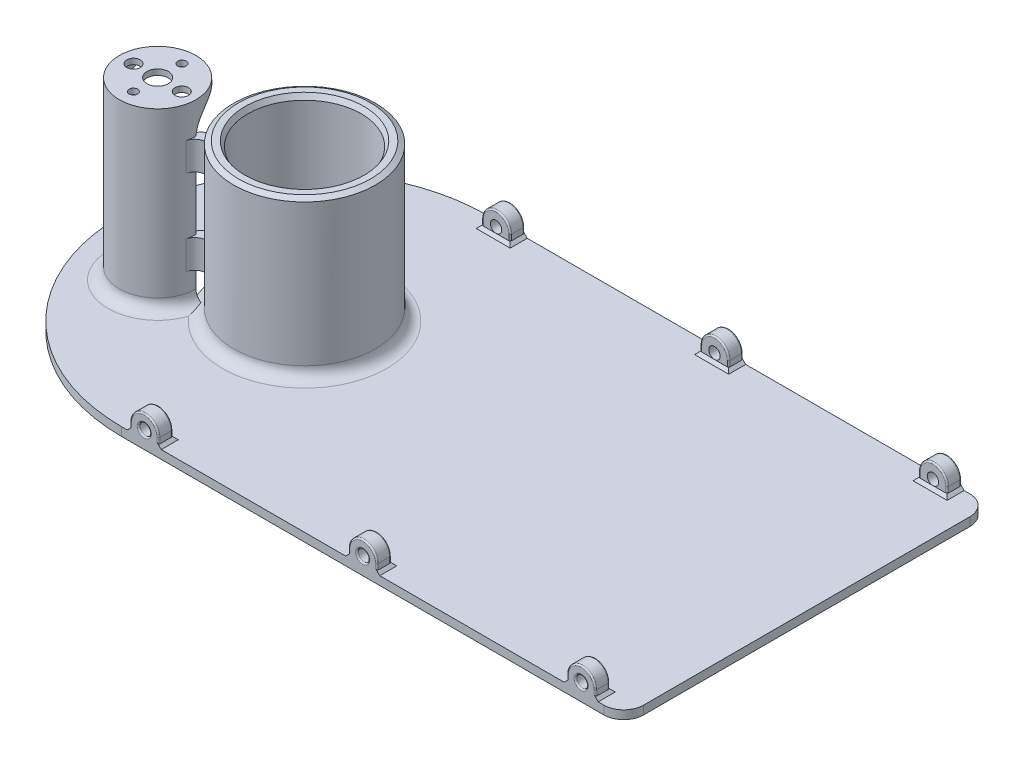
ISO-10303-21;
HEADER;
FILE_DESCRIPTION(('STEP AP214'),'2;1');
FILE_NAME('part.step','',(''),(''),'','','');
FILE_SCHEMA(('AUTOMOTIVE_DESIGN { 1 0 10303 214 1 1 1 1 }'));
ENDSEC;
DATA;
#1=APPLICATION_CONTEXT('core data for automotive mechanical design processes');
#2=APPLICATION_PROTOCOL_DEFINITION('international standard','automotive_design',2000,#1);
#3=PRODUCT_CONTEXT('',#1,'mechanical');
#4=PRODUCT('Part','Part','',(#3));
#5=PRODUCT_RELATED_PRODUCT_CATEGORY('part','',(#4));
#6=PRODUCT_DEFINITION_FORMATION('','',#4);
#7=PRODUCT_DEFINITION_CONTEXT('part definition',#1,'design');
#8=PRODUCT_DEFINITION('design','',#6,#7);
#9=PRODUCT_DEFINITION_SHAPE('','',#8);
#10=(LENGTH_UNIT() NAMED_UNIT(*) SI_UNIT(.MILLI.,.METRE.));
#11=(NAMED_UNIT(*) PLANE_ANGLE_UNIT() SI_UNIT($,.RADIAN.));
#12=(NAMED_UNIT(*) SI_UNIT($,.STERADIAN.) SOLID_ANGLE_UNIT());
#13=UNCERTAINTY_MEASURE_WITH_UNIT(LENGTH_MEASURE(1.E-05),#10,'distance_accuracy_value','');
#14=(GEOMETRIC_REPRESENTATION_CONTEXT(3) GLOBAL_UNCERTAINTY_ASSIGNED_CONTEXT((#13)) GLOBAL_UNIT_ASSIGNED_CONTEXT((#10,
#11,#12)) REPRESENTATION_CONTEXT('',''));
#15=CARTESIAN_POINT('',(0.,0.,0.));
#16=DIRECTION('',(0.,0.,1.));
#17=DIRECTION('',(1.,0.,0.));
#18=AXIS2_PLACEMENT_3D('',#15,#16,#17);
#19=CARTESIAN_POINT('',(0.,0.,0.));
#20=DIRECTION('',(0.,-1.,0.));
#21=DIRECTION('',(0.,0.,-1.));
#22=AXIS2_PLACEMENT_3D('',#19,#20,#21);
#23=PLANE('',#22);
#24=CARTESIAN_POINT('',(0.,0.,0.));
#25=DIRECTION('',(0.,-1.,0.));
#26=DIRECTION('',(0.,0.,-1.));
#27=AXIS2_PLACEMENT_3D('',#24,#25,#26);
#28=CIRCLE('',#27,29.);
#29=CARTESIAN_POINT('',(-25.7564446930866,0.,13.3268734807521));
#30=VERTEX_POINT('',#29);
#31=CARTESIAN_POINT('',(-26.2466093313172,0.,12.3335112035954));
#32=VERTEX_POINT('',#31);
#33=EDGE_CURVE('E3650',#30,#32,#28,.T.);
#34=ORIENTED_EDGE('',*,*,#33,.T.);
#35=CARTESIAN_POINT('',(-38.4562666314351,0.,13.3268734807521));
#36=DIRECTION('',(0.,1.,0.));
#37=DIRECTION('',(0.,0.,1.));
#38=AXIS2_PLACEMENT_3D('',#35,#36,#37);
#39=CIRCLE('',#38,12.25);
#40=CARTESIAN_POINT('',(-26.2062666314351,0.,13.3268734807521));
#41=VERTEX_POINT('',#40);
#42=EDGE_CURVE('E72',#41,#32,#39,.T.);
#43=ORIENTED_EDGE('',*,*,#42,.F.);
#44=DIRECTION('',(-1.,0.,0.));
#45=VECTOR('',#44,1.);
#46=CARTESIAN_POINT('',(-26.2062666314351,0.,13.3268734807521));
#47=LINE('',#46,#45);
#48=EDGE_CURVE('E851',#30,#41,#47,.T.);
#49=ORIENTED_EDGE('',*,*,#48,.F.);
#50=EDGE_LOOP('',(#34,#43,#49));
#51=FACE_BOUND('',#50,.T.);
#52=ADVANCED_FACE('F47',(#51),#23,.F.);
#53=CARTESIAN_POINT('',(0.,55.,0.));
#54=DIRECTION('',(0.,-1.,0.));
#55=DIRECTION('',(0.,0.,-1.));
#56=AXIS2_PLACEMENT_3D('',#53,#54,#55);
#57=CYLINDRICAL_SURFACE('',#56,25.);
#58=DIRECTION('',(0.,-1.,0.));
#59=VECTOR('',#58,1.);
#60=CARTESIAN_POINT('',(-21.1517007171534,55.,13.3268734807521));
#61=LINE('',#60,#59);
#62=CARTESIAN_POINT('',(-21.1517007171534,20.6218018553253,13.3268734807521));
#63=VERTEX_POINT('',#62);
#64=CARTESIAN_POINT('',(-21.1517007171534,10.6218018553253,13.3268734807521));
#65=VERTEX_POINT('',#64);
#66=EDGE_CURVE('E744',#63,#65,#61,.T.);
#67=ORIENTED_EDGE('',*,*,#66,.T.);
#68=CARTESIAN_POINT('',(0.,10.6218018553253,0.));
#69=DIRECTION('',(0.,1.,0.));
#70=DIRECTION('',(0.,0.,1.));
#71=AXIS2_PLACEMENT_3D('',#68,#69,#70);
#72=CIRCLE('',#71,25.);
#73=CARTESIAN_POINT('',(-22.7674259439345,10.6218018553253,10.3268734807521));
#74=VERTEX_POINT('',#73);
#75=EDGE_CURVE('E748',#65,#74,#72,.F.);
#76=ORIENTED_EDGE('',*,*,#75,.T.);
#77=DIRECTION('',(0.,-1.,0.));
#78=VECTOR('',#77,1.);
#79=CARTESIAN_POINT('',(-22.7674259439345,55.,10.3268734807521));
#80=LINE('',#79,#78);
#81=CARTESIAN_POINT('',(-22.7674259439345,20.6218018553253,10.3268734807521));
#82=VERTEX_POINT('',#81);
#83=EDGE_CURVE('E752',#74,#82,#80,.F.);
#84=ORIENTED_EDGE('',*,*,#83,.T.);
#85=CARTESIAN_POINT('',(0.,20.6218018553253,0.));
#86=DIRECTION('',(0.,-1.,0.));
#87=DIRECTION('',(0.,0.,-1.));
#88=AXIS2_PLACEMENT_3D('',#85,#86,#87);
#89=CIRCLE('',#88,25.);
#90=EDGE_CURVE('E719',#82,#63,#89,.F.);
#91=ORIENTED_EDGE('',*,*,#90,.T.);
#92=EDGE_LOOP('',(#67,#76,#84,#91));
#93=FACE_BOUND('',#92,.T.);
#94=CARTESIAN_POINT('',(0.,4.,0.));
#95=DIRECTION('',(0.,-1.,0.));
#96=DIRECTION('',(0.,0.,-1.));
#97=AXIS2_PLACEMENT_3D('',#94,#95,#96);
#98=CIRCLE('',#97,25.);
#99=CARTESIAN_POINT('',(0.,4.,-25.));
#100=VERTEX_POINT('',#99);
#101=EDGE_CURVE('E1671',#100,#100,#98,.F.);
#102=ORIENTED_EDGE('',*,*,#101,.T.);
#103=EDGE_LOOP('',(#102));
#104=FACE_BOUND('',#103,.T.);
#105=CARTESIAN_POINT('',(0.,54.,0.));
#106=DIRECTION('',(0.,1.,0.));
#107=DIRECTION('',(0.,0.,1.));
#108=AXIS2_PLACEMENT_3D('',#105,#106,#107);
#109=CIRCLE('',#108,25.);
#110=CARTESIAN_POINT('',(0.,54.,25.));
#111=VERTEX_POINT('',#110);
#112=EDGE_CURVE('E998',#111,#111,#109,.F.);
#113=ORIENTED_EDGE('',*,*,#112,.T.);
#114=EDGE_LOOP('',(#113));
#115=FACE_BOUND('',#114,.T.);
#116=DIRECTION('',(0.,-1.,0.));
#117=VECTOR('',#116,1.);
#118=CARTESIAN_POINT('',(-21.1517007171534,55.,13.3268734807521));
#119=LINE('',#118,#117);
#120=CARTESIAN_POINT('',(-21.1517007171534,50.6218018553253,13.3268734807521));
#121=VERTEX_POINT('',#120);
#122=CARTESIAN_POINT('',(-21.1517007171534,40.6218018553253,13.3268734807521));
#123=VERTEX_POINT('',#122);
#124=EDGE_CURVE('E724',#121,#123,#119,.T.);
#125=ORIENTED_EDGE('',*,*,#124,.T.);
#126=CARTESIAN_POINT('',(0.,40.6218018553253,0.));
#127=DIRECTION('',(0.,1.,0.));
#128=DIRECTION('',(0.,0.,1.));
#129=AXIS2_PLACEMENT_3D('',#126,#127,#128);
#130=CIRCLE('',#129,25.);
#131=CARTESIAN_POINT('',(-22.7674259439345,40.6218018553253,10.3268734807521));
#132=VERTEX_POINT('',#131);
#133=EDGE_CURVE('E738',#123,#132,#130,.F.);
#134=ORIENTED_EDGE('',*,*,#133,.T.);
#135=DIRECTION('',(0.,-1.,0.));
#136=VECTOR('',#135,1.);
#137=CARTESIAN_POINT('',(-22.7674259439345,55.,10.3268734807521));
#138=LINE('',#137,#136);
#139=CARTESIAN_POINT('',(-22.7674259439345,50.6218018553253,10.3268734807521));
#140=VERTEX_POINT('',#139);
#141=EDGE_CURVE('E734',#132,#140,#138,.F.);
#142=ORIENTED_EDGE('',*,*,#141,.T.);
#143=CARTESIAN_POINT('',(0.,50.6218018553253,0.));
#144=DIRECTION('',(0.,-1.,0.));
#145=DIRECTION('',(0.,0.,-1.));
#146=AXIS2_PLACEMENT_3D('',#143,#144,#145);
#147=CIRCLE('',#146,25.);
#148=EDGE_CURVE('E730',#140,#121,#147,.F.);
#149=ORIENTED_EDGE('',*,*,#148,.T.);
#150=EDGE_LOOP('',(#125,#134,#142,#149));
#151=FACE_BOUND('',#150,.T.);
#152=ADVANCED_FACE('F1929',(#93,#104,#115,#151),#57,.T.);
#153=CARTESIAN_POINT('',(-26.2062666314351,40.,13.3268734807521));
#154=DIRECTION('',(0.,0.,1.));
#155=DIRECTION('',(1.,0.,0.));
#156=AXIS2_PLACEMENT_3D('',#153,#154,#155);
#157=PLANE('',#156);
#158=DIRECTION('',(-1.,0.,0.));
#159=VECTOR('',#158,1.);
#160=CARTESIAN_POINT('',(-24.9562666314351,40.6218018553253,13.3268734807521));
#161=LINE('',#160,#159);
#162=CARTESIAN_POINT('',(-24.9562666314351,40.6218018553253,13.3268734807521));
#163=VERTEX_POINT('',#162);
#164=CARTESIAN_POINT('',(-26.2062666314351,40.6218018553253,13.3268734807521));
#165=VERTEX_POINT('',#164);
#166=EDGE_CURVE('E773',#163,#165,#161,.T.);
#167=ORIENTED_EDGE('',*,*,#166,.F.);
#168=DIRECTION('',(0.,-1.,0.));
#169=VECTOR('',#168,1.);
#170=CARTESIAN_POINT('',(-24.9562666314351,40.,13.3268734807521));
#171=LINE('',#170,#169);
#172=CARTESIAN_POINT('',(-24.9562666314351,20.6218018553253,13.3268734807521));
#173=VERTEX_POINT('',#172);
#174=EDGE_CURVE('E872',#163,#173,#171,.T.);
#175=ORIENTED_EDGE('',*,*,#174,.T.);
#176=DIRECTION('',(1.,0.,0.));
#177=VECTOR('',#176,1.);
#178=CARTESIAN_POINT('',(-24.9562666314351,20.6218018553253,13.3268734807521));
#179=LINE('',#178,#177);
#180=CARTESIAN_POINT('',(-26.2062666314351,20.6218018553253,13.3268734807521));
#181=VERTEX_POINT('',#180);
#182=EDGE_CURVE('E784',#181,#173,#179,.T.);
#183=ORIENTED_EDGE('',*,*,#182,.F.);
#184=DIRECTION('',(0.,-1.,0.));
#185=VECTOR('',#184,1.);
#186=CARTESIAN_POINT('',(-26.2062666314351,40.,13.3268734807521));
#187=LINE('',#186,#185);
#188=EDGE_CURVE('E868',#165,#181,#187,.T.);
#189=ORIENTED_EDGE('',*,*,#188,.F.);
#190=EDGE_LOOP('',(#167,#175,#183,#189));
#191=FACE_BOUND('',#190,.T.);
#192=ADVANCED_FACE('F1937',(#191),#157,.F.);
#193=DIRECTION('',(-1.,0.,0.));
#194=VECTOR('',#193,1.);
#195=CARTESIAN_POINT('',(-24.9562666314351,10.6218018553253,13.3268734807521));
#196=LINE('',#195,#194);
#197=CARTESIAN_POINT('',(-24.9562666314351,10.6218018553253,13.3268734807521));
#198=VERTEX_POINT('',#197);
#199=CARTESIAN_POINT('',(-26.2062666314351,10.6218018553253,13.3268734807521));
#200=VERTEX_POINT('',#199);
#201=EDGE_CURVE('E777',#198,#200,#196,.T.);
#202=ORIENTED_EDGE('',*,*,#201,.F.);
#203=CARTESIAN_POINT('',(-24.9562666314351,4.,13.3268734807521));
#204=VERTEX_POINT('',#203);
#205=EDGE_CURVE('E869',#198,#204,#171,.T.);
#206=ORIENTED_EDGE('',*,*,#205,.T.);
#207=CARTESIAN_POINT('',(-20.9562666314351,4.,13.3268734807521));
#208=DIRECTION('',(0.,0.,1.));
#209=DIRECTION('',(1.,0.,0.));
#210=AXIS2_PLACEMENT_3D('',#207,#208,#209);
#211=CIRCLE('',#210,4.);
#212=CARTESIAN_POINT('',(-23.2005229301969,0.688910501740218,13.3268734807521));
#213=VERTEX_POINT('',#212);
#214=EDGE_CURVE('E1791',#204,#213,#211,.T.);
#215=ORIENTED_EDGE('',*,*,#214,.T.);
#216=CARTESIAN_POINT('',(-23.2005229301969,0.688910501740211,13.3268734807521));
#217=CARTESIAN_POINT('',(-23.4744174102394,0.527972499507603,13.3268734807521));
#218=CARTESIAN_POINT('',(-23.763855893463,0.394357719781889,13.3268734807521));
#219=CARTESIAN_POINT('',(-24.3532711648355,0.186940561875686,13.3268734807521));
#220=CARTESIAN_POINT('',(-24.6526334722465,0.111395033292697,13.3268734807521));
#221=CARTESIAN_POINT('',(-25.2308192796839,0.0196378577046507,13.3268734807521));
#222=CARTESIAN_POINT('',(-25.50886387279,-0.00156353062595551,13.3268734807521));
#223=CARTESIAN_POINT('',(-26.0727903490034,0.00179323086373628,13.3268734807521));
#224=CARTESIAN_POINT('',(-26.3586637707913,0.0277069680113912,13.3268734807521));
#225=CARTESIAN_POINT('',(-26.6404233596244,0.0783616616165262,13.3268734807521));
#226=B_SPLINE_CURVE_WITH_KNOTS('',3,(#216,#217,#218,#219,#220,#221,#222,#223,#224,#225),
.UNSPECIFIED.,.F.,.F.,(4,2,2,2,4),(0.,0.950913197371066,1.87202725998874,2.70492148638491,
3.56215982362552),.UNSPECIFIED.);
#227=CARTESIAN_POINT('',(-24.9562666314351,0.0632089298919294,13.3268734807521));
#228=VERTEX_POINT('',#227);
#229=EDGE_CURVE('E1782',#213,#228,#226,.T.);
#230=ORIENTED_EDGE('',*,*,#229,.T.);
#231=CARTESIAN_POINT('',(-23.2005229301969,0.688910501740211,13.3268734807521));
#232=CARTESIAN_POINT('',(-23.4744174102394,0.527972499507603,13.3268734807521));
#233=CARTESIAN_POINT('',(-23.763855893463,0.394357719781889,13.3268734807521));
#234=CARTESIAN_POINT('',(-24.3532711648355,0.186940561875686,13.3268734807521));
#235=CARTESIAN_POINT('',(-24.6526334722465,0.111395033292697,13.3268734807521));
#236=CARTESIAN_POINT('',(-25.2308192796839,0.0196378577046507,13.3268734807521));
#237=CARTESIAN_POINT('',(-25.50886387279,-0.00156353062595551,13.3268734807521));
#238=CARTESIAN_POINT('',(-26.0727903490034,0.00179323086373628,13.3268734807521));
#239=CARTESIAN_POINT('',(-26.3586637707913,0.0277069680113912,13.3268734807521));
#240=CARTESIAN_POINT('',(-26.6404233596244,0.0783616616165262,13.3268734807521));
#241=B_SPLINE_CURVE_WITH_KNOTS('',3,(#231,#232,#233,#234,#235,#236,#237,#238,#239,#240),
.UNSPECIFIED.,.F.,.F.,(4,2,2,2,4),(0.,0.950913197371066,1.87202725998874,2.70492148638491,
3.56215982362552),.UNSPECIFIED.);
#242=EDGE_CURVE('E1758',#228,#30,#241,.T.);
#243=ORIENTED_EDGE('',*,*,#242,.T.);
#244=ORIENTED_EDGE('',*,*,#48,.T.);
#245=EDGE_CURVE('E865',#200,#41,#187,.T.);
#246=ORIENTED_EDGE('',*,*,#245,.F.);
#247=EDGE_LOOP('',(#202,#206,#215,#230,#243,#244,#246));
#248=FACE_BOUND('',#247,.T.);
#249=ADVANCED_FACE('F1945',(#248),#157,.F.);
#250=DIRECTION('',(-1.,0.,0.));
#251=VECTOR('',#250,1.);
#252=CARTESIAN_POINT('',(0.,0.,-58.5));
#253=LINE('',#252,#251);
#254=CARTESIAN_POINT('',(14.,0.,-58.5));
#255=VERTEX_POINT('',#254);
#256=CARTESIAN_POINT('',(2.00000000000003,0.,-58.5));
#257=VERTEX_POINT('',#256);
#258=EDGE_CURVE('E1086',#255,#257,#253,.T.);
#259=ORIENTED_EDGE('',*,*,#258,.T.);
#260=DIRECTION('',(0.,0.,-1.));
#261=VECTOR('',#260,1.);
#262=CARTESIAN_POINT('',(2.00000000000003,0.,0.));
#263=LINE('',#262,#261);
#264=CARTESIAN_POINT('',(2.00000000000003,0.,-64.5));
#265=VERTEX_POINT('',#264);
#266=EDGE_CURVE('E1089',#257,#265,#263,.T.);
#267=ORIENTED_EDGE('',*,*,#266,.T.);
#268=DIRECTION('',(1.,0.,0.));
#269=VECTOR('',#268,1.);
#270=CARTESIAN_POINT('',(0.,0.,-64.5));
#271=LINE('',#270,#269);
#272=CARTESIAN_POINT('',(0.,0.,-64.5));
#273=VERTEX_POINT('',#272);
#274=EDGE_CURVE('E972',#273,#265,#271,.T.);
#275=ORIENTED_EDGE('',*,*,#274,.F.);
#276=CARTESIAN_POINT('',(0.,0.,0.));
#277=DIRECTION('',(0.,-1.,0.));
#278=DIRECTION('',(0.,0.,-1.));
#279=AXIS2_PLACEMENT_3D('',#276,#277,#278);
#280=CIRCLE('',#279,64.5);
#281=CARTESIAN_POINT('',(0.,0.,64.5));
#282=VERTEX_POINT('',#281);
#283=EDGE_CURVE('E950',#282,#273,#280,.T.);
#284=ORIENTED_EDGE('',*,*,#283,.F.);
#285=DIRECTION('',(-1.,0.,0.));
#286=VECTOR('',#285,1.);
#287=CARTESIAN_POINT('',(0.,0.,64.5));
#288=LINE('',#287,#286);
#289=CARTESIAN_POINT('',(1.99999999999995,0.,64.5));
#290=VERTEX_POINT('',#289);
#291=EDGE_CURVE('E982',#290,#282,#288,.T.);
#292=ORIENTED_EDGE('',*,*,#291,.F.);
#293=DIRECTION('',(0.,0.,-1.));
#294=VECTOR('',#293,1.);
#295=CARTESIAN_POINT('',(1.99999999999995,0.,0.));
#296=LINE('',#295,#294);
#297=CARTESIAN_POINT('',(1.99999999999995,0.,58.5));
#298=VERTEX_POINT('',#297);
#299=EDGE_CURVE('E1061',#290,#298,#296,.T.);
#300=ORIENTED_EDGE('',*,*,#299,.T.);
#301=DIRECTION('',(1.,0.,0.));
#302=VECTOR('',#301,1.);
#303=CARTESIAN_POINT('',(0.,0.,58.5));
#304=LINE('',#303,#302);
#305=CARTESIAN_POINT('',(14.,0.,58.5));
#306=VERTEX_POINT('',#305);
#307=EDGE_CURVE('E1058',#298,#306,#304,.T.);
#308=ORIENTED_EDGE('',*,*,#307,.T.);
#309=DIRECTION('',(0.,0.,1.));
#310=VECTOR('',#309,1.);
#311=CARTESIAN_POINT('',(14.,0.,0.));
#312=LINE('',#311,#310);
#313=CARTESIAN_POINT('',(14.,0.,64.5));
#314=VERTEX_POINT('',#313);
#315=EDGE_CURVE('E1055',#306,#314,#312,.T.);
#316=ORIENTED_EDGE('',*,*,#315,.T.);
#317=CARTESIAN_POINT('',(79.,0.,64.5));
#318=VERTEX_POINT('',#317);
#319=EDGE_CURVE('E1990',#318,#314,#288,.T.);
#320=ORIENTED_EDGE('',*,*,#319,.F.);
#321=DIRECTION('',(0.,0.,-1.));
#322=VECTOR('',#321,1.);
#323=CARTESIAN_POINT('',(79.,0.,0.));
#324=LINE('',#323,#322);
#325=CARTESIAN_POINT('',(79.,0.,58.5));
#326=VERTEX_POINT('',#325);
#327=EDGE_CURVE('E1052',#318,#326,#324,.T.);
#328=ORIENTED_EDGE('',*,*,#327,.T.);
#329=DIRECTION('',(1.,0.,0.));
#330=VECTOR('',#329,1.);
#331=CARTESIAN_POINT('',(0.,0.,58.5));
#332=LINE('',#331,#330);
#333=CARTESIAN_POINT('',(91.,0.,58.5));
#334=VERTEX_POINT('',#333);
#335=EDGE_CURVE('E1049',#326,#334,#332,.T.);
#336=ORIENTED_EDGE('',*,*,#335,.T.);
#337=DIRECTION('',(0.,0.,1.));
#338=VECTOR('',#337,1.);
#339=CARTESIAN_POINT('',(91.,0.,0.));
#340=LINE('',#339,#338);
#341=CARTESIAN_POINT('',(91.,0.,64.5));
#342=VERTEX_POINT('',#341);
#343=EDGE_CURVE('E1046',#334,#342,#340,.T.);
#344=ORIENTED_EDGE('',*,*,#343,.T.);
#345=CARTESIAN_POINT('',(156.,0.,64.5));
#346=VERTEX_POINT('',#345);
#347=EDGE_CURVE('E986',#346,#342,#288,.T.);
#348=ORIENTED_EDGE('',*,*,#347,.F.);
#349=DIRECTION('',(0.,0.,-1.));
#350=VECTOR('',#349,1.);
#351=CARTESIAN_POINT('',(156.,0.,0.));
#352=LINE('',#351,#350);
#353=CARTESIAN_POINT('',(156.,0.,58.5));
#354=VERTEX_POINT('',#353);
#355=EDGE_CURVE('E1043',#346,#354,#352,.T.);
#356=ORIENTED_EDGE('',*,*,#355,.T.);
#357=DIRECTION('',(1.,0.,0.));
#358=VECTOR('',#357,1.);
#359=CARTESIAN_POINT('',(0.,0.,58.5));
#360=LINE('',#359,#358);
#361=CARTESIAN_POINT('',(168.,0.,58.5));
#362=VERTEX_POINT('',#361);
#363=EDGE_CURVE('E1040',#354,#362,#360,.T.);
#364=ORIENTED_EDGE('',*,*,#363,.T.);
#365=DIRECTION('',(0.,0.,1.));
#366=VECTOR('',#365,1.);
#367=CARTESIAN_POINT('',(168.,0.,0.));
#368=LINE('',#367,#366);
#369=CARTESIAN_POINT('',(168.,0.,64.5));
#370=VERTEX_POINT('',#369);
#371=EDGE_CURVE('E1037',#362,#370,#368,.T.);
#372=ORIENTED_EDGE('',*,*,#371,.T.);
#373=CARTESIAN_POINT('',(170.,0.,64.5));
#374=VERTEX_POINT('',#373);
#375=EDGE_CURVE('E956',#374,#370,#288,.T.);
#376=ORIENTED_EDGE('',*,*,#375,.F.);
#377=CARTESIAN_POINT('',(170.,0.,57.5));
#378=DIRECTION('',(0.,-1.,0.));
#379=DIRECTION('',(0.,0.,-1.));
#380=AXIS2_PLACEMENT_3D('',#377,#378,#379);
#381=CIRCLE('',#380,7.);
#382=CARTESIAN_POINT('',(177.,0.,57.5));
#383=VERTEX_POINT('',#382);
#384=EDGE_CURVE('E1017',#374,#383,#381,.F.);
#385=ORIENTED_EDGE('',*,*,#384,.T.);
#386=DIRECTION('',(0.,0.,1.));
#387=VECTOR('',#386,1.);
#388=CARTESIAN_POINT('',(177.,0.,64.5));
#389=LINE('',#388,#387);
#390=CARTESIAN_POINT('',(177.,0.,-57.5));
#391=VERTEX_POINT('',#390);
#392=EDGE_CURVE('E976',#391,#383,#389,.T.);
#393=ORIENTED_EDGE('',*,*,#392,.F.);
#394=CARTESIAN_POINT('',(170.,0.,-57.5));
#395=DIRECTION('',(0.,-1.,0.));
#396=DIRECTION('',(0.,0.,-1.));
#397=AXIS2_PLACEMENT_3D('',#394,#395,#396);
#398=CIRCLE('',#397,7.);
#399=CARTESIAN_POINT('',(170.,0.,-64.5));
#400=VERTEX_POINT('',#399);
#401=EDGE_CURVE('E1020',#391,#400,#398,.F.);
#402=ORIENTED_EDGE('',*,*,#401,.T.);
#403=CARTESIAN_POINT('',(168.,0.,-64.5));
#404=VERTEX_POINT('',#403);
#405=EDGE_CURVE('E971',#404,#400,#271,.T.);
#406=ORIENTED_EDGE('',*,*,#405,.F.);
#407=DIRECTION('',(0.,0.,1.));
#408=VECTOR('',#407,1.);
#409=CARTESIAN_POINT('',(168.,0.,0.));
#410=LINE('',#409,#408);
#411=CARTESIAN_POINT('',(168.,0.,-58.5));
#412=VERTEX_POINT('',#411);
#413=EDGE_CURVE('E1064',#404,#412,#410,.T.);
#414=ORIENTED_EDGE('',*,*,#413,.T.);
#415=DIRECTION('',(-1.,0.,0.));
#416=VECTOR('',#415,1.);
#417=CARTESIAN_POINT('',(0.,0.,-58.5));
#418=LINE('',#417,#416);
#419=CARTESIAN_POINT('',(156.,0.,-58.5));
#420=VERTEX_POINT('',#419);
#421=EDGE_CURVE('E1067',#412,#420,#418,.T.);
#422=ORIENTED_EDGE('',*,*,#421,.T.);
#423=DIRECTION('',(0.,0.,-1.));
#424=VECTOR('',#423,1.);
#425=CARTESIAN_POINT('',(156.,0.,0.));
#426=LINE('',#425,#424);
#427=CARTESIAN_POINT('',(156.,0.,-64.5));
#428=VERTEX_POINT('',#427);
#429=EDGE_CURVE('E1070',#420,#428,#426,.T.);
#430=ORIENTED_EDGE('',*,*,#429,.T.);
#431=CARTESIAN_POINT('',(91.0000000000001,0.,-64.5));
#432=VERTEX_POINT('',#431);
#433=EDGE_CURVE('E978',#432,#428,#271,.T.);
#434=ORIENTED_EDGE('',*,*,#433,.F.);
#435=DIRECTION('',(0.,0.,1.));
#436=VECTOR('',#435,1.);
#437=CARTESIAN_POINT('',(91.0000000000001,0.,0.));
#438=LINE('',#437,#436);
#439=CARTESIAN_POINT('',(91.0000000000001,0.,-58.5));
#440=VERTEX_POINT('',#439);
#441=EDGE_CURVE('E1080',#432,#440,#438,.T.);
#442=ORIENTED_EDGE('',*,*,#441,.T.);
#443=DIRECTION('',(-1.,0.,0.));
#444=VECTOR('',#443,1.);
#445=CARTESIAN_POINT('',(0.,0.,-58.5));
#446=LINE('',#445,#444);
#447=CARTESIAN_POINT('',(78.9999999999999,0.,-58.5));
#448=VERTEX_POINT('',#447);
#449=EDGE_CURVE('E1077',#440,#448,#446,.T.);
#450=ORIENTED_EDGE('',*,*,#449,.T.);
#451=DIRECTION('',(0.,0.,-1.));
#452=VECTOR('',#451,1.);
#453=CARTESIAN_POINT('',(78.9999999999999,0.,0.));
#454=LINE('',#453,#452);
#455=CARTESIAN_POINT('',(78.9999999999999,0.,-64.5));
#456=VERTEX_POINT('',#455);
#457=EDGE_CURVE('E1074',#448,#456,#454,.T.);
#458=ORIENTED_EDGE('',*,*,#457,.T.);
#459=CARTESIAN_POINT('',(14.,0.,-64.5));
#460=VERTEX_POINT('',#459);
#461=EDGE_CURVE('E977',#460,#456,#271,.T.);
#462=ORIENTED_EDGE('',*,*,#461,.F.);
#463=DIRECTION('',(0.,0.,1.));
#464=VECTOR('',#463,1.);
#465=CARTESIAN_POINT('',(14.,0.,0.));
#466=LINE('',#465,#464);
#467=EDGE_CURVE('E1083',#460,#255,#466,.T.);
#468=ORIENTED_EDGE('',*,*,#467,.T.);
#469=EDGE_LOOP('',(#259,#267,#275,#284,#292,#300,#308,#316,#320,#328,#336,#344,#348,#356,#364,
#372,#376,#385,#393,#402,#406,#414,#422,#430,#434,#442,#450,#458,#462,#468));
#470=FACE_BOUND('',#469,.T.);
#471=DIRECTION('',(-1.,0.,0.));
#472=VECTOR('',#471,1.);
#473=CARTESIAN_POINT('',(-30.9785791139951,0.,-5.01809827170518));
#474=LINE('',#473,#472);
#475=CARTESIAN_POINT('',(-30.9785791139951,0.,-5.01809827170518));
#476=VERTEX_POINT('',#475);
#477=CARTESIAN_POINT('',(-45.9122595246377,0.,-5.01809827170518));
#478=VERTEX_POINT('',#477);
#479=EDGE_CURVE('E680',#476,#478,#474,.T.);
#480=ORIENTED_EDGE('',*,*,#479,.F.);
#481=DIRECTION('',(0.,0.,-1.));
#482=VECTOR('',#481,1.);
#483=CARTESIAN_POINT('',(-30.9785791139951,0.,3.62395178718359));
#484=LINE('',#483,#482);
#485=CARTESIAN_POINT('',(-30.9785791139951,0.,3.62395178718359));
#486=VERTEX_POINT('',#485);
#487=EDGE_CURVE('E688',#486,#476,#484,.T.);
#488=ORIENTED_EDGE('',*,*,#487,.F.);
#489=CARTESIAN_POINT('',(-28.2501264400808,0.,6.55212607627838));
#490=VERTEX_POINT('',#489);
#491=EDGE_CURVE('E3237',#490,#486,#39,.T.);
#492=ORIENTED_EDGE('',*,*,#491,.F.);
#493=CARTESIAN_POINT('',(-21.9034815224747,0.,19.0062488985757));
#494=VERTEX_POINT('',#493);
#495=EDGE_CURVE('E3631',#490,#494,#28,.T.);
#496=ORIENTED_EDGE('',*,*,#495,.T.);
#497=CARTESIAN_POINT('',(-38.4562666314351,0.,13.3268734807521));
#498=DIRECTION('',(0.,-1.,0.));
#499=DIRECTION('',(0.,0.,-1.));
#500=AXIS2_PLACEMENT_3D('',#497,#498,#499);
#501=CIRCLE('',#500,17.5);
#502=CARTESIAN_POINT('',(-55.9562666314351,0.,13.3268734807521));
#503=VERTEX_POINT('',#502);
#504=EDGE_CURVE('E1767',#494,#503,#501,.T.);
#505=ORIENTED_EDGE('',*,*,#504,.T.);
#506=DIRECTION('',(-1.,0.,0.));
#507=VECTOR('',#506,1.);
#508=CARTESIAN_POINT('',(-51.9562666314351,0.,13.3268734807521));
#509=LINE('',#508,#507);
#510=CARTESIAN_POINT('',(-50.7062666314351,0.,13.3268734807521));
#511=VERTEX_POINT('',#510);
#512=EDGE_CURVE('E855',#511,#503,#509,.T.);
#513=ORIENTED_EDGE('',*,*,#512,.F.);
#514=CARTESIAN_POINT('',(-45.9122595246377,0.,3.60727112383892));
#515=VERTEX_POINT('',#514);
#516=EDGE_CURVE('E711',#515,#511,#39,.T.);
#517=ORIENTED_EDGE('',*,*,#516,.F.);
#518=DIRECTION('',(0.,0.,1.));
#519=VECTOR('',#518,1.);
#520=CARTESIAN_POINT('',(-45.9122595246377,0.,3.62395178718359));
#521=LINE('',#520,#519);
#522=EDGE_CURVE('E64',#478,#515,#521,.T.);
#523=ORIENTED_EDGE('',*,*,#522,.F.);
#524=EDGE_LOOP('',(#480,#488,#492,#496,#505,#513,#517,#523));
#525=FACE_BOUND('',#524,.T.);
#526=ADVANCED_FACE('F696',(#470,#525),#23,.F.);
#527=CARTESIAN_POINT('',(0.,55.,0.));
#528=DIRECTION('',(0.,1.,0.));
#529=DIRECTION('',(0.,0.,1.));
#530=AXIS2_PLACEMENT_3D('',#527,#528,#529);
#531=PLANE('',#530);
#532=CARTESIAN_POINT('',(0.,55.,0.));
#533=DIRECTION('',(0.,1.,0.));
#534=DIRECTION('',(0.,0.,1.));
#535=AXIS2_PLACEMENT_3D('',#532,#533,#534);
#536=CIRCLE('',#535,21.);
#537=CARTESIAN_POINT('',(0.,55.,21.));
#538=VERTEX_POINT('',#537);
#539=EDGE_CURVE('E1006',#538,#538,#536,.F.);
#540=ORIENTED_EDGE('',*,*,#539,.T.);
#541=EDGE_LOOP('',(#540));
#542=FACE_BOUND('',#541,.T.);
#543=CARTESIAN_POINT('',(0.,55.,0.));
#544=DIRECTION('',(0.,1.,0.));
#545=DIRECTION('',(0.,0.,1.));
#546=AXIS2_PLACEMENT_3D('',#543,#544,#545);
#547=CIRCLE('',#546,23.2679491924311);
#548=CARTESIAN_POINT('',(0.,55.,23.2679491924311));
#549=VERTEX_POINT('',#548);
#550=EDGE_CURVE('E994',#549,#549,#547,.T.);
#551=ORIENTED_EDGE('',*,*,#550,.T.);
#552=EDGE_LOOP('',(#551));
#553=FACE_BOUND('',#552,.T.);
#554=ADVANCED_FACE('F1944',(#542,#553),#531,.T.);
#555=CARTESIAN_POINT('',(0.,55.,0.));
#556=DIRECTION('',(0.,-1.,0.));
#557=DIRECTION('',(0.,0.,-1.));
#558=AXIS2_PLACEMENT_3D('',#555,#556,#557);
#559=CYLINDRICAL_SURFACE('',#558,20.);
#560=CARTESIAN_POINT('',(0.,53.2679491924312,0.));
#561=DIRECTION('',(0.,1.,0.));
#562=DIRECTION('',(0.,0.,1.));
#563=AXIS2_PLACEMENT_3D('',#560,#561,#562);
#564=CIRCLE('',#563,20.);
#565=CARTESIAN_POINT('',(0.,53.2679491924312,20.));
#566=VERTEX_POINT('',#565);
#567=EDGE_CURVE('E1002',#566,#566,#564,.T.);
#568=ORIENTED_EDGE('',*,*,#567,.T.);
#569=EDGE_LOOP('',(#568));
#570=FACE_BOUND('',#569,.T.);
#571=CARTESIAN_POINT('',(0.,-3.,0.));
#572=DIRECTION('',(0.,-1.,0.));
#573=DIRECTION('',(0.,0.,-1.));
#574=AXIS2_PLACEMENT_3D('',#571,#572,#573);
#575=CIRCLE('',#574,20.);
#576=CARTESIAN_POINT('',(0.,-3.,-20.));
#577=VERTEX_POINT('',#576);
#578=EDGE_CURVE('E921',#577,#577,#575,.T.);
#579=ORIENTED_EDGE('',*,*,#578,.T.);
#580=EDGE_LOOP('',(#579));
#581=FACE_BOUND('',#580,.T.);
#582=ADVANCED_FACE('F1952',(#570,#581),#559,.F.);
#583=CARTESIAN_POINT('',(0.,55.,0.));
#584=DIRECTION('',(0.,-1.,0.));
#585=DIRECTION('',(0.,0.,-1.));
#586=AXIS2_PLACEMENT_3D('',#583,#584,#585);
#587=CONICAL_SURFACE('',#586,23.2679491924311,1.0471975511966);
#588=ORIENTED_EDGE('',*,*,#112,.F.);
#589=EDGE_LOOP('',(#588));
#590=FACE_BOUND('',#589,.T.);
#591=ORIENTED_EDGE('',*,*,#550,.F.);
#592=EDGE_LOOP('',(#591));
#593=FACE_BOUND('',#592,.T.);
#594=ADVANCED_FACE('F2146',(#590,#593),#587,.T.);
#595=CARTESIAN_POINT('',(0.,53.2679491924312,0.));
#596=DIRECTION('',(0.,1.,0.));
#597=DIRECTION('',(0.,0.,1.));
#598=AXIS2_PLACEMENT_3D('',#595,#596,#597);
#599=CONICAL_SURFACE('',#598,20.,0.523598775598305);
#600=ORIENTED_EDGE('',*,*,#539,.F.);
#601=EDGE_LOOP('',(#600));
#602=FACE_BOUND('',#601,.T.);
#603=ORIENTED_EDGE('',*,*,#567,.F.);
#604=EDGE_LOOP('',(#603));
#605=FACE_BOUND('',#604,.T.);
#606=ADVANCED_FACE('F2138',(#602,#605),#599,.F.);
#607=CARTESIAN_POINT('',(0.,-3.,0.));
#608=DIRECTION('',(0.,-1.,0.));
#609=DIRECTION('',(0.,0.,-1.));
#610=AXIS2_PLACEMENT_3D('',#607,#608,#609);
#611=PLANE('',#610);
#612=DIRECTION('',(0.,0.,1.));
#613=VECTOR('',#612,1.);
#614=CARTESIAN_POINT('',(-30.9785791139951,-3.,0.));
#615=LINE('',#614,#613);
#616=CARTESIAN_POINT('',(-30.9785791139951,-3.,-5.01809827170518));
#617=VERTEX_POINT('',#616);
#618=CARTESIAN_POINT('',(-30.9785791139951,-3.,3.62395178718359));
#619=VERTEX_POINT('',#618);
#620=EDGE_CURVE('E708',#617,#619,#615,.T.);
#621=ORIENTED_EDGE('',*,*,#620,.F.);
#622=DIRECTION('',(1.,0.,0.));
#623=VECTOR('',#622,1.);
#624=CARTESIAN_POINT('',(0.,-3.,-5.01809827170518));
#625=LINE('',#624,#623);
#626=CARTESIAN_POINT('',(-45.9122595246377,-3.,-5.01809827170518));
#627=VERTEX_POINT('',#626);
#628=EDGE_CURVE('E11',#627,#617,#625,.T.);
#629=ORIENTED_EDGE('',*,*,#628,.F.);
#630=DIRECTION('',(0.,0.,-1.));
#631=VECTOR('',#630,1.);
#632=CARTESIAN_POINT('',(-45.9122595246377,-3.,0.));
#633=LINE('',#632,#631);
#634=CARTESIAN_POINT('',(-45.9122595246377,-3.,3.60727112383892));
#635=VERTEX_POINT('',#634);
#636=EDGE_CURVE('E704',#635,#627,#633,.T.);
#637=ORIENTED_EDGE('',*,*,#636,.F.);
#638=CARTESIAN_POINT('',(-38.4562666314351,-3.,13.3268734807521));
#639=DIRECTION('',(0.,-1.,0.));
#640=DIRECTION('',(0.,0.,-1.));
#641=AXIS2_PLACEMENT_3D('',#638,#639,#640);
#642=CIRCLE('',#641,12.25);
#643=EDGE_CURVE('E714',#619,#635,#642,.T.);
#644=ORIENTED_EDGE('',*,*,#643,.F.);
#645=EDGE_LOOP('',(#621,#629,#637,#644));
#646=FACE_BOUND('',#645,.T.);
#647=DIRECTION('',(1.,0.,0.));
#648=VECTOR('',#647,1.);
#649=CARTESIAN_POINT('',(0.,-3.,-64.5));
#650=LINE('',#649,#648);
#651=CARTESIAN_POINT('',(0.,-3.,-64.5));
#652=VERTEX_POINT('',#651);
#653=CARTESIAN_POINT('',(170.,-3.,-64.5));
#654=VERTEX_POINT('',#653);
#655=EDGE_CURVE('E955',#652,#654,#650,.T.);
#656=ORIENTED_EDGE('',*,*,#655,.T.);
#657=CARTESIAN_POINT('',(170.,-3.,-57.5));
#658=DIRECTION('',(0.,-1.,0.));
#659=DIRECTION('',(0.,0.,-1.));
#660=AXIS2_PLACEMENT_3D('',#657,#658,#659);
#661=CIRCLE('',#660,7.);
#662=CARTESIAN_POINT('',(177.,-3.,-57.5));
#663=VERTEX_POINT('',#662);
#664=EDGE_CURVE('E1030',#654,#663,#661,.T.);
#665=ORIENTED_EDGE('',*,*,#664,.T.);
#666=DIRECTION('',(0.,0.,1.));
#667=VECTOR('',#666,1.);
#668=CARTESIAN_POINT('',(177.,-3.,64.5));
#669=LINE('',#668,#667);
#670=CARTESIAN_POINT('',(177.,-3.,57.5));
#671=VERTEX_POINT('',#670);
#672=EDGE_CURVE('E960',#663,#671,#669,.T.);
#673=ORIENTED_EDGE('',*,*,#672,.T.);
#674=CARTESIAN_POINT('',(170.,-3.,57.5));
#675=DIRECTION('',(0.,-1.,0.));
#676=DIRECTION('',(0.,0.,-1.));
#677=AXIS2_PLACEMENT_3D('',#674,#675,#676);
#678=CIRCLE('',#677,7.);
#679=CARTESIAN_POINT('',(170.,-3.,64.5));
#680=VERTEX_POINT('',#679);
#681=EDGE_CURVE('E1027',#671,#680,#678,.T.);
#682=ORIENTED_EDGE('',*,*,#681,.T.);
#683=DIRECTION('',(-1.,0.,0.));
#684=VECTOR('',#683,1.);
#685=CARTESIAN_POINT('',(0.,-3.,64.5));
#686=LINE('',#685,#684);
#687=CARTESIAN_POINT('',(0.,-3.,64.5));
#688=VERTEX_POINT('',#687);
#689=EDGE_CURVE('E964',#680,#688,#686,.T.);
#690=ORIENTED_EDGE('',*,*,#689,.T.);
#691=CARTESIAN_POINT('',(0.,-3.,0.));
#692=DIRECTION('',(0.,-1.,0.));
#693=DIRECTION('',(0.,0.,-1.));
#694=AXIS2_PLACEMENT_3D('',#691,#692,#693);
#695=CIRCLE('',#694,64.5);
#696=EDGE_CURVE('E951',#688,#652,#695,.T.);
#697=ORIENTED_EDGE('',*,*,#696,.T.);
#698=EDGE_LOOP('',(#656,#665,#673,#682,#690,#697));
#699=FACE_BOUND('',#698,.T.);
#700=ORIENTED_EDGE('',*,*,#578,.F.);
#701=EDGE_LOOP('',(#700));
#702=FACE_BOUND('',#701,.T.);
#703=ADVANCED_FACE('F2137',(#646,#699,#702),#611,.T.);
#704=CARTESIAN_POINT('',(0.,-3.,0.));
#705=DIRECTION('',(0.,1.,0.));
#706=DIRECTION('',(0.,0.,1.));
#707=AXIS2_PLACEMENT_3D('',#704,#705,#706);
#708=CYLINDRICAL_SURFACE('',#707,64.5);
#709=ORIENTED_EDGE('',*,*,#283,.T.);
#710=DIRECTION('',(0.,1.,0.));
#711=VECTOR('',#710,1.);
#712=CARTESIAN_POINT('',(0.,-3.,-64.5));
#713=LINE('',#712,#711);
#714=EDGE_CURVE('E990',#652,#273,#713,.T.);
#715=ORIENTED_EDGE('',*,*,#714,.F.);
#716=ORIENTED_EDGE('',*,*,#696,.F.);
#717=DIRECTION('',(0.,1.,0.));
#718=VECTOR('',#717,1.);
#719=CARTESIAN_POINT('',(0.,-3.,64.5));
#720=LINE('',#719,#718);
#721=EDGE_CURVE('E967',#688,#282,#720,.T.);
#722=ORIENTED_EDGE('',*,*,#721,.T.);
#723=EDGE_LOOP('',(#709,#715,#716,#722));
#724=FACE_BOUND('',#723,.T.);
#725=ADVANCED_FACE('F1981',(#724),#708,.T.);
#726=CARTESIAN_POINT('',(0.,-3.,-64.5));
#727=DIRECTION('',(0.,0.,1.));
#728=DIRECTION('',(1.,0.,0.));
#729=AXIS2_PLACEMENT_3D('',#726,#727,#728);
#730=PLANE('',#729);
#731=DIRECTION('',(0.707106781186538,0.707106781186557,0.));
#732=VECTOR('',#731,1.);
#733=CARTESIAN_POINT('',(-0.499999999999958,-2.50000000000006,-64.5));
#734=LINE('',#733,#732);
#735=CARTESIAN_POINT('',(3.5,1.50000000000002,-64.5));
#736=VERTEX_POINT('',#735);
#737=EDGE_CURVE('E1183',#265,#736,#734,.T.);
#738=ORIENTED_EDGE('',*,*,#737,.T.);
#739=DIRECTION('',(0.,1.,0.));
#740=VECTOR('',#739,1.);
#741=CARTESIAN_POINT('',(3.5,3.,-64.5));
#742=LINE('',#741,#740);
#743=CARTESIAN_POINT('',(3.5,3.,-64.5));
#744=VERTEX_POINT('',#743);
#745=EDGE_CURVE('E1362',#736,#744,#742,.T.);
#746=ORIENTED_EDGE('',*,*,#745,.T.);
#747=CARTESIAN_POINT('',(8.,3.,-64.5));
#748=DIRECTION('',(0.,0.,1.));
#749=DIRECTION('',(1.,0.,0.));
#750=AXIS2_PLACEMENT_3D('',#747,#748,#749);
#751=CIRCLE('',#750,4.5);
#752=CARTESIAN_POINT('',(12.5,3.,-64.5));
#753=VERTEX_POINT('',#752);
#754=EDGE_CURVE('E1355',#744,#753,#751,.F.);
#755=ORIENTED_EDGE('',*,*,#754,.T.);
#756=DIRECTION('',(0.,-1.,0.));
#757=VECTOR('',#756,1.);
#758=CARTESIAN_POINT('',(12.5,1.,-64.5));
#759=LINE('',#758,#757);
#760=CARTESIAN_POINT('',(12.5,1.50000000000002,-64.5));
#761=VERTEX_POINT('',#760);
#762=EDGE_CURVE('E1358',#753,#761,#759,.T.);
#763=ORIENTED_EDGE('',*,*,#762,.T.);
#764=DIRECTION('',(0.707106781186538,-0.707106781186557,0.));
#765=VECTOR('',#764,1.);
#766=CARTESIAN_POINT('',(8.50000000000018,5.49999999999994,-64.5));
#767=LINE('',#766,#765);
#768=EDGE_CURVE('E1186',#761,#460,#767,.T.);
#769=ORIENTED_EDGE('',*,*,#768,.T.);
#770=ORIENTED_EDGE('',*,*,#461,.T.);
#771=DIRECTION('',(0.707106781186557,0.707106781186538,0.));
#772=VECTOR('',#771,1.);
#773=CARTESIAN_POINT('',(37.9999999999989,-40.9999999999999,-64.5));
#774=LINE('',#773,#772);
#775=CARTESIAN_POINT('',(80.5,1.50000000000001,-64.5));
#776=VERTEX_POINT('',#775);
#777=EDGE_CURVE('E1192',#456,#776,#774,.T.);
#778=ORIENTED_EDGE('',*,*,#777,.T.);
#779=DIRECTION('',(0.,1.,0.));
#780=VECTOR('',#779,1.);
#781=CARTESIAN_POINT('',(80.5,3.,-64.5));
#782=LINE('',#781,#780);
#783=CARTESIAN_POINT('',(80.5,3.,-64.5));
#784=VERTEX_POINT('',#783);
#785=EDGE_CURVE('E1351',#776,#784,#782,.T.);
#786=ORIENTED_EDGE('',*,*,#785,.T.);
#787=CARTESIAN_POINT('',(85.,3.,-64.5));
#788=DIRECTION('',(0.,0.,1.));
#789=DIRECTION('',(1.,0.,0.));
#790=AXIS2_PLACEMENT_3D('',#787,#788,#789);
#791=CIRCLE('',#790,4.5);
#792=CARTESIAN_POINT('',(89.5,3.,-64.5));
#793=VERTEX_POINT('',#792);
#794=EDGE_CURVE('E1344',#784,#793,#791,.F.);
#795=ORIENTED_EDGE('',*,*,#794,.T.);
#796=DIRECTION('',(0.,-1.,0.));
#797=VECTOR('',#796,1.);
#798=CARTESIAN_POINT('',(89.5,1.00000000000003,-64.5));
#799=LINE('',#798,#797);
#800=CARTESIAN_POINT('',(89.5,1.5,-64.5));
#801=VERTEX_POINT('',#800);
#802=EDGE_CURVE('E1347',#793,#801,#799,.T.);
#803=ORIENTED_EDGE('',*,*,#802,.T.);
#804=DIRECTION('',(0.707106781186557,-0.707106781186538,0.));
#805=VECTOR('',#804,1.);
#806=CARTESIAN_POINT('',(46.9999999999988,44.0000000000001,-64.5));
#807=LINE('',#806,#805);
#808=EDGE_CURVE('E1189',#801,#432,#807,.T.);
#809=ORIENTED_EDGE('',*,*,#808,.T.);
#810=ORIENTED_EDGE('',*,*,#433,.T.);
#811=DIRECTION('',(0.707106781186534,0.707106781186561,0.));
#812=VECTOR('',#811,1.);
#813=CARTESIAN_POINT('',(76.5000000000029,-79.5000000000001,-64.5));
#814=LINE('',#813,#812);
#815=CARTESIAN_POINT('',(157.5,1.5,-64.5));
#816=VERTEX_POINT('',#815);
#817=EDGE_CURVE('E1195',#428,#816,#814,.T.);
#818=ORIENTED_EDGE('',*,*,#817,.T.);
#819=DIRECTION('',(0.,1.,0.));
#820=VECTOR('',#819,1.);
#821=CARTESIAN_POINT('',(157.5,3.00000000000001,-64.5));
#822=LINE('',#821,#820);
#823=CARTESIAN_POINT('',(157.5,3.00000000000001,-64.5));
#824=VERTEX_POINT('',#823);
#825=EDGE_CURVE('E1340',#816,#824,#822,.T.);
#826=ORIENTED_EDGE('',*,*,#825,.T.);
#827=CARTESIAN_POINT('',(162.,3.,-64.5));
#828=DIRECTION('',(0.,0.,1.));
#829=DIRECTION('',(1.,0.,0.));
#830=AXIS2_PLACEMENT_3D('',#827,#828,#829);
#831=CIRCLE('',#830,4.5);
#832=CARTESIAN_POINT('',(166.5,3.,-64.5));
#833=VERTEX_POINT('',#832);
#834=EDGE_CURVE('E1333',#824,#833,#831,.F.);
#835=ORIENTED_EDGE('',*,*,#834,.T.);
#836=DIRECTION('',(0.,-1.,0.));
#837=VECTOR('',#836,1.);
#838=CARTESIAN_POINT('',(166.5,1.,-64.5));
#839=LINE('',#838,#837);
#840=CARTESIAN_POINT('',(166.5,1.50000000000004,-64.5));
#841=VERTEX_POINT('',#840);
#842=EDGE_CURVE('E1336',#833,#841,#839,.T.);
#843=ORIENTED_EDGE('',*,*,#842,.T.);
#844=DIRECTION('',(0.707106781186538,-0.707106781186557,0.));
#845=VECTOR('',#844,1.);
#846=CARTESIAN_POINT('',(85.5000000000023,82.4999999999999,-64.5));
#847=LINE('',#846,#845);
#848=EDGE_CURVE('E1198',#841,#404,#847,.T.);
#849=ORIENTED_EDGE('',*,*,#848,.T.);
#850=ORIENTED_EDGE('',*,*,#405,.T.);
#851=DIRECTION('',(0.,1.,0.));
#852=VECTOR('',#851,1.);
#853=CARTESIAN_POINT('',(170.,-3.,-64.5));
#854=LINE('',#853,#852);
#855=EDGE_CURVE('E1024',#400,#654,#854,.F.);
#856=ORIENTED_EDGE('',*,*,#855,.T.);
#857=ORIENTED_EDGE('',*,*,#655,.F.);
#858=ORIENTED_EDGE('',*,*,#714,.T.);
#859=ORIENTED_EDGE('',*,*,#274,.T.);
#860=EDGE_LOOP('',(#738,#746,#755,#763,#769,#770,#778,#786,#795,#803,#809,#810,#818,#826,#835,
#843,#849,#850,#856,#857,#858,#859));
#861=FACE_BOUND('',#860,.T.);
#862=CARTESIAN_POINT('',(8.,3.,-64.5));
#863=DIRECTION('',(0.,0.,1.));
#864=DIRECTION('',(1.,0.,0.));
#865=AXIS2_PLACEMENT_3D('',#862,#863,#864);
#866=CIRCLE('',#865,2.5);
#867=CARTESIAN_POINT('',(10.5,3.,-64.5));
#868=VERTEX_POINT('',#867);
#869=EDGE_CURVE('E1275',#868,#868,#866,.T.);
#870=ORIENTED_EDGE('',*,*,#869,.T.);
#871=EDGE_LOOP('',(#870));
#872=FACE_BOUND('',#871,.T.);
#873=CARTESIAN_POINT('',(85.,3.,-64.5));
#874=DIRECTION('',(0.,0.,1.));
#875=DIRECTION('',(1.,0.,0.));
#876=AXIS2_PLACEMENT_3D('',#873,#874,#875);
#877=CIRCLE('',#876,2.5);
#878=CARTESIAN_POINT('',(87.5,3.,-64.5));
#879=VERTEX_POINT('',#878);
#880=EDGE_CURVE('E1271',#879,#879,#877,.T.);
#881=ORIENTED_EDGE('',*,*,#880,.T.);
#882=EDGE_LOOP('',(#881));
#883=FACE_BOUND('',#882,.T.);
#884=CARTESIAN_POINT('',(162.,3.,-64.5));
#885=DIRECTION('',(0.,0.,1.));
#886=DIRECTION('',(1.,0.,0.));
#887=AXIS2_PLACEMENT_3D('',#884,#885,#886);
#888=CIRCLE('',#887,2.5);
#889=CARTESIAN_POINT('',(164.5,3.,-64.5));
#890=VERTEX_POINT('',#889);
#891=EDGE_CURVE('E1267',#890,#890,#888,.T.);
#892=ORIENTED_EDGE('',*,*,#891,.T.);
#893=EDGE_LOOP('',(#892));
#894=FACE_BOUND('',#893,.T.);
#895=ADVANCED_FACE('F1974',(#861,#872,#883,#894),#730,.F.);
#896=CARTESIAN_POINT('',(177.,-3.,64.5));
#897=DIRECTION('',(-1.,0.,0.));
#898=DIRECTION('',(0.,0.,1.));
#899=AXIS2_PLACEMENT_3D('',#896,#897,#898);
#900=PLANE('',#899);
#901=ORIENTED_EDGE('',*,*,#672,.F.);
#902=DIRECTION('',(0.,1.,0.));
#903=VECTOR('',#902,1.);
#904=CARTESIAN_POINT('',(177.,-3.,-57.5));
#905=LINE('',#904,#903);
#906=EDGE_CURVE('E1013',#663,#391,#905,.T.);
#907=ORIENTED_EDGE('',*,*,#906,.T.);
#908=ORIENTED_EDGE('',*,*,#392,.T.);
#909=DIRECTION('',(0.,1.,0.));
#910=VECTOR('',#909,1.);
#911=CARTESIAN_POINT('',(177.,-3.,57.5));
#912=LINE('',#911,#910);
#913=EDGE_CURVE('E1010',#383,#671,#912,.F.);
#914=ORIENTED_EDGE('',*,*,#913,.T.);
#915=EDGE_LOOP('',(#901,#907,#908,#914));
#916=FACE_BOUND('',#915,.T.);
#917=ADVANCED_FACE('F3299',(#916),#900,.F.);
#918=CARTESIAN_POINT('',(0.,-3.,64.5));
#919=DIRECTION('',(0.,0.,-1.));
#920=DIRECTION('',(-1.,0.,0.));
#921=AXIS2_PLACEMENT_3D('',#918,#919,#920);
#922=PLANE('',#921);
#923=DIRECTION('',(-0.707106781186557,0.707106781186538,0.));
#924=VECTOR('',#923,1.);
#925=CARTESIAN_POINT('',(8.49999999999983,5.50000000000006,64.5));
#926=LINE('',#925,#924);
#927=CARTESIAN_POINT('',(12.5,1.50000000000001,64.5));
#928=VERTEX_POINT('',#927);
#929=EDGE_CURVE('E1204',#314,#928,#926,.T.);
#930=ORIENTED_EDGE('',*,*,#929,.T.);
#931=DIRECTION('',(0.,1.,0.));
#932=VECTOR('',#931,1.);
#933=CARTESIAN_POINT('',(12.5,3.,64.5));
#934=LINE('',#933,#932);
#935=CARTESIAN_POINT('',(12.5,3.,64.5));
#936=VERTEX_POINT('',#935);
#937=EDGE_CURVE('E1461',#928,#936,#934,.T.);
#938=ORIENTED_EDGE('',*,*,#937,.T.);
#939=CARTESIAN_POINT('',(7.99999999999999,3.,64.5));
#940=DIRECTION('',(0.,0.,-1.));
#941=DIRECTION('',(-1.,0.,0.));
#942=AXIS2_PLACEMENT_3D('',#939,#940,#941);
#943=CIRCLE('',#942,4.49999999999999);
#944=CARTESIAN_POINT('',(3.5,3.,64.5));
#945=VERTEX_POINT('',#944);
#946=EDGE_CURVE('E1454',#936,#945,#943,.F.);
#947=ORIENTED_EDGE('',*,*,#946,.T.);
#948=DIRECTION('',(0.,-1.,0.));
#949=VECTOR('',#948,1.);
#950=CARTESIAN_POINT('',(3.5,1.00000000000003,64.5));
#951=LINE('',#950,#949);
#952=CARTESIAN_POINT('',(3.5,1.50000000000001,64.5));
#953=VERTEX_POINT('',#952);
#954=EDGE_CURVE('E1457',#945,#953,#951,.T.);
#955=ORIENTED_EDGE('',*,*,#954,.T.);
#956=DIRECTION('',(-0.707106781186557,-0.707106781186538,0.));
#957=VECTOR('',#956,1.);
#958=CARTESIAN_POINT('',(-0.500000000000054,-2.49999999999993,64.5));
#959=LINE('',#958,#957);
#960=EDGE_CURVE('E1201',#953,#290,#959,.T.);
#961=ORIENTED_EDGE('',*,*,#960,.T.);
#962=ORIENTED_EDGE('',*,*,#291,.T.);
#963=ORIENTED_EDGE('',*,*,#721,.F.);
#964=ORIENTED_EDGE('',*,*,#689,.F.);
#965=DIRECTION('',(0.,1.,0.));
#966=VECTOR('',#965,1.);
#967=CARTESIAN_POINT('',(170.,-3.,64.5));
#968=LINE('',#967,#966);
#969=EDGE_CURVE('E1033',#680,#374,#968,.T.);
#970=ORIENTED_EDGE('',*,*,#969,.T.);
#971=ORIENTED_EDGE('',*,*,#375,.T.);
#972=DIRECTION('',(-0.707106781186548,0.707106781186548,0.));
#973=VECTOR('',#972,1.);
#974=CARTESIAN_POINT('',(85.5,82.5,64.5));
#975=LINE('',#974,#973);
#976=CARTESIAN_POINT('',(166.5,1.5,64.5));
#977=VERTEX_POINT('',#976);
#978=EDGE_CURVE('E1216',#370,#977,#975,.T.);
#979=ORIENTED_EDGE('',*,*,#978,.T.);
#980=DIRECTION('',(0.,1.,0.));
#981=VECTOR('',#980,1.);
#982=CARTESIAN_POINT('',(166.5,3.,64.5));
#983=LINE('',#982,#981);
#984=CARTESIAN_POINT('',(166.5,3.,64.5));
#985=VERTEX_POINT('',#984);
#986=EDGE_CURVE('E1439',#977,#985,#983,.T.);
#987=ORIENTED_EDGE('',*,*,#986,.T.);
#988=CARTESIAN_POINT('',(162.,3.,64.5));
#989=DIRECTION('',(0.,0.,-1.));
#990=DIRECTION('',(-1.,0.,0.));
#991=AXIS2_PLACEMENT_3D('',#988,#989,#990);
#992=CIRCLE('',#991,4.5);
#993=CARTESIAN_POINT('',(157.5,3.,64.5));
#994=VERTEX_POINT('',#993);
#995=EDGE_CURVE('E1432',#985,#994,#992,.F.);
#996=ORIENTED_EDGE('',*,*,#995,.T.);
#997=DIRECTION('',(0.,-1.,0.));
#998=VECTOR('',#997,1.);
#999=CARTESIAN_POINT('',(157.5,1.,64.5));
#1000=LINE('',#999,#998);
#1001=CARTESIAN_POINT('',(157.5,1.5,64.5));
#1002=VERTEX_POINT('',#1001);
#1003=EDGE_CURVE('E1435',#994,#1002,#1000,.T.);
#1004=ORIENTED_EDGE('',*,*,#1003,.T.);
#1005=DIRECTION('',(-0.707106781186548,-0.707106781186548,0.));
#1006=VECTOR('',#1005,1.);
#1007=CARTESIAN_POINT('',(76.5,-79.5,64.5));
#1008=LINE('',#1007,#1006);
#1009=EDGE_CURVE('E1213',#1002,#346,#1008,.T.);
#1010=ORIENTED_EDGE('',*,*,#1009,.T.);
#1011=ORIENTED_EDGE('',*,*,#347,.T.);
#1012=DIRECTION('',(-0.707106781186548,0.707106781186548,0.));
#1013=VECTOR('',#1012,1.);
#1014=CARTESIAN_POINT('',(47.,44.,64.5));
#1015=LINE('',#1014,#1013);
#1016=CARTESIAN_POINT('',(89.5,1.5,64.5));
#1017=VERTEX_POINT('',#1016);
#1018=EDGE_CURVE('E1210',#342,#1017,#1015,.T.);
#1019=ORIENTED_EDGE('',*,*,#1018,.T.);
#1020=DIRECTION('',(0.,1.,0.));
#1021=VECTOR('',#1020,1.);
#1022=CARTESIAN_POINT('',(89.5,3.,64.5));
#1023=LINE('',#1022,#1021);
#1024=CARTESIAN_POINT('',(89.5,3.,64.5));
#1025=VERTEX_POINT('',#1024);
#1026=EDGE_CURVE('E1450',#1017,#1025,#1023,.T.);
#1027=ORIENTED_EDGE('',*,*,#1026,.T.);
#1028=CARTESIAN_POINT('',(85.,3.,64.5));
#1029=DIRECTION('',(0.,0.,-1.));
#1030=DIRECTION('',(-1.,0.,0.));
#1031=AXIS2_PLACEMENT_3D('',#1028,#1029,#1030);
#1032=CIRCLE('',#1031,4.49999999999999);
#1033=CARTESIAN_POINT('',(80.5,3.,64.5));
#1034=VERTEX_POINT('',#1033);
#1035=EDGE_CURVE('E1443',#1025,#1034,#1032,.F.);
#1036=ORIENTED_EDGE('',*,*,#1035,.T.);
#1037=DIRECTION('',(0.,-1.,0.));
#1038=VECTOR('',#1037,1.);
#1039=CARTESIAN_POINT('',(80.5,0.999999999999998,64.5));
#1040=LINE('',#1039,#1038);
#1041=CARTESIAN_POINT('',(80.5,1.49999999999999,64.5));
#1042=VERTEX_POINT('',#1041);
#1043=EDGE_CURVE('E1446',#1034,#1042,#1040,.T.);
#1044=ORIENTED_EDGE('',*,*,#1043,.T.);
#1045=DIRECTION('',(-0.707106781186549,-0.707106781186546,0.));
#1046=VECTOR('',#1045,1.);
#1047=CARTESIAN_POINT('',(37.9999999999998,-41.,64.5));
#1048=LINE('',#1047,#1046);
#1049=EDGE_CURVE('E1207',#1042,#318,#1048,.T.);
#1050=ORIENTED_EDGE('',*,*,#1049,.T.);
#1051=ORIENTED_EDGE('',*,*,#319,.T.);
#1052=EDGE_LOOP('',(#930,#938,#947,#955,#961,#962,#963,#964,#970,#971,#979,#987,#996,#1004,
#1010,#1011,#1019,#1027,#1036,#1044,#1050,#1051));
#1053=FACE_BOUND('',#1052,.T.);
#1054=CARTESIAN_POINT('',(7.99999999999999,3.,64.5));
#1055=DIRECTION('',(0.,0.,-1.));
#1056=DIRECTION('',(-1.,0.,0.));
#1057=AXIS2_PLACEMENT_3D('',#1054,#1055,#1056);
#1058=CIRCLE('',#1057,2.5);
#1059=CARTESIAN_POINT('',(5.5,3.,64.5));
#1060=VERTEX_POINT('',#1059);
#1061=EDGE_CURVE('E1299',#1060,#1060,#1058,.T.);
#1062=ORIENTED_EDGE('',*,*,#1061,.T.);
#1063=EDGE_LOOP('',(#1062));
#1064=FACE_BOUND('',#1063,.T.);
#1065=CARTESIAN_POINT('',(85.,3.,64.5));
#1066=DIRECTION('',(0.,0.,-1.));
#1067=DIRECTION('',(-1.,0.,0.));
#1068=AXIS2_PLACEMENT_3D('',#1065,#1066,#1067);
#1069=CIRCLE('',#1068,2.5);
#1070=CARTESIAN_POINT('',(82.5,3.,64.5));
#1071=VERTEX_POINT('',#1070);
#1072=EDGE_CURVE('E1295',#1071,#1071,#1069,.T.);
#1073=ORIENTED_EDGE('',*,*,#1072,.T.);
#1074=EDGE_LOOP('',(#1073));
#1075=FACE_BOUND('',#1074,.T.);
#1076=CARTESIAN_POINT('',(162.,3.,64.5));
#1077=DIRECTION('',(0.,0.,-1.));
#1078=DIRECTION('',(-1.,0.,0.));
#1079=AXIS2_PLACEMENT_3D('',#1076,#1077,#1078);
#1080=CIRCLE('',#1079,2.5);
#1081=CARTESIAN_POINT('',(159.5,3.,64.5));
#1082=VERTEX_POINT('',#1081);
#1083=EDGE_CURVE('E1291',#1082,#1082,#1080,.T.);
#1084=ORIENTED_EDGE('',*,*,#1083,.T.);
#1085=EDGE_LOOP('',(#1084));
#1086=FACE_BOUND('',#1085,.T.);
#1087=ADVANCED_FACE('F1986',(#1053,#1064,#1075,#1086),#922,.F.);
#1088=CARTESIAN_POINT('',(170.,-3.,-57.5));
#1089=DIRECTION('',(0.,1.,0.));
#1090=DIRECTION('',(0.,0.,1.));
#1091=AXIS2_PLACEMENT_3D('',#1088,#1089,#1090);
#1092=CYLINDRICAL_SURFACE('',#1091,7.);
#1093=ORIENTED_EDGE('',*,*,#664,.F.);
#1094=ORIENTED_EDGE('',*,*,#855,.F.);
#1095=ORIENTED_EDGE('',*,*,#401,.F.);
#1096=ORIENTED_EDGE('',*,*,#906,.F.);
#1097=EDGE_LOOP('',(#1093,#1094,#1095,#1096));
#1098=FACE_BOUND('',#1097,.T.);
#1099=ADVANCED_FACE('F2172',(#1098),#1092,.T.);
#1100=CARTESIAN_POINT('',(170.,-3.,57.5));
#1101=DIRECTION('',(0.,1.,0.));
#1102=DIRECTION('',(0.,0.,1.));
#1103=AXIS2_PLACEMENT_3D('',#1100,#1101,#1102);
#1104=CYLINDRICAL_SURFACE('',#1103,7.);
#1105=ORIENTED_EDGE('',*,*,#681,.F.);
#1106=ORIENTED_EDGE('',*,*,#913,.F.);
#1107=ORIENTED_EDGE('',*,*,#384,.F.);
#1108=ORIENTED_EDGE('',*,*,#969,.F.);
#1109=EDGE_LOOP('',(#1105,#1106,#1107,#1108));
#1110=FACE_BOUND('',#1109,.T.);
#1111=ADVANCED_FACE('F2131',(#1110),#1104,.T.);
#1112=CARTESIAN_POINT('',(80.,0.,59.5));
#1113=DIRECTION('',(-1.,0.,0.));
#1114=DIRECTION('',(0.,-1.,0.));
#1115=AXIS2_PLACEMENT_3D('',#1112,#1113,#1114);
#1116=PLANE('',#1115);
#1117=DIRECTION('',(0.,0.,1.));
#1118=VECTOR('',#1117,1.);
#1119=CARTESIAN_POINT('',(80.,3.,59.5));
#1120=LINE('',#1119,#1118);
#1121=CARTESIAN_POINT('',(80.,3.,60.));
#1122=VERTEX_POINT('',#1121);
#1123=CARTESIAN_POINT('',(80.,3.,64.));
#1124=VERTEX_POINT('',#1123);
#1125=EDGE_CURVE('E883',#1122,#1124,#1120,.T.);
#1126=ORIENTED_EDGE('',*,*,#1125,.F.);
#1127=DIRECTION('',(0.,-1.,0.));
#1128=VECTOR('',#1127,1.);
#1129=CARTESIAN_POINT('',(80.,0.,60.));
#1130=LINE('',#1129,#1128);
#1131=CARTESIAN_POINT('',(80.,1.,60.));
#1132=VERTEX_POINT('',#1131);
#1133=EDGE_CURVE('E1484',#1122,#1132,#1130,.T.);
#1134=ORIENTED_EDGE('',*,*,#1133,.T.);
#1135=DIRECTION('',(0.,0.,1.));
#1136=VECTOR('',#1135,1.);
#1137=CARTESIAN_POINT('',(80.,1.,59.5));
#1138=LINE('',#1137,#1136);
#1139=CARTESIAN_POINT('',(80.,1.,64.));
#1140=VERTEX_POINT('',#1139);
#1141=EDGE_CURVE('E1153',#1132,#1140,#1138,.T.);
#1142=ORIENTED_EDGE('',*,*,#1141,.T.);
#1143=DIRECTION('',(0.,-1.,0.));
#1144=VECTOR('',#1143,1.);
#1145=CARTESIAN_POINT('',(80.,3.,64.));
#1146=LINE('',#1145,#1144);
#1147=EDGE_CURVE('E1481',#1140,#1124,#1146,.F.);
#1148=ORIENTED_EDGE('',*,*,#1147,.T.);
#1149=EDGE_LOOP('',(#1126,#1134,#1142,#1148));
#1150=FACE_BOUND('',#1149,.T.);
#1151=ADVANCED_FACE('F2040',(#1150),#1116,.T.);
#1152=CARTESIAN_POINT('',(85.,3.,59.5));
#1153=DIRECTION('',(0.,0.,1.));
#1154=DIRECTION('',(1.,0.,0.));
#1155=AXIS2_PLACEMENT_3D('',#1152,#1153,#1154);
#1156=CYLINDRICAL_SURFACE('',#1155,4.99999999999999);
#1157=DIRECTION('',(0.,0.,1.));
#1158=VECTOR('',#1157,1.);
#1159=CARTESIAN_POINT('',(90.,3.,59.5));
#1160=LINE('',#1159,#1158);
#1161=CARTESIAN_POINT('',(90.,3.,60.));
#1162=VERTEX_POINT('',#1161);
#1163=CARTESIAN_POINT('',(90.,3.,64.));
#1164=VERTEX_POINT('',#1163);
#1165=EDGE_CURVE('E937',#1162,#1164,#1160,.T.);
#1166=ORIENTED_EDGE('',*,*,#1165,.F.);
#1167=CARTESIAN_POINT('',(85.,3.,60.));
#1168=DIRECTION('',(0.,0.,-1.));
#1169=DIRECTION('',(-1.,0.,0.));
#1170=AXIS2_PLACEMENT_3D('',#1167,#1168,#1169);
#1171=CIRCLE('',#1170,4.99999999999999);
#1172=EDGE_CURVE('E1536',#1162,#1122,#1171,.F.);
#1173=ORIENTED_EDGE('',*,*,#1172,.T.);
#1174=ORIENTED_EDGE('',*,*,#1125,.T.);
#1175=CARTESIAN_POINT('',(85.,3.,64.));
#1176=DIRECTION('',(0.,0.,-1.));
#1177=DIRECTION('',(-1.,0.,0.));
#1178=AXIS2_PLACEMENT_3D('',#1175,#1176,#1177);
#1179=CIRCLE('',#1178,4.99999999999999);
#1180=EDGE_CURVE('E1533',#1124,#1164,#1179,.T.);
#1181=ORIENTED_EDGE('',*,*,#1180,.T.);
#1182=EDGE_LOOP('',(#1166,#1173,#1174,#1181));
#1183=FACE_BOUND('',#1182,.T.);
#1184=ADVANCED_FACE('F2022',(#1183),#1156,.T.);
#1185=CARTESIAN_POINT('',(90.,0.,59.5));
#1186=DIRECTION('',(1.,0.,0.));
#1187=DIRECTION('',(0.,0.,-1.));
#1188=AXIS2_PLACEMENT_3D('',#1185,#1186,#1187);
#1189=PLANE('',#1188);
#1190=DIRECTION('',(0.,0.,-1.));
#1191=VECTOR('',#1190,1.);
#1192=CARTESIAN_POINT('',(90.,1.,59.5));
#1193=LINE('',#1192,#1191);
#1194=CARTESIAN_POINT('',(90.,1.,64.));
#1195=VERTEX_POINT('',#1194);
#1196=CARTESIAN_POINT('',(90.,1.,60.));
#1197=VERTEX_POINT('',#1196);
#1198=EDGE_CURVE('E1164',#1195,#1197,#1193,.T.);
#1199=ORIENTED_EDGE('',*,*,#1198,.T.);
#1200=DIRECTION('',(0.,1.,0.));
#1201=VECTOR('',#1200,1.);
#1202=CARTESIAN_POINT('',(90.,0.,60.));
#1203=LINE('',#1202,#1201);
#1204=EDGE_CURVE('E1468',#1197,#1162,#1203,.T.);
#1205=ORIENTED_EDGE('',*,*,#1204,.T.);
#1206=ORIENTED_EDGE('',*,*,#1165,.T.);
#1207=DIRECTION('',(0.,1.,0.));
#1208=VECTOR('',#1207,1.);
#1209=CARTESIAN_POINT('',(90.,1.,64.));
#1210=LINE('',#1209,#1208);
#1211=EDGE_CURVE('E1465',#1164,#1195,#1210,.F.);
#1212=ORIENTED_EDGE('',*,*,#1211,.T.);
#1213=EDGE_LOOP('',(#1199,#1205,#1206,#1212));
#1214=FACE_BOUND('',#1213,.T.);
#1215=ADVANCED_FACE('F2025',(#1214),#1189,.T.);
#1216=CARTESIAN_POINT('',(85.,3.,59.5));
#1217=DIRECTION('',(0.,0.,-1.));
#1218=DIRECTION('',(-1.,0.,0.));
#1219=AXIS2_PLACEMENT_3D('',#1216,#1217,#1218);
#1220=PLANE('',#1219);
#1221=CARTESIAN_POINT('',(85.,3.,59.5));
#1222=DIRECTION('',(0.,0.,-1.));
#1223=DIRECTION('',(-1.,0.,0.));
#1224=AXIS2_PLACEMENT_3D('',#1221,#1222,#1223);
#1225=CIRCLE('',#1224,4.49999999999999);
#1226=CARTESIAN_POINT('',(80.5,3.,59.5));
#1227=VERTEX_POINT('',#1226);
#1228=CARTESIAN_POINT('',(89.5,3.,59.5));
#1229=VERTEX_POINT('',#1228);
#1230=EDGE_CURVE('E1472',#1227,#1229,#1225,.T.);
#1231=ORIENTED_EDGE('',*,*,#1230,.T.);
#1232=DIRECTION('',(0.,1.,0.));
#1233=VECTOR('',#1232,1.);
#1234=CARTESIAN_POINT('',(89.5,3.,59.5));
#1235=LINE('',#1234,#1233);
#1236=CARTESIAN_POINT('',(89.5,1.,59.5));
#1237=VERTEX_POINT('',#1236);
#1238=EDGE_CURVE('E1478',#1229,#1237,#1235,.F.);
#1239=ORIENTED_EDGE('',*,*,#1238,.T.);
#1240=DIRECTION('',(-1.,0.,0.));
#1241=VECTOR('',#1240,1.);
#1242=CARTESIAN_POINT('',(85.,1.,59.5));
#1243=LINE('',#1242,#1241);
#1244=CARTESIAN_POINT('',(85.,1.,59.5));
#1245=VERTEX_POINT('',#1244);
#1246=EDGE_CURVE('E1161',#1237,#1245,#1243,.T.);
#1247=ORIENTED_EDGE('',*,*,#1246,.T.);
#1248=CARTESIAN_POINT('',(85.,3.,59.5));
#1249=DIRECTION('',(0.,0.,1.));
#1250=DIRECTION('',(1.,0.,0.));
#1251=AXIS2_PLACEMENT_3D('',#1248,#1249,#1250);
#1252=CIRCLE('',#1251,2.);
#1253=EDGE_CURVE('E933',#1245,#1245,#1252,.T.);
#1254=ORIENTED_EDGE('',*,*,#1253,.T.);
#1255=DIRECTION('',(-1.,0.,0.));
#1256=VECTOR('',#1255,1.);
#1257=CARTESIAN_POINT('',(85.,1.,59.5));
#1258=LINE('',#1257,#1256);
#1259=CARTESIAN_POINT('',(80.5,1.,59.5));
#1260=VERTEX_POINT('',#1259);
#1261=EDGE_CURVE('E1157',#1245,#1260,#1258,.T.);
#1262=ORIENTED_EDGE('',*,*,#1261,.T.);
#1263=DIRECTION('',(0.,-1.,0.));
#1264=VECTOR('',#1263,1.);
#1265=CARTESIAN_POINT('',(80.5,3.00000000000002,59.5));
#1266=LINE('',#1265,#1264);
#1267=EDGE_CURVE('E1475',#1260,#1227,#1266,.F.);
#1268=ORIENTED_EDGE('',*,*,#1267,.T.);
#1269=EDGE_LOOP('',(#1231,#1239,#1247,#1254,#1262,#1268));
#1270=FACE_BOUND('',#1269,.T.);
#1271=ADVANCED_FACE('F2126',(#1270),#1220,.T.);
#1272=CARTESIAN_POINT('',(85.,3.,59.5));
#1273=DIRECTION('',(0.,0.,1.));
#1274=DIRECTION('',(1.,0.,0.));
#1275=AXIS2_PLACEMENT_3D('',#1272,#1273,#1274);
#1276=CYLINDRICAL_SURFACE('',#1275,2.);
#1277=CARTESIAN_POINT('',(85.,3.,64.));
#1278=DIRECTION('',(0.,0.,-1.));
#1279=DIRECTION('',(-1.,0.,0.));
#1280=AXIS2_PLACEMENT_3D('',#1277,#1278,#1279);
#1281=CIRCLE('',#1280,2.);
#1282=CARTESIAN_POINT('',(83.,3.,64.));
#1283=VERTEX_POINT('',#1282);
#1284=EDGE_CURVE('E1303',#1283,#1283,#1281,.F.);
#1285=ORIENTED_EDGE('',*,*,#1284,.T.);
#1286=EDGE_LOOP('',(#1285));
#1287=FACE_BOUND('',#1286,.T.);
#1288=ORIENTED_EDGE('',*,*,#1253,.F.);
#1289=EDGE_LOOP('',(#1288));
#1290=FACE_BOUND('',#1289,.T.);
#1291=ADVANCED_FACE('F2134',(#1287,#1290),#1276,.F.);
#1292=CARTESIAN_POINT('',(3.,0.,59.5));
#1293=DIRECTION('',(-1.,0.,0.));
#1294=DIRECTION('',(0.,0.,1.));
#1295=AXIS2_PLACEMENT_3D('',#1292,#1293,#1294);
#1296=PLANE('',#1295);
#1297=DIRECTION('',(0.,0.,1.));
#1298=VECTOR('',#1297,1.);
#1299=CARTESIAN_POINT('',(3.,3.,59.5));
#1300=LINE('',#1299,#1298);
#1301=CARTESIAN_POINT('',(3.,3.,60.));
#1302=VERTEX_POINT('',#1301);
#1303=CARTESIAN_POINT('',(3.,3.,64.));
#1304=VERTEX_POINT('',#1303);
#1305=EDGE_CURVE('E929',#1302,#1304,#1300,.T.);
#1306=ORIENTED_EDGE('',*,*,#1305,.F.);
#1307=DIRECTION('',(0.,-1.,0.));
#1308=VECTOR('',#1307,1.);
#1309=CARTESIAN_POINT('',(3.,0.,60.));
#1310=LINE('',#1309,#1308);
#1311=CARTESIAN_POINT('',(3.,1.00000000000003,60.));
#1312=VERTEX_POINT('',#1311);
#1313=EDGE_CURVE('E1429',#1302,#1312,#1310,.T.);
#1314=ORIENTED_EDGE('',*,*,#1313,.T.);
#1315=DIRECTION('',(0.,0.,1.));
#1316=VECTOR('',#1315,1.);
#1317=CARTESIAN_POINT('',(3.,1.00000000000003,59.5));
#1318=LINE('',#1317,#1316);
#1319=CARTESIAN_POINT('',(3.,1.00000000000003,64.));
#1320=VERTEX_POINT('',#1319);
#1321=EDGE_CURVE('E1138',#1312,#1320,#1318,.T.);
#1322=ORIENTED_EDGE('',*,*,#1321,.T.);
#1323=DIRECTION('',(0.,-1.,0.));
#1324=VECTOR('',#1323,1.);
#1325=CARTESIAN_POINT('',(3.,3.,64.));
#1326=LINE('',#1325,#1324);
#1327=EDGE_CURVE('E1426',#1320,#1304,#1326,.F.);
#1328=ORIENTED_EDGE('',*,*,#1327,.T.);
#1329=EDGE_LOOP('',(#1306,#1314,#1322,#1328));
#1330=FACE_BOUND('',#1329,.T.);
#1331=ADVANCED_FACE('F2091',(#1330),#1296,.T.);
#1332=CARTESIAN_POINT('',(7.99999999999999,3.,59.5));
#1333=DIRECTION('',(0.,0.,1.));
#1334=DIRECTION('',(1.,0.,0.));
#1335=AXIS2_PLACEMENT_3D('',#1332,#1333,#1334);
#1336=CYLINDRICAL_SURFACE('',#1335,4.99999999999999);
#1337=DIRECTION('',(0.,0.,1.));
#1338=VECTOR('',#1337,1.);
#1339=CARTESIAN_POINT('',(13.,3.,59.5));
#1340=LINE('',#1339,#1338);
#1341=CARTESIAN_POINT('',(13.,3.,60.));
#1342=VERTEX_POINT('',#1341);
#1343=CARTESIAN_POINT('',(13.,3.,64.));
#1344=VERTEX_POINT('',#1343);
#1345=EDGE_CURVE('E925',#1342,#1344,#1340,.T.);
#1346=ORIENTED_EDGE('',*,*,#1345,.F.);
#1347=CARTESIAN_POINT('',(7.99999999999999,3.,60.));
#1348=DIRECTION('',(0.,0.,-1.));
#1349=DIRECTION('',(-1.,0.,0.));
#1350=AXIS2_PLACEMENT_3D('',#1347,#1348,#1349);
#1351=CIRCLE('',#1350,4.99999999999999);
#1352=EDGE_CURVE('E1530',#1342,#1302,#1351,.F.);
#1353=ORIENTED_EDGE('',*,*,#1352,.T.);
#1354=ORIENTED_EDGE('',*,*,#1305,.T.);
#1355=CARTESIAN_POINT('',(7.99999999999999,3.,64.));
#1356=DIRECTION('',(0.,0.,-1.));
#1357=DIRECTION('',(-1.,0.,0.));
#1358=AXIS2_PLACEMENT_3D('',#1355,#1356,#1357);
#1359=CIRCLE('',#1358,4.99999999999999);
#1360=EDGE_CURVE('E1527',#1304,#1344,#1359,.T.);
#1361=ORIENTED_EDGE('',*,*,#1360,.T.);
#1362=EDGE_LOOP('',(#1346,#1353,#1354,#1361));
#1363=FACE_BOUND('',#1362,.T.);
#1364=ADVANCED_FACE('F2496',(#1363),#1336,.T.);
#1365=CARTESIAN_POINT('',(13.,0.,59.5));
#1366=DIRECTION('',(1.,0.,0.));
#1367=DIRECTION('',(0.,0.,-1.));
#1368=AXIS2_PLACEMENT_3D('',#1365,#1366,#1367);
#1369=PLANE('',#1368);
#1370=DIRECTION('',(0.,0.,-1.));
#1371=VECTOR('',#1370,1.);
#1372=CARTESIAN_POINT('',(13.,1.00000000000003,59.5));
#1373=LINE('',#1372,#1371);
#1374=CARTESIAN_POINT('',(13.,1.00000000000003,64.));
#1375=VERTEX_POINT('',#1374);
#1376=CARTESIAN_POINT('',(13.,1.00000000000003,60.));
#1377=VERTEX_POINT('',#1376);
#1378=EDGE_CURVE('E1149',#1375,#1377,#1373,.T.);
#1379=ORIENTED_EDGE('',*,*,#1378,.T.);
#1380=DIRECTION('',(0.,1.,0.));
#1381=VECTOR('',#1380,1.);
#1382=CARTESIAN_POINT('',(13.,0.,60.));
#1383=LINE('',#1382,#1381);
#1384=EDGE_CURVE('E1413',#1377,#1342,#1383,.T.);
#1385=ORIENTED_EDGE('',*,*,#1384,.T.);
#1386=ORIENTED_EDGE('',*,*,#1345,.T.);
#1387=DIRECTION('',(0.,1.,0.));
#1388=VECTOR('',#1387,1.);
#1389=CARTESIAN_POINT('',(13.,1.00000000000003,64.));
#1390=LINE('',#1389,#1388);
#1391=EDGE_CURVE('E1410',#1344,#1375,#1390,.F.);
#1392=ORIENTED_EDGE('',*,*,#1391,.T.);
#1393=EDGE_LOOP('',(#1379,#1385,#1386,#1392));
#1394=FACE_BOUND('',#1393,.T.);
#1395=ADVANCED_FACE('F2068',(#1394),#1369,.T.);
#1396=CARTESIAN_POINT('',(7.99999999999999,3.,59.5));
#1397=DIRECTION('',(0.,0.,-1.));
#1398=DIRECTION('',(-1.,0.,0.));
#1399=AXIS2_PLACEMENT_3D('',#1396,#1397,#1398);
#1400=PLANE('',#1399);
#1401=CARTESIAN_POINT('',(7.99999999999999,3.,59.5));
#1402=DIRECTION('',(0.,0.,-1.));
#1403=DIRECTION('',(-1.,0.,0.));
#1404=AXIS2_PLACEMENT_3D('',#1401,#1402,#1403);
#1405=CIRCLE('',#1404,4.49999999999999);
#1406=CARTESIAN_POINT('',(3.5,3.,59.5));
#1407=VERTEX_POINT('',#1406);
#1408=CARTESIAN_POINT('',(12.5,3.,59.5));
#1409=VERTEX_POINT('',#1408);
#1410=EDGE_CURVE('E1417',#1407,#1409,#1405,.T.);
#1411=ORIENTED_EDGE('',*,*,#1410,.T.);
#1412=DIRECTION('',(0.,1.,0.));
#1413=VECTOR('',#1412,1.);
#1414=CARTESIAN_POINT('',(12.5,3.,59.5));
#1415=LINE('',#1414,#1413);
#1416=CARTESIAN_POINT('',(12.5,1.00000000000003,59.5));
#1417=VERTEX_POINT('',#1416);
#1418=EDGE_CURVE('E1423',#1409,#1417,#1415,.F.);
#1419=ORIENTED_EDGE('',*,*,#1418,.T.);
#1420=DIRECTION('',(-1.,0.,0.));
#1421=VECTOR('',#1420,1.);
#1422=CARTESIAN_POINT('',(7.99999999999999,1.00000000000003,59.5));
#1423=LINE('',#1422,#1421);
#1424=CARTESIAN_POINT('',(7.99999999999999,1.00000000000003,59.5));
#1425=VERTEX_POINT('',#1424);
#1426=EDGE_CURVE('E1146',#1417,#1425,#1423,.T.);
#1427=ORIENTED_EDGE('',*,*,#1426,.T.);
#1428=CARTESIAN_POINT('',(7.99999999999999,3.,59.5));
#1429=DIRECTION('',(0.,0.,1.));
#1430=DIRECTION('',(1.,0.,0.));
#1431=AXIS2_PLACEMENT_3D('',#1428,#1429,#1430);
#1432=CIRCLE('',#1431,2.);
#1433=EDGE_CURVE('E916',#1425,#1425,#1432,.T.);
#1434=ORIENTED_EDGE('',*,*,#1433,.T.);
#1435=DIRECTION('',(-1.,0.,0.));
#1436=VECTOR('',#1435,1.);
#1437=CARTESIAN_POINT('',(7.99999999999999,1.00000000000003,59.5));
#1438=LINE('',#1437,#1436);
#1439=CARTESIAN_POINT('',(3.5,1.00000000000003,59.5));
#1440=VERTEX_POINT('',#1439);
#1441=EDGE_CURVE('E1142',#1425,#1440,#1438,.T.);
#1442=ORIENTED_EDGE('',*,*,#1441,.T.);
#1443=DIRECTION('',(0.,-1.,0.));
#1444=VECTOR('',#1443,1.);
#1445=CARTESIAN_POINT('',(3.5,3.,59.5));
#1446=LINE('',#1445,#1444);
#1447=EDGE_CURVE('E1420',#1440,#1407,#1446,.F.);
#1448=ORIENTED_EDGE('',*,*,#1447,.T.);
#1449=EDGE_LOOP('',(#1411,#1419,#1427,#1434,#1442,#1448));
#1450=FACE_BOUND('',#1449,.T.);
#1451=ADVANCED_FACE('F2104',(#1450),#1400,.T.);
#1452=CARTESIAN_POINT('',(7.99999999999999,3.,59.5));
#1453=DIRECTION('',(0.,0.,1.));
#1454=DIRECTION('',(1.,0.,0.));
#1455=AXIS2_PLACEMENT_3D('',#1452,#1453,#1454);
#1456=CYLINDRICAL_SURFACE('',#1455,2.);
#1457=CARTESIAN_POINT('',(7.99999999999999,3.,64.));
#1458=DIRECTION('',(0.,0.,-1.));
#1459=DIRECTION('',(-1.,0.,0.));
#1460=AXIS2_PLACEMENT_3D('',#1457,#1458,#1459);
#1461=CIRCLE('',#1460,2.);
#1462=CARTESIAN_POINT('',(6.,3.,64.));
#1463=VERTEX_POINT('',#1462);
#1464=EDGE_CURVE('E1287',#1463,#1463,#1461,.F.);
#1465=ORIENTED_EDGE('',*,*,#1464,.T.);
#1466=EDGE_LOOP('',(#1465));
#1467=FACE_BOUND('',#1466,.T.);
#1468=ORIENTED_EDGE('',*,*,#1433,.F.);
#1469=EDGE_LOOP('',(#1468));
#1470=FACE_BOUND('',#1469,.T.);
#1471=ADVANCED_FACE('F2107',(#1467,#1470),#1456,.F.);
#1472=CARTESIAN_POINT('',(157.,0.,59.5));
#1473=DIRECTION('',(-1.,0.,0.));
#1474=DIRECTION('',(0.,0.,1.));
#1475=AXIS2_PLACEMENT_3D('',#1472,#1473,#1474);
#1476=PLANE('',#1475);
#1477=DIRECTION('',(0.,0.,1.));
#1478=VECTOR('',#1477,1.);
#1479=CARTESIAN_POINT('',(157.,3.,59.5));
#1480=LINE('',#1479,#1478);
#1481=CARTESIAN_POINT('',(157.,3.,60.));
#1482=VERTEX_POINT('',#1481);
#1483=CARTESIAN_POINT('',(157.,3.,64.));
#1484=VERTEX_POINT('',#1483);
#1485=EDGE_CURVE('E917',#1482,#1484,#1480,.T.);
#1486=ORIENTED_EDGE('',*,*,#1485,.F.);
#1487=DIRECTION('',(0.,-1.,0.));
#1488=VECTOR('',#1487,1.);
#1489=CARTESIAN_POINT('',(157.,0.,60.));
#1490=LINE('',#1489,#1488);
#1491=CARTESIAN_POINT('',(157.,1.,60.));
#1492=VERTEX_POINT('',#1491);
#1493=EDGE_CURVE('E1506',#1482,#1492,#1490,.T.);
#1494=ORIENTED_EDGE('',*,*,#1493,.T.);
#1495=DIRECTION('',(0.,0.,1.));
#1496=VECTOR('',#1495,1.);
#1497=CARTESIAN_POINT('',(157.,1.,59.5));
#1498=LINE('',#1497,#1496);
#1499=CARTESIAN_POINT('',(157.,1.,64.));
#1500=VERTEX_POINT('',#1499);
#1501=EDGE_CURVE('E1168',#1492,#1500,#1498,.T.);
#1502=ORIENTED_EDGE('',*,*,#1501,.T.);
#1503=DIRECTION('',(0.,-1.,0.));
#1504=VECTOR('',#1503,1.);
#1505=CARTESIAN_POINT('',(157.,3.,64.));
#1506=LINE('',#1505,#1504);
#1507=EDGE_CURVE('E1503',#1500,#1484,#1506,.F.);
#1508=ORIENTED_EDGE('',*,*,#1507,.T.);
#1509=EDGE_LOOP('',(#1486,#1494,#1502,#1508));
#1510=FACE_BOUND('',#1509,.T.);
#1511=ADVANCED_FACE('F2109',(#1510),#1476,.T.);
#1512=CARTESIAN_POINT('',(162.,3.,59.5));
#1513=DIRECTION('',(0.,0.,1.));
#1514=DIRECTION('',(1.,0.,0.));
#1515=AXIS2_PLACEMENT_3D('',#1512,#1513,#1514);
#1516=CYLINDRICAL_SURFACE('',#1515,5.);
#1517=DIRECTION('',(0.,0.,1.));
#1518=VECTOR('',#1517,1.);
#1519=CARTESIAN_POINT('',(167.,3.,59.5));
#1520=LINE('',#1519,#1518);
#1521=CARTESIAN_POINT('',(167.,3.,60.));
#1522=VERTEX_POINT('',#1521);
#1523=CARTESIAN_POINT('',(167.,3.,64.));
#1524=VERTEX_POINT('',#1523);
#1525=EDGE_CURVE('E915',#1522,#1524,#1520,.T.);
#1526=ORIENTED_EDGE('',*,*,#1525,.F.);
#1527=CARTESIAN_POINT('',(162.,3.,60.));
#1528=DIRECTION('',(0.,0.,-1.));
#1529=DIRECTION('',(-1.,0.,0.));
#1530=AXIS2_PLACEMENT_3D('',#1527,#1528,#1529);
#1531=CIRCLE('',#1530,5.);
#1532=EDGE_CURVE('E1542',#1522,#1482,#1531,.F.);
#1533=ORIENTED_EDGE('',*,*,#1532,.T.);
#1534=ORIENTED_EDGE('',*,*,#1485,.T.);
#1535=CARTESIAN_POINT('',(162.,3.,64.));
#1536=DIRECTION('',(0.,0.,-1.));
#1537=DIRECTION('',(-1.,0.,0.));
#1538=AXIS2_PLACEMENT_3D('',#1535,#1536,#1537);
#1539=CIRCLE('',#1538,5.);
#1540=EDGE_CURVE('E1539',#1484,#1524,#1539,.T.);
#1541=ORIENTED_EDGE('',*,*,#1540,.T.);
#1542=EDGE_LOOP('',(#1526,#1533,#1534,#1541));
#1543=FACE_BOUND('',#1542,.T.);
#1544=ADVANCED_FACE('F2117',(#1543),#1516,.T.);
#1545=CARTESIAN_POINT('',(167.,0.,59.5));
#1546=DIRECTION('',(1.,0.,0.));
#1547=DIRECTION('',(0.,0.,-1.));
#1548=AXIS2_PLACEMENT_3D('',#1545,#1546,#1547);
#1549=PLANE('',#1548);
#1550=DIRECTION('',(0.,0.,-1.));
#1551=VECTOR('',#1550,1.);
#1552=CARTESIAN_POINT('',(167.,1.,59.5));
#1553=LINE('',#1552,#1551);
#1554=CARTESIAN_POINT('',(167.,1.,64.));
#1555=VERTEX_POINT('',#1554);
#1556=CARTESIAN_POINT('',(167.,1.,60.));
#1557=VERTEX_POINT('',#1556);
#1558=EDGE_CURVE('E1179',#1555,#1557,#1553,.T.);
#1559=ORIENTED_EDGE('',*,*,#1558,.T.);
#1560=DIRECTION('',(0.,1.,0.));
#1561=VECTOR('',#1560,1.);
#1562=CARTESIAN_POINT('',(167.,0.,60.));
#1563=LINE('',#1562,#1561);
#1564=EDGE_CURVE('E1490',#1557,#1522,#1563,.T.);
#1565=ORIENTED_EDGE('',*,*,#1564,.T.);
#1566=ORIENTED_EDGE('',*,*,#1525,.T.);
#1567=DIRECTION('',(0.,1.,0.));
#1568=VECTOR('',#1567,1.);
#1569=CARTESIAN_POINT('',(167.,1.,64.));
#1570=LINE('',#1569,#1568);
#1571=EDGE_CURVE('E1487',#1524,#1555,#1570,.F.);
#1572=ORIENTED_EDGE('',*,*,#1571,.T.);
#1573=EDGE_LOOP('',(#1559,#1565,#1566,#1572));
#1574=FACE_BOUND('',#1573,.T.);
#1575=ADVANCED_FACE('F2447',(#1574),#1549,.T.);
#1576=CARTESIAN_POINT('',(162.,3.,59.5));
#1577=DIRECTION('',(0.,0.,-1.));
#1578=DIRECTION('',(-1.,0.,0.));
#1579=AXIS2_PLACEMENT_3D('',#1576,#1577,#1578);
#1580=PLANE('',#1579);
#1581=CARTESIAN_POINT('',(162.,3.,59.5));
#1582=DIRECTION('',(0.,0.,-1.));
#1583=DIRECTION('',(-1.,0.,0.));
#1584=AXIS2_PLACEMENT_3D('',#1581,#1582,#1583);
#1585=CIRCLE('',#1584,4.5);
#1586=CARTESIAN_POINT('',(157.5,3.,59.5));
#1587=VERTEX_POINT('',#1586);
#1588=CARTESIAN_POINT('',(166.5,3.,59.5));
#1589=VERTEX_POINT('',#1588);
#1590=EDGE_CURVE('E1494',#1587,#1589,#1585,.T.);
#1591=ORIENTED_EDGE('',*,*,#1590,.T.);
#1592=DIRECTION('',(0.,1.,0.));
#1593=VECTOR('',#1592,1.);
#1594=CARTESIAN_POINT('',(166.5,3.,59.5));
#1595=LINE('',#1594,#1593);
#1596=CARTESIAN_POINT('',(166.5,1.,59.5));
#1597=VERTEX_POINT('',#1596);
#1598=EDGE_CURVE('E1500',#1589,#1597,#1595,.F.);
#1599=ORIENTED_EDGE('',*,*,#1598,.T.);
#1600=DIRECTION('',(-1.,0.,0.));
#1601=VECTOR('',#1600,1.);
#1602=CARTESIAN_POINT('',(162.,1.,59.5));
#1603=LINE('',#1602,#1601);
#1604=CARTESIAN_POINT('',(162.,1.,59.5));
#1605=VERTEX_POINT('',#1604);
#1606=EDGE_CURVE('E1176',#1597,#1605,#1603,.T.);
#1607=ORIENTED_EDGE('',*,*,#1606,.T.);
#1608=CARTESIAN_POINT('',(162.,3.,59.5));
#1609=DIRECTION('',(0.,0.,1.));
#1610=DIRECTION('',(1.,0.,0.));
#1611=AXIS2_PLACEMENT_3D('',#1608,#1609,#1610);
#1612=CIRCLE('',#1611,2.);
#1613=EDGE_CURVE('E911',#1605,#1605,#1612,.T.);
#1614=ORIENTED_EDGE('',*,*,#1613,.T.);
#1615=DIRECTION('',(-1.,0.,0.));
#1616=VECTOR('',#1615,1.);
#1617=CARTESIAN_POINT('',(162.,1.,59.5));
#1618=LINE('',#1617,#1616);
#1619=CARTESIAN_POINT('',(157.5,1.,59.5));
#1620=VERTEX_POINT('',#1619);
#1621=EDGE_CURVE('E1172',#1605,#1620,#1618,.T.);
#1622=ORIENTED_EDGE('',*,*,#1621,.T.);
#1623=DIRECTION('',(0.,-1.,0.));
#1624=VECTOR('',#1623,1.);
#1625=CARTESIAN_POINT('',(157.5,3.,59.5));
#1626=LINE('',#1625,#1624);
#1627=EDGE_CURVE('E1497',#1620,#1587,#1626,.F.);
#1628=ORIENTED_EDGE('',*,*,#1627,.T.);
#1629=EDGE_LOOP('',(#1591,#1599,#1607,#1614,#1622,#1628));
#1630=FACE_BOUND('',#1629,.T.);
#1631=ADVANCED_FACE('F2466',(#1630),#1580,.T.);
#1632=CARTESIAN_POINT('',(162.,3.,59.5));
#1633=DIRECTION('',(0.,0.,1.));
#1634=DIRECTION('',(1.,0.,0.));
#1635=AXIS2_PLACEMENT_3D('',#1632,#1633,#1634);
#1636=CYLINDRICAL_SURFACE('',#1635,2.);
#1637=CARTESIAN_POINT('',(162.,3.,64.));
#1638=DIRECTION('',(0.,0.,-1.));
#1639=DIRECTION('',(-1.,0.,0.));
#1640=AXIS2_PLACEMENT_3D('',#1637,#1638,#1639);
#1641=CIRCLE('',#1640,2.);
#1642=CARTESIAN_POINT('',(160.,3.,64.));
#1643=VERTEX_POINT('',#1642);
#1644=EDGE_CURVE('E1307',#1643,#1643,#1641,.F.);
#1645=ORIENTED_EDGE('',*,*,#1644,.T.);
#1646=EDGE_LOOP('',(#1645));
#1647=FACE_BOUND('',#1646,.T.);
#1648=ORIENTED_EDGE('',*,*,#1613,.F.);
#1649=EDGE_LOOP('',(#1648));
#1650=FACE_BOUND('',#1649,.T.);
#1651=ADVANCED_FACE('F2473',(#1647,#1650),#1636,.F.);
#1652=CARTESIAN_POINT('',(90.,0.,-59.5));
#1653=DIRECTION('',(1.,0.,0.));
#1654=DIRECTION('',(0.,0.,-1.));
#1655=AXIS2_PLACEMENT_3D('',#1652,#1653,#1654);
#1656=PLANE('',#1655);
#1657=DIRECTION('',(0.,0.,-1.));
#1658=VECTOR('',#1657,1.);
#1659=CARTESIAN_POINT('',(90.,3.,-59.5));
#1660=LINE('',#1659,#1658);
#1661=CARTESIAN_POINT('',(90.,3.,-60.));
#1662=VERTEX_POINT('',#1661);
#1663=CARTESIAN_POINT('',(90.,3.,-64.));
#1664=VERTEX_POINT('',#1663);
#1665=EDGE_CURVE('E903',#1662,#1664,#1660,.T.);
#1666=ORIENTED_EDGE('',*,*,#1665,.F.);
#1667=DIRECTION('',(0.,-1.,0.));
#1668=VECTOR('',#1667,1.);
#1669=CARTESIAN_POINT('',(90.,0.,-60.));
#1670=LINE('',#1669,#1668);
#1671=CARTESIAN_POINT('',(90.,1.00000000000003,-60.));
#1672=VERTEX_POINT('',#1671);
#1673=EDGE_CURVE('E1385',#1662,#1672,#1670,.T.);
#1674=ORIENTED_EDGE('',*,*,#1673,.T.);
#1675=DIRECTION('',(0.,0.,-1.));
#1676=VECTOR('',#1675,1.);
#1677=CARTESIAN_POINT('',(90.,1.00000000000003,-59.5));
#1678=LINE('',#1677,#1676);
#1679=CARTESIAN_POINT('',(90.,1.00000000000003,-64.));
#1680=VERTEX_POINT('',#1679);
#1681=EDGE_CURVE('E1108',#1672,#1680,#1678,.T.);
#1682=ORIENTED_EDGE('',*,*,#1681,.T.);
#1683=DIRECTION('',(0.,-1.,0.));
#1684=VECTOR('',#1683,1.);
#1685=CARTESIAN_POINT('',(90.,3.,-64.));
#1686=LINE('',#1685,#1684);
#1687=EDGE_CURVE('E1382',#1680,#1664,#1686,.F.);
#1688=ORIENTED_EDGE('',*,*,#1687,.T.);
#1689=EDGE_LOOP('',(#1666,#1674,#1682,#1688));
#1690=FACE_BOUND('',#1689,.T.);
#1691=ADVANCED_FACE('F2474',(#1690),#1656,.T.);
#1692=CARTESIAN_POINT('',(85.,3.,-59.5));
#1693=DIRECTION('',(0.,0.,-1.));
#1694=DIRECTION('',(-1.,0.,0.));
#1695=AXIS2_PLACEMENT_3D('',#1692,#1693,#1694);
#1696=CYLINDRICAL_SURFACE('',#1695,5.);
#1697=DIRECTION('',(0.,0.,-1.));
#1698=VECTOR('',#1697,1.);
#1699=CARTESIAN_POINT('',(80.,3.,-59.5));
#1700=LINE('',#1699,#1698);
#1701=CARTESIAN_POINT('',(80.,3.,-60.));
#1702=VERTEX_POINT('',#1701);
#1703=CARTESIAN_POINT('',(80.,3.,-64.));
#1704=VERTEX_POINT('',#1703);
#1705=EDGE_CURVE('E899',#1702,#1704,#1700,.T.);
#1706=ORIENTED_EDGE('',*,*,#1705,.F.);
#1707=CARTESIAN_POINT('',(85.,3.,-60.));
#1708=DIRECTION('',(0.,0.,1.));
#1709=DIRECTION('',(1.,0.,0.));
#1710=AXIS2_PLACEMENT_3D('',#1707,#1708,#1709);
#1711=CIRCLE('',#1710,5.);
#1712=EDGE_CURVE('E1518',#1702,#1662,#1711,.F.);
#1713=ORIENTED_EDGE('',*,*,#1712,.T.);
#1714=ORIENTED_EDGE('',*,*,#1665,.T.);
#1715=CARTESIAN_POINT('',(85.,3.,-64.));
#1716=DIRECTION('',(0.,0.,1.));
#1717=DIRECTION('',(1.,0.,0.));
#1718=AXIS2_PLACEMENT_3D('',#1715,#1716,#1717);
#1719=CIRCLE('',#1718,5.);
#1720=EDGE_CURVE('E1515',#1664,#1704,#1719,.T.);
#1721=ORIENTED_EDGE('',*,*,#1720,.T.);
#1722=EDGE_LOOP('',(#1706,#1713,#1714,#1721));
#1723=FACE_BOUND('',#1722,.T.);
#1724=ADVANCED_FACE('F2481',(#1723),#1696,.T.);
#1725=CARTESIAN_POINT('',(80.,0.,-59.5));
#1726=DIRECTION('',(-1.,0.,0.));
#1727=DIRECTION('',(0.,0.,1.));
#1728=AXIS2_PLACEMENT_3D('',#1725,#1726,#1727);
#1729=PLANE('',#1728);
#1730=DIRECTION('',(0.,0.,1.));
#1731=VECTOR('',#1730,1.);
#1732=CARTESIAN_POINT('',(80.,1.00000000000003,-59.5));
#1733=LINE('',#1732,#1731);
#1734=CARTESIAN_POINT('',(80.,1.00000000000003,-64.));
#1735=VERTEX_POINT('',#1734);
#1736=CARTESIAN_POINT('',(80.,1.00000000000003,-60.));
#1737=VERTEX_POINT('',#1736);
#1738=EDGE_CURVE('E1119',#1735,#1737,#1733,.T.);
#1739=ORIENTED_EDGE('',*,*,#1738,.T.);
#1740=DIRECTION('',(0.,1.,0.));
#1741=VECTOR('',#1740,1.);
#1742=CARTESIAN_POINT('',(80.,0.,-60.));
#1743=LINE('',#1742,#1741);
#1744=EDGE_CURVE('E1369',#1737,#1702,#1743,.T.);
#1745=ORIENTED_EDGE('',*,*,#1744,.T.);
#1746=ORIENTED_EDGE('',*,*,#1705,.T.);
#1747=DIRECTION('',(0.,1.,0.));
#1748=VECTOR('',#1747,1.);
#1749=CARTESIAN_POINT('',(80.,1.00000000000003,-64.));
#1750=LINE('',#1749,#1748);
#1751=EDGE_CURVE('E1366',#1704,#1735,#1750,.F.);
#1752=ORIENTED_EDGE('',*,*,#1751,.T.);
#1753=EDGE_LOOP('',(#1739,#1745,#1746,#1752));
#1754=FACE_BOUND('',#1753,.T.);
#1755=ADVANCED_FACE('F2553',(#1754),#1729,.T.);
#1756=CARTESIAN_POINT('',(85.,3.,-59.5));
#1757=DIRECTION('',(0.,0.,1.));
#1758=DIRECTION('',(1.,0.,0.));
#1759=AXIS2_PLACEMENT_3D('',#1756,#1757,#1758);
#1760=PLANE('',#1759);
#1761=CARTESIAN_POINT('',(85.,3.,-59.5));
#1762=DIRECTION('',(0.,0.,1.));
#1763=DIRECTION('',(1.,0.,0.));
#1764=AXIS2_PLACEMENT_3D('',#1761,#1762,#1763);
#1765=CIRCLE('',#1764,4.5);
#1766=CARTESIAN_POINT('',(89.5,3.,-59.5));
#1767=VERTEX_POINT('',#1766);
#1768=CARTESIAN_POINT('',(80.5,3.,-59.5));
#1769=VERTEX_POINT('',#1768);
#1770=EDGE_CURVE('E1373',#1767,#1769,#1765,.T.);
#1771=ORIENTED_EDGE('',*,*,#1770,.T.);
#1772=DIRECTION('',(0.,1.,0.));
#1773=VECTOR('',#1772,1.);
#1774=CARTESIAN_POINT('',(80.5,3.,-59.5));
#1775=LINE('',#1774,#1773);
#1776=CARTESIAN_POINT('',(80.5,1.00000000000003,-59.5));
#1777=VERTEX_POINT('',#1776);
#1778=EDGE_CURVE('E1379',#1769,#1777,#1775,.F.);
#1779=ORIENTED_EDGE('',*,*,#1778,.T.);
#1780=DIRECTION('',(1.,0.,0.));
#1781=VECTOR('',#1780,1.);
#1782=CARTESIAN_POINT('',(85.,1.00000000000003,-59.5));
#1783=LINE('',#1782,#1781);
#1784=CARTESIAN_POINT('',(85.,1.00000000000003,-59.5));
#1785=VERTEX_POINT('',#1784);
#1786=EDGE_CURVE('E1116',#1777,#1785,#1783,.T.);
#1787=ORIENTED_EDGE('',*,*,#1786,.T.);
#1788=CARTESIAN_POINT('',(85.,3.,-59.5));
#1789=DIRECTION('',(0.,0.,-1.));
#1790=DIRECTION('',(-1.,0.,0.));
#1791=AXIS2_PLACEMENT_3D('',#1788,#1789,#1790);
#1792=CIRCLE('',#1791,2.);
#1793=EDGE_CURVE('E895',#1785,#1785,#1792,.T.);
#1794=ORIENTED_EDGE('',*,*,#1793,.T.);
#1795=DIRECTION('',(1.,0.,0.));
#1796=VECTOR('',#1795,1.);
#1797=CARTESIAN_POINT('',(85.,1.00000000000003,-59.5));
#1798=LINE('',#1797,#1796);
#1799=CARTESIAN_POINT('',(89.5,1.00000000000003,-59.5));
#1800=VERTEX_POINT('',#1799);
#1801=EDGE_CURVE('E1112',#1785,#1800,#1798,.T.);
#1802=ORIENTED_EDGE('',*,*,#1801,.T.);
#1803=DIRECTION('',(0.,-1.,0.));
#1804=VECTOR('',#1803,1.);
#1805=CARTESIAN_POINT('',(89.5,3.,-59.5));
#1806=LINE('',#1805,#1804);
#1807=EDGE_CURVE('E1376',#1800,#1767,#1806,.F.);
#1808=ORIENTED_EDGE('',*,*,#1807,.T.);
#1809=EDGE_LOOP('',(#1771,#1779,#1787,#1794,#1802,#1808));
#1810=FACE_BOUND('',#1809,.T.);
#1811=ADVANCED_FACE('F2562',(#1810),#1760,.T.);
#1812=CARTESIAN_POINT('',(85.,3.,-59.5));
#1813=DIRECTION('',(0.,0.,-1.));
#1814=DIRECTION('',(-1.,0.,0.));
#1815=AXIS2_PLACEMENT_3D('',#1812,#1813,#1814);
#1816=CYLINDRICAL_SURFACE('',#1815,2.);
#1817=CARTESIAN_POINT('',(85.,3.,-64.));
#1818=DIRECTION('',(0.,0.,1.));
#1819=DIRECTION('',(1.,0.,0.));
#1820=AXIS2_PLACEMENT_3D('',#1817,#1818,#1819);
#1821=CIRCLE('',#1820,2.);
#1822=CARTESIAN_POINT('',(87.,3.,-64.));
#1823=VERTEX_POINT('',#1822);
#1824=EDGE_CURVE('E1279',#1823,#1823,#1821,.F.);
#1825=ORIENTED_EDGE('',*,*,#1824,.T.);
#1826=EDGE_LOOP('',(#1825));
#1827=FACE_BOUND('',#1826,.T.);
#1828=ORIENTED_EDGE('',*,*,#1793,.F.);
#1829=EDGE_LOOP('',(#1828));
#1830=FACE_BOUND('',#1829,.T.);
#1831=ADVANCED_FACE('F2487',(#1827,#1830),#1816,.F.);
#1832=CARTESIAN_POINT('',(167.,0.,-59.5));
#1833=DIRECTION('',(1.,0.,0.));
#1834=DIRECTION('',(0.,0.,-1.));
#1835=AXIS2_PLACEMENT_3D('',#1832,#1833,#1834);
#1836=PLANE('',#1835);
#1837=DIRECTION('',(0.,0.,-1.));
#1838=VECTOR('',#1837,1.);
#1839=CARTESIAN_POINT('',(167.,3.,-59.5));
#1840=LINE('',#1839,#1838);
#1841=CARTESIAN_POINT('',(167.,3.,-60.));
#1842=VERTEX_POINT('',#1841);
#1843=CARTESIAN_POINT('',(167.,3.,-64.));
#1844=VERTEX_POINT('',#1843);
#1845=EDGE_CURVE('E891',#1842,#1844,#1840,.T.);
#1846=ORIENTED_EDGE('',*,*,#1845,.F.);
#1847=DIRECTION('',(0.,-1.,0.));
#1848=VECTOR('',#1847,1.);
#1849=CARTESIAN_POINT('',(167.,0.,-60.));
#1850=LINE('',#1849,#1848);
#1851=CARTESIAN_POINT('',(167.,1.,-60.));
#1852=VERTEX_POINT('',#1851);
#1853=EDGE_CURVE('E1407',#1842,#1852,#1850,.T.);
#1854=ORIENTED_EDGE('',*,*,#1853,.T.);
#1855=DIRECTION('',(0.,0.,-1.));
#1856=VECTOR('',#1855,1.);
#1857=CARTESIAN_POINT('',(167.,1.,-59.5));
#1858=LINE('',#1857,#1856);
#1859=CARTESIAN_POINT('',(167.,1.,-64.));
#1860=VERTEX_POINT('',#1859);
#1861=EDGE_CURVE('E1134',#1852,#1860,#1858,.T.);
#1862=ORIENTED_EDGE('',*,*,#1861,.T.);
#1863=DIRECTION('',(0.,-1.,0.));
#1864=VECTOR('',#1863,1.);
#1865=CARTESIAN_POINT('',(167.,3.,-64.));
#1866=LINE('',#1865,#1864);
#1867=EDGE_CURVE('E1404',#1860,#1844,#1866,.F.);
#1868=ORIENTED_EDGE('',*,*,#1867,.T.);
#1869=EDGE_LOOP('',(#1846,#1854,#1862,#1868));
#1870=FACE_BOUND('',#1869,.T.);
#1871=ADVANCED_FACE('F2576',(#1870),#1836,.T.);
#1872=CARTESIAN_POINT('',(162.,3.,-59.5));
#1873=DIRECTION('',(0.,0.,-1.));
#1874=DIRECTION('',(-1.,0.,0.));
#1875=AXIS2_PLACEMENT_3D('',#1872,#1873,#1874);
#1876=CYLINDRICAL_SURFACE('',#1875,5.);
#1877=DIRECTION('',(0.,0.,-1.));
#1878=VECTOR('',#1877,1.);
#1879=CARTESIAN_POINT('',(157.,3.,-59.5));
#1880=LINE('',#1879,#1878);
#1881=CARTESIAN_POINT('',(157.,3.,-60.));
#1882=VERTEX_POINT('',#1881);
#1883=CARTESIAN_POINT('',(157.,3.,-64.));
#1884=VERTEX_POINT('',#1883);
#1885=EDGE_CURVE('E887',#1882,#1884,#1880,.T.);
#1886=ORIENTED_EDGE('',*,*,#1885,.F.);
#1887=CARTESIAN_POINT('',(162.,3.,-60.));
#1888=DIRECTION('',(0.,0.,1.));
#1889=DIRECTION('',(1.,0.,0.));
#1890=AXIS2_PLACEMENT_3D('',#1887,#1888,#1889);
#1891=CIRCLE('',#1890,5.);
#1892=EDGE_CURVE('E1524',#1882,#1842,#1891,.F.);
#1893=ORIENTED_EDGE('',*,*,#1892,.T.);
#1894=ORIENTED_EDGE('',*,*,#1845,.T.);
#1895=CARTESIAN_POINT('',(162.,3.,-64.));
#1896=DIRECTION('',(0.,0.,1.));
#1897=DIRECTION('',(1.,0.,0.));
#1898=AXIS2_PLACEMENT_3D('',#1895,#1896,#1897);
#1899=CIRCLE('',#1898,5.);
#1900=EDGE_CURVE('E1521',#1844,#1884,#1899,.T.);
#1901=ORIENTED_EDGE('',*,*,#1900,.T.);
#1902=EDGE_LOOP('',(#1886,#1893,#1894,#1901));
#1903=FACE_BOUND('',#1902,.T.);
#1904=ADVANCED_FACE('F2580',(#1903),#1876,.T.);
#1905=CARTESIAN_POINT('',(157.,0.,-59.5));
#1906=DIRECTION('',(-1.,0.,0.));
#1907=DIRECTION('',(0.,-1.,0.));
#1908=AXIS2_PLACEMENT_3D('',#1905,#1906,#1907);
#1909=PLANE('',#1908);
#1910=DIRECTION('',(0.,0.,1.));
#1911=VECTOR('',#1910,1.);
#1912=CARTESIAN_POINT('',(157.,1.,-59.5));
#1913=LINE('',#1912,#1911);
#1914=CARTESIAN_POINT('',(157.,1.,-64.));
#1915=VERTEX_POINT('',#1914);
#1916=CARTESIAN_POINT('',(157.,1.,-60.));
#1917=VERTEX_POINT('',#1916);
#1918=EDGE_CURVE('E1123',#1915,#1917,#1913,.T.);
#1919=ORIENTED_EDGE('',*,*,#1918,.T.);
#1920=DIRECTION('',(0.,1.,0.));
#1921=VECTOR('',#1920,1.);
#1922=CARTESIAN_POINT('',(157.,0.,-60.));
#1923=LINE('',#1922,#1921);
#1924=EDGE_CURVE('E1391',#1917,#1882,#1923,.T.);
#1925=ORIENTED_EDGE('',*,*,#1924,.T.);
#1926=ORIENTED_EDGE('',*,*,#1885,.T.);
#1927=DIRECTION('',(0.,1.,0.));
#1928=VECTOR('',#1927,1.);
#1929=CARTESIAN_POINT('',(157.,1.,-64.));
#1930=LINE('',#1929,#1928);
#1931=EDGE_CURVE('E1388',#1884,#1915,#1930,.F.);
#1932=ORIENTED_EDGE('',*,*,#1931,.T.);
#1933=EDGE_LOOP('',(#1919,#1925,#1926,#1932));
#1934=FACE_BOUND('',#1933,.T.);
#1935=ADVANCED_FACE('F2589',(#1934),#1909,.T.);
#1936=CARTESIAN_POINT('',(162.,3.,-59.5));
#1937=DIRECTION('',(0.,0.,1.));
#1938=DIRECTION('',(1.,0.,0.));
#1939=AXIS2_PLACEMENT_3D('',#1936,#1937,#1938);
#1940=PLANE('',#1939);
#1941=CARTESIAN_POINT('',(162.,3.,-59.5));
#1942=DIRECTION('',(0.,0.,1.));
#1943=DIRECTION('',(1.,0.,0.));
#1944=AXIS2_PLACEMENT_3D('',#1941,#1942,#1943);
#1945=CIRCLE('',#1944,4.5);
#1946=CARTESIAN_POINT('',(166.5,3.,-59.5));
#1947=VERTEX_POINT('',#1946);
#1948=CARTESIAN_POINT('',(157.5,3.00000000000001,-59.5));
#1949=VERTEX_POINT('',#1948);
#1950=EDGE_CURVE('E1395',#1947,#1949,#1945,.T.);
#1951=ORIENTED_EDGE('',*,*,#1950,.T.);
#1952=DIRECTION('',(0.,1.,0.));
#1953=VECTOR('',#1952,1.);
#1954=CARTESIAN_POINT('',(157.5,2.99999999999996,-59.5));
#1955=LINE('',#1954,#1953);
#1956=CARTESIAN_POINT('',(157.5,1.,-59.5));
#1957=VERTEX_POINT('',#1956);
#1958=EDGE_CURVE('E1401',#1949,#1957,#1955,.F.);
#1959=ORIENTED_EDGE('',*,*,#1958,.T.);
#1960=DIRECTION('',(1.,0.,0.));
#1961=VECTOR('',#1960,1.);
#1962=CARTESIAN_POINT('',(162.,1.,-59.5));
#1963=LINE('',#1962,#1961);
#1964=CARTESIAN_POINT('',(162.,1.,-59.5));
#1965=VERTEX_POINT('',#1964);
#1966=EDGE_CURVE('E1131',#1957,#1965,#1963,.T.);
#1967=ORIENTED_EDGE('',*,*,#1966,.T.);
#1968=CARTESIAN_POINT('',(162.,3.,-59.5));
#1969=DIRECTION('',(0.,0.,-1.));
#1970=DIRECTION('',(-1.,0.,0.));
#1971=AXIS2_PLACEMENT_3D('',#1968,#1969,#1970);
#1972=CIRCLE('',#1971,2.);
#1973=EDGE_CURVE('E878',#1965,#1965,#1972,.T.);
#1974=ORIENTED_EDGE('',*,*,#1973,.T.);
#1975=DIRECTION('',(1.,0.,0.));
#1976=VECTOR('',#1975,1.);
#1977=CARTESIAN_POINT('',(162.,1.,-59.5));
#1978=LINE('',#1977,#1976);
#1979=CARTESIAN_POINT('',(166.5,1.,-59.5));
#1980=VERTEX_POINT('',#1979);
#1981=EDGE_CURVE('E1127',#1965,#1980,#1978,.T.);
#1982=ORIENTED_EDGE('',*,*,#1981,.T.);
#1983=DIRECTION('',(0.,-1.,0.));
#1984=VECTOR('',#1983,1.);
#1985=CARTESIAN_POINT('',(166.5,3.,-59.5));
#1986=LINE('',#1985,#1984);
#1987=EDGE_CURVE('E1398',#1980,#1947,#1986,.F.);
#1988=ORIENTED_EDGE('',*,*,#1987,.T.);
#1989=EDGE_LOOP('',(#1951,#1959,#1967,#1974,#1982,#1988));
#1990=FACE_BOUND('',#1989,.T.);
#1991=ADVANCED_FACE('F2598',(#1990),#1940,.T.);
#1992=CARTESIAN_POINT('',(162.,3.,-59.5));
#1993=DIRECTION('',(0.,0.,-1.));
#1994=DIRECTION('',(-1.,0.,0.));
#1995=AXIS2_PLACEMENT_3D('',#1992,#1993,#1994);
#1996=CYLINDRICAL_SURFACE('',#1995,2.);
#1997=CARTESIAN_POINT('',(162.,3.,-64.));
#1998=DIRECTION('',(0.,0.,1.));
#1999=DIRECTION('',(1.,0.,0.));
#2000=AXIS2_PLACEMENT_3D('',#1997,#1998,#1999);
#2001=CIRCLE('',#2000,2.);
#2002=CARTESIAN_POINT('',(164.,3.,-64.));
#2003=VERTEX_POINT('',#2002);
#2004=EDGE_CURVE('E1283',#2003,#2003,#2001,.F.);
#2005=ORIENTED_EDGE('',*,*,#2004,.T.);
#2006=EDGE_LOOP('',(#2005));
#2007=FACE_BOUND('',#2006,.T.);
#2008=ORIENTED_EDGE('',*,*,#1973,.F.);
#2009=EDGE_LOOP('',(#2008));
#2010=FACE_BOUND('',#2009,.T.);
#2011=ADVANCED_FACE('F2607',(#2007,#2010),#1996,.F.);
#2012=CARTESIAN_POINT('',(13.,0.,-59.5));
#2013=DIRECTION('',(1.,0.,0.));
#2014=DIRECTION('',(0.,0.,-1.));
#2015=AXIS2_PLACEMENT_3D('',#2012,#2013,#2014);
#2016=PLANE('',#2015);
#2017=DIRECTION('',(0.,0.,-1.));
#2018=VECTOR('',#2017,1.);
#2019=CARTESIAN_POINT('',(13.,3.,-59.5));
#2020=LINE('',#2019,#2018);
#2021=CARTESIAN_POINT('',(13.,3.,-60.));
#2022=VERTEX_POINT('',#2021);
#2023=CARTESIAN_POINT('',(13.,3.,-64.));
#2024=VERTEX_POINT('',#2023);
#2025=EDGE_CURVE('E879',#2022,#2024,#2020,.T.);
#2026=ORIENTED_EDGE('',*,*,#2025,.F.);
#2027=DIRECTION('',(0.,-1.,0.));
#2028=VECTOR('',#2027,1.);
#2029=CARTESIAN_POINT('',(13.,0.,-60.));
#2030=LINE('',#2029,#2028);
#2031=CARTESIAN_POINT('',(13.,1.,-60.));
#2032=VERTEX_POINT('',#2031);
#2033=EDGE_CURVE('E1330',#2022,#2032,#2030,.T.);
#2034=ORIENTED_EDGE('',*,*,#2033,.T.);
#2035=DIRECTION('',(0.,0.,-1.));
#2036=VECTOR('',#2035,1.);
#2037=CARTESIAN_POINT('',(13.,1.,-59.5));
#2038=LINE('',#2037,#2036);
#2039=CARTESIAN_POINT('',(13.,1.,-64.));
#2040=VERTEX_POINT('',#2039);
#2041=EDGE_CURVE('E1104',#2032,#2040,#2038,.T.);
#2042=ORIENTED_EDGE('',*,*,#2041,.T.);
#2043=DIRECTION('',(0.,-1.,0.));
#2044=VECTOR('',#2043,1.);
#2045=CARTESIAN_POINT('',(13.,3.,-64.));
#2046=LINE('',#2045,#2044);
#2047=EDGE_CURVE('E1327',#2040,#2024,#2046,.F.);
#2048=ORIENTED_EDGE('',*,*,#2047,.T.);
#2049=EDGE_LOOP('',(#2026,#2034,#2042,#2048));
#2050=FACE_BOUND('',#2049,.T.);
#2051=ADVANCED_FACE('F2614',(#2050),#2016,.T.);
#2052=CARTESIAN_POINT('',(8.,3.,-59.5));
#2053=DIRECTION('',(0.,0.,-1.));
#2054=DIRECTION('',(-1.,0.,0.));
#2055=AXIS2_PLACEMENT_3D('',#2052,#2053,#2054);
#2056=CYLINDRICAL_SURFACE('',#2055,5.);
#2057=DIRECTION('',(0.,0.,-1.));
#2058=VECTOR('',#2057,1.);
#2059=CARTESIAN_POINT('',(3.,3.,-59.5));
#2060=LINE('',#2059,#2058);
#2061=CARTESIAN_POINT('',(3.,3.,-60.));
#2062=VERTEX_POINT('',#2061);
#2063=CARTESIAN_POINT('',(3.,3.,-64.));
#2064=VERTEX_POINT('',#2063);
#2065=EDGE_CURVE('E877',#2062,#2064,#2060,.T.);
#2066=ORIENTED_EDGE('',*,*,#2065,.F.);
#2067=CARTESIAN_POINT('',(8.,3.,-60.));
#2068=DIRECTION('',(0.,0.,1.));
#2069=DIRECTION('',(1.,0.,0.));
#2070=AXIS2_PLACEMENT_3D('',#2067,#2068,#2069);
#2071=CIRCLE('',#2070,5.);
#2072=EDGE_CURVE('E1512',#2062,#2022,#2071,.F.);
#2073=ORIENTED_EDGE('',*,*,#2072,.T.);
#2074=ORIENTED_EDGE('',*,*,#2025,.T.);
#2075=CARTESIAN_POINT('',(8.,3.,-64.));
#2076=DIRECTION('',(0.,0.,1.));
#2077=DIRECTION('',(1.,0.,0.));
#2078=AXIS2_PLACEMENT_3D('',#2075,#2076,#2077);
#2079=CIRCLE('',#2078,5.);
#2080=EDGE_CURVE('E1509',#2024,#2064,#2079,.T.);
#2081=ORIENTED_EDGE('',*,*,#2080,.T.);
#2082=EDGE_LOOP('',(#2066,#2073,#2074,#2081));
#2083=FACE_BOUND('',#2082,.T.);
#2084=ADVANCED_FACE('F2618',(#2083),#2056,.T.);
#2085=CARTESIAN_POINT('',(3.,0.,-59.5));
#2086=DIRECTION('',(-1.,0.,0.));
#2087=DIRECTION('',(0.,0.,1.));
#2088=AXIS2_PLACEMENT_3D('',#2085,#2086,#2087);
#2089=PLANE('',#2088);
#2090=DIRECTION('',(0.,0.,1.));
#2091=VECTOR('',#2090,1.);
#2092=CARTESIAN_POINT('',(3.,1.,-59.5));
#2093=LINE('',#2092,#2091);
#2094=CARTESIAN_POINT('',(3.,1.,-64.));
#2095=VERTEX_POINT('',#2094);
#2096=CARTESIAN_POINT('',(3.,1.,-60.));
#2097=VERTEX_POINT('',#2096);
#2098=EDGE_CURVE('E1093',#2095,#2097,#2093,.T.);
#2099=ORIENTED_EDGE('',*,*,#2098,.T.);
#2100=DIRECTION('',(0.,1.,0.));
#2101=VECTOR('',#2100,1.);
#2102=CARTESIAN_POINT('',(3.,0.,-60.));
#2103=LINE('',#2102,#2101);
#2104=EDGE_CURVE('E1314',#2097,#2062,#2103,.T.);
#2105=ORIENTED_EDGE('',*,*,#2104,.T.);
#2106=ORIENTED_EDGE('',*,*,#2065,.T.);
#2107=DIRECTION('',(0.,1.,0.));
#2108=VECTOR('',#2107,1.);
#2109=CARTESIAN_POINT('',(3.,1.,-64.));
#2110=LINE('',#2109,#2108);
#2111=EDGE_CURVE('E1311',#2064,#2095,#2110,.F.);
#2112=ORIENTED_EDGE('',*,*,#2111,.T.);
#2113=EDGE_LOOP('',(#2099,#2105,#2106,#2112));
#2114=FACE_BOUND('',#2113,.T.);
#2115=ADVANCED_FACE('F2627',(#2114),#2089,.T.);
#2116=CARTESIAN_POINT('',(8.,3.,-59.5));
#2117=DIRECTION('',(0.,0.,1.));
#2118=DIRECTION('',(1.,0.,0.));
#2119=AXIS2_PLACEMENT_3D('',#2116,#2117,#2118);
#2120=PLANE('',#2119);
#2121=CARTESIAN_POINT('',(8.,3.,-59.5));
#2122=DIRECTION('',(0.,0.,1.));
#2123=DIRECTION('',(1.,0.,0.));
#2124=AXIS2_PLACEMENT_3D('',#2121,#2122,#2123);
#2125=CIRCLE('',#2124,4.5);
#2126=CARTESIAN_POINT('',(12.5,3.,-59.5));
#2127=VERTEX_POINT('',#2126);
#2128=CARTESIAN_POINT('',(3.5,3.,-59.5));
#2129=VERTEX_POINT('',#2128);
#2130=EDGE_CURVE('E1318',#2127,#2129,#2125,.T.);
#2131=ORIENTED_EDGE('',*,*,#2130,.T.);
#2132=DIRECTION('',(0.,1.,0.));
#2133=VECTOR('',#2132,1.);
#2134=CARTESIAN_POINT('',(3.5,3.,-59.5));
#2135=LINE('',#2134,#2133);
#2136=CARTESIAN_POINT('',(3.5,1.,-59.5));
#2137=VERTEX_POINT('',#2136);
#2138=EDGE_CURVE('E1324',#2129,#2137,#2135,.F.);
#2139=ORIENTED_EDGE('',*,*,#2138,.T.);
#2140=DIRECTION('',(1.,0.,0.));
#2141=VECTOR('',#2140,1.);
#2142=CARTESIAN_POINT('',(8.,1.,-59.5));
#2143=LINE('',#2142,#2141);
#2144=CARTESIAN_POINT('',(8.,1.,-59.5));
#2145=VERTEX_POINT('',#2144);
#2146=EDGE_CURVE('E1101',#2137,#2145,#2143,.T.);
#2147=ORIENTED_EDGE('',*,*,#2146,.T.);
#2148=CARTESIAN_POINT('',(8.,3.,-59.5));
#2149=DIRECTION('',(0.,0.,-1.));
#2150=DIRECTION('',(-1.,0.,0.));
#2151=AXIS2_PLACEMENT_3D('',#2148,#2149,#2150);
#2152=CIRCLE('',#2151,2.);
#2153=EDGE_CURVE('E873',#2145,#2145,#2152,.T.);
#2154=ORIENTED_EDGE('',*,*,#2153,.T.);
#2155=DIRECTION('',(1.,0.,0.));
#2156=VECTOR('',#2155,1.);
#2157=CARTESIAN_POINT('',(8.,1.,-59.5));
#2158=LINE('',#2157,#2156);
#2159=CARTESIAN_POINT('',(12.5,1.,-59.5));
#2160=VERTEX_POINT('',#2159);
#2161=EDGE_CURVE('E1097',#2145,#2160,#2158,.T.);
#2162=ORIENTED_EDGE('',*,*,#2161,.T.);
#2163=DIRECTION('',(0.,-1.,0.));
#2164=VECTOR('',#2163,1.);
#2165=CARTESIAN_POINT('',(12.5,3.,-59.5));
#2166=LINE('',#2165,#2164);
#2167=EDGE_CURVE('E1321',#2160,#2127,#2166,.F.);
#2168=ORIENTED_EDGE('',*,*,#2167,.T.);
#2169=EDGE_LOOP('',(#2131,#2139,#2147,#2154,#2162,#2168));
#2170=FACE_BOUND('',#2169,.T.);
#2171=ADVANCED_FACE('F2636',(#2170),#2120,.T.);
#2172=CARTESIAN_POINT('',(8.,3.,-59.5));
#2173=DIRECTION('',(0.,0.,-1.));
#2174=DIRECTION('',(-1.,0.,0.));
#2175=AXIS2_PLACEMENT_3D('',#2172,#2173,#2174);
#2176=CYLINDRICAL_SURFACE('',#2175,2.);
#2177=CARTESIAN_POINT('',(8.,3.,-64.));
#2178=DIRECTION('',(0.,0.,1.));
#2179=DIRECTION('',(1.,0.,0.));
#2180=AXIS2_PLACEMENT_3D('',#2177,#2178,#2179);
#2181=CIRCLE('',#2180,2.);
#2182=CARTESIAN_POINT('',(10.,3.,-64.));
#2183=VERTEX_POINT('',#2182);
#2184=EDGE_CURVE('E1219',#2183,#2183,#2181,.F.);
#2185=ORIENTED_EDGE('',*,*,#2184,.T.);
#2186=EDGE_LOOP('',(#2185));
#2187=FACE_BOUND('',#2186,.T.);
#2188=ORIENTED_EDGE('',*,*,#2153,.F.);
#2189=EDGE_LOOP('',(#2188));
#2190=FACE_BOUND('',#2189,.T.);
#2191=ADVANCED_FACE('F2196',(#2187,#2190),#2176,.F.);
#2192=CARTESIAN_POINT('',(13.,1.,-59.5));
#2193=DIRECTION('',(-0.707106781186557,-0.707106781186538,0.));
#2194=DIRECTION('',(0.,0.,-1.));
#2195=AXIS2_PLACEMENT_3D('',#2192,#2193,#2194);
#2196=PLANE('',#2195);
#2197=ORIENTED_EDGE('',*,*,#768,.F.);
#2198=CARTESIAN_POINT('',(12.5,1.50000000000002,-64.));
#2199=DIRECTION('',(-0.707106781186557,-0.707106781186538,0.));
#2200=DIRECTION('',(-0.707106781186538,0.707106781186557,0.));
#2201=AXIS2_PLACEMENT_3D('',#2198,#2199,#2200);
#2202=ELLIPSE('',#2201,0.707106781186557,0.5);
#2203=EDGE_CURVE('E1563',#761,#2040,#2202,.T.);
#2204=ORIENTED_EDGE('',*,*,#2203,.T.);
#2205=ORIENTED_EDGE('',*,*,#2041,.F.);
#2206=CARTESIAN_POINT('',(12.5,1.50000000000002,-60.));
#2207=DIRECTION('',(-0.707106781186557,-0.707106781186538,0.));
#2208=DIRECTION('',(0.707106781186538,-0.707106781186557,0.));
#2209=AXIS2_PLACEMENT_3D('',#2206,#2207,#2208);
#2210=ELLIPSE('',#2209,0.707106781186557,0.5);
#2211=CARTESIAN_POINT('',(12.8535533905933,1.14644660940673,-59.6464466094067));
#2212=VERTEX_POINT('',#2211);
#2213=EDGE_CURVE('E1552',#2032,#2212,#2210,.T.);
#2214=ORIENTED_EDGE('',*,*,#2213,.T.);
#2215=DIRECTION('',(0.57735026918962,-0.577350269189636,0.57735026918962));
#2216=VECTOR('',#2215,1.);
#2217=CARTESIAN_POINT('',(13.,1.,-59.5));
#2218=LINE('',#2217,#2216);
#2219=EDGE_CURVE('E907',#255,#2212,#2218,.F.);
#2220=ORIENTED_EDGE('',*,*,#2219,.F.);
#2221=ORIENTED_EDGE('',*,*,#467,.F.);
#2222=EDGE_LOOP('',(#2197,#2204,#2205,#2214,#2220,#2221));
#2223=FACE_BOUND('',#2222,.T.);
#2224=ADVANCED_FACE('F2191',(#2223),#2196,.F.);
#2225=CARTESIAN_POINT('',(0.,0.,-58.5));
#2226=DIRECTION('',(0.,-0.707106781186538,-0.707106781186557));
#2227=DIRECTION('',(-1.,0.,0.));
#2228=AXIS2_PLACEMENT_3D('',#2225,#2226,#2227);
#2229=PLANE('',#2228);
#2230=ORIENTED_EDGE('',*,*,#2161,.F.);
#2231=ORIENTED_EDGE('',*,*,#2146,.F.);
#2232=CARTESIAN_POINT('',(3.5,1.50000000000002,-60.));
#2233=DIRECTION('',(0.,-0.707106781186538,-0.707106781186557));
#2234=DIRECTION('',(0.,0.707106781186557,-0.707106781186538));
#2235=AXIS2_PLACEMENT_3D('',#2232,#2233,#2234);
#2236=ELLIPSE('',#2235,0.707106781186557,0.5);
#2237=CARTESIAN_POINT('',(3.14644660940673,1.14644660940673,-59.6464466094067));
#2238=VERTEX_POINT('',#2237);
#2239=EDGE_CURVE('E1545',#2137,#2238,#2236,.T.);
#2240=ORIENTED_EDGE('',*,*,#2239,.T.);
#2241=DIRECTION('',(-0.57735026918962,-0.577350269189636,0.57735026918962));
#2242=VECTOR('',#2241,1.);
#2243=CARTESIAN_POINT('',(1.33333333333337,-0.666666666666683,-57.8333333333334));
#2244=LINE('',#2243,#2242);
#2245=EDGE_CURVE('E1220',#257,#2238,#2244,.F.);
#2246=ORIENTED_EDGE('',*,*,#2245,.F.);
#2247=ORIENTED_EDGE('',*,*,#258,.F.);
#2248=ORIENTED_EDGE('',*,*,#2219,.T.);
#2249=CARTESIAN_POINT('',(12.5,1.50000000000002,-60.));
#2250=DIRECTION('',(0.,-0.707106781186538,-0.707106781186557));
#2251=DIRECTION('',(0.,-0.707106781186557,0.707106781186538));
#2252=AXIS2_PLACEMENT_3D('',#2249,#2250,#2251);
#2253=ELLIPSE('',#2252,0.707106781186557,0.5);
#2254=EDGE_CURVE('E1556',#2212,#2160,#2253,.T.);
#2255=ORIENTED_EDGE('',*,*,#2254,.T.);
#2256=EDGE_LOOP('',(#2230,#2231,#2240,#2246,#2247,#2248,#2255));
#2257=FACE_BOUND('',#2256,.T.);
#2258=ADVANCED_FACE('F1964',(#2257),#2229,.F.);
#2259=CARTESIAN_POINT('',(2.00000000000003,0.,0.));
#2260=DIRECTION('',(0.707106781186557,-0.707106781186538,0.));
#2261=DIRECTION('',(0.,0.,-1.));
#2262=AXIS2_PLACEMENT_3D('',#2259,#2260,#2261);
#2263=PLANE('',#2262);
#2264=ORIENTED_EDGE('',*,*,#2245,.T.);
#2265=CARTESIAN_POINT('',(3.5,1.50000000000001,-60.));
#2266=DIRECTION('',(0.707106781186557,-0.707106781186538,0.));
#2267=DIRECTION('',(0.707106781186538,0.707106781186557,0.));
#2268=AXIS2_PLACEMENT_3D('',#2265,#2266,#2267);
#2269=ELLIPSE('',#2268,0.707106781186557,0.5);
#2270=EDGE_CURVE('E1549',#2238,#2097,#2269,.T.);
#2271=ORIENTED_EDGE('',*,*,#2270,.T.);
#2272=ORIENTED_EDGE('',*,*,#2098,.F.);
#2273=CARTESIAN_POINT('',(3.5,1.50000000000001,-64.));
#2274=DIRECTION('',(0.707106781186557,-0.707106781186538,0.));
#2275=DIRECTION('',(-0.707106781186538,-0.707106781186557,0.));
#2276=AXIS2_PLACEMENT_3D('',#2273,#2274,#2275);
#2277=ELLIPSE('',#2276,0.707106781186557,0.5);
#2278=EDGE_CURVE('E1559',#2095,#736,#2277,.T.);
#2279=ORIENTED_EDGE('',*,*,#2278,.T.);
#2280=ORIENTED_EDGE('',*,*,#737,.F.);
#2281=ORIENTED_EDGE('',*,*,#266,.F.);
#2282=EDGE_LOOP('',(#2264,#2271,#2272,#2279,#2280,#2281));
#2283=FACE_BOUND('',#2282,.T.);
#2284=ADVANCED_FACE('F1969',(#2283),#2263,.F.);
#2285=CARTESIAN_POINT('',(78.9999999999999,0.,0.));
#2286=DIRECTION('',(0.707106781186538,-0.707106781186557,0.));
#2287=DIRECTION('',(0.,0.,-1.));
#2288=AXIS2_PLACEMENT_3D('',#2285,#2286,#2287);
#2289=PLANE('',#2288);
#2290=ORIENTED_EDGE('',*,*,#777,.F.);
#2291=ORIENTED_EDGE('',*,*,#457,.F.);
#2292=DIRECTION('',(0.577350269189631,0.577350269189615,-0.577350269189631));
#2293=VECTOR('',#2292,1.);
#2294=CARTESIAN_POINT('',(59.4999999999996,-19.4999999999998,-38.9999999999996));
#2295=LINE('',#2294,#2293);
#2296=CARTESIAN_POINT('',(80.1464466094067,1.14644660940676,-59.6464466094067));
#2297=VERTEX_POINT('',#2296);
#2298=EDGE_CURVE('E1223',#2297,#448,#2295,.F.);
#2299=ORIENTED_EDGE('',*,*,#2298,.F.);
#2300=CARTESIAN_POINT('',(80.5,1.50000000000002,-60.));
#2301=DIRECTION('',(0.707106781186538,-0.707106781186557,0.));
#2302=DIRECTION('',(0.707106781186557,0.707106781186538,0.));
#2303=AXIS2_PLACEMENT_3D('',#2300,#2301,#2302);
#2304=ELLIPSE('',#2303,0.707106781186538,0.5);
#2305=EDGE_CURVE('E1570',#2297,#1737,#2304,.T.);
#2306=ORIENTED_EDGE('',*,*,#2305,.T.);
#2307=ORIENTED_EDGE('',*,*,#1738,.F.);
#2308=CARTESIAN_POINT('',(80.5,1.50000000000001,-64.));
#2309=DIRECTION('',(0.707106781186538,-0.707106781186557,0.));
#2310=DIRECTION('',(-0.707106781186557,-0.707106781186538,0.));
#2311=AXIS2_PLACEMENT_3D('',#2308,#2309,#2310);
#2312=ELLIPSE('',#2311,0.707106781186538,0.5);
#2313=EDGE_CURVE('E1580',#1735,#776,#2312,.T.);
#2314=ORIENTED_EDGE('',*,*,#2313,.T.);
#2315=EDGE_LOOP('',(#2290,#2291,#2299,#2306,#2307,#2314));
#2316=FACE_BOUND('',#2315,.T.);
#2317=ADVANCED_FACE('F2186',(#2316),#2289,.F.);
#2318=CARTESIAN_POINT('',(0.,0.,-58.5));
#2319=DIRECTION('',(0.,-0.707106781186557,-0.707106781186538));
#2320=DIRECTION('',(-1.,0.,0.));
#2321=AXIS2_PLACEMENT_3D('',#2318,#2319,#2320);
#2322=PLANE('',#2321);
#2323=ORIENTED_EDGE('',*,*,#2298,.T.);
#2324=ORIENTED_EDGE('',*,*,#449,.F.);
#2325=DIRECTION('',(-0.577350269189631,0.577350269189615,-0.577350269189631));
#2326=VECTOR('',#2325,1.);
#2327=CARTESIAN_POINT('',(60.6666666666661,30.3333333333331,-88.8333333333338));
#2328=LINE('',#2327,#2326);
#2329=CARTESIAN_POINT('',(89.8535533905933,1.14644660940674,-59.6464466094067));
#2330=VERTEX_POINT('',#2329);
#2331=EDGE_CURVE('E1226',#2330,#440,#2328,.F.);
#2332=ORIENTED_EDGE('',*,*,#2331,.F.);
#2333=CARTESIAN_POINT('',(89.5,1.50000000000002,-60.));
#2334=DIRECTION('',(0.,-0.707106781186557,-0.707106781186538));
#2335=DIRECTION('',(0.,-0.707106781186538,0.707106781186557));
#2336=AXIS2_PLACEMENT_3D('',#2333,#2334,#2335);
#2337=ELLIPSE('',#2336,0.707106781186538,0.5);
#2338=EDGE_CURVE('E1577',#2330,#1800,#2337,.T.);
#2339=ORIENTED_EDGE('',*,*,#2338,.T.);
#2340=ORIENTED_EDGE('',*,*,#1801,.F.);
#2341=ORIENTED_EDGE('',*,*,#1786,.F.);
#2342=CARTESIAN_POINT('',(80.5,1.50000000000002,-60.));
#2343=DIRECTION('',(0.,-0.707106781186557,-0.707106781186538));
#2344=DIRECTION('',(0.,0.707106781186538,-0.707106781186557));
#2345=AXIS2_PLACEMENT_3D('',#2342,#2343,#2344);
#2346=ELLIPSE('',#2345,0.707106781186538,0.5);
#2347=EDGE_CURVE('E1566',#1777,#2297,#2346,.T.);
#2348=ORIENTED_EDGE('',*,*,#2347,.T.);
#2349=EDGE_LOOP('',(#2323,#2324,#2332,#2339,#2340,#2341,#2348));
#2350=FACE_BOUND('',#2349,.T.);
#2351=ADVANCED_FACE('F2207',(#2350),#2322,.F.);
#2352=CARTESIAN_POINT('',(90.,1.00000000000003,-59.5));
#2353=DIRECTION('',(-0.707106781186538,-0.707106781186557,0.));
#2354=DIRECTION('',(0.,0.,-1.));
#2355=AXIS2_PLACEMENT_3D('',#2352,#2353,#2354);
#2356=PLANE('',#2355);
#2357=ORIENTED_EDGE('',*,*,#2331,.T.);
#2358=ORIENTED_EDGE('',*,*,#441,.F.);
#2359=ORIENTED_EDGE('',*,*,#808,.F.);
#2360=CARTESIAN_POINT('',(89.5,1.50000000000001,-64.));
#2361=DIRECTION('',(-0.707106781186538,-0.707106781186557,0.));
#2362=DIRECTION('',(-0.707106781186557,0.707106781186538,0.));
#2363=AXIS2_PLACEMENT_3D('',#2360,#2361,#2362);
#2364=ELLIPSE('',#2363,0.707106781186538,0.5);
#2365=EDGE_CURVE('E1584',#801,#1680,#2364,.T.);
#2366=ORIENTED_EDGE('',*,*,#2365,.T.);
#2367=ORIENTED_EDGE('',*,*,#1681,.F.);
#2368=CARTESIAN_POINT('',(89.5,1.50000000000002,-60.));
#2369=DIRECTION('',(-0.707106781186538,-0.707106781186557,0.));
#2370=DIRECTION('',(0.707106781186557,-0.707106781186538,0.));
#2371=AXIS2_PLACEMENT_3D('',#2368,#2369,#2370);
#2372=ELLIPSE('',#2371,0.707106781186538,0.5);
#2373=EDGE_CURVE('E1573',#1672,#2330,#2372,.T.);
#2374=ORIENTED_EDGE('',*,*,#2373,.T.);
#2375=EDGE_LOOP('',(#2357,#2358,#2359,#2366,#2367,#2374));
#2376=FACE_BOUND('',#2375,.T.);
#2377=ADVANCED_FACE('F2199',(#2376),#2356,.F.);
#2378=CARTESIAN_POINT('',(167.,1.,-59.5));
#2379=DIRECTION('',(-0.707106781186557,-0.707106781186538,0.));
#2380=DIRECTION('',(0.,0.,-1.));
#2381=AXIS2_PLACEMENT_3D('',#2378,#2379,#2380);
#2382=PLANE('',#2381);
#2383=ORIENTED_EDGE('',*,*,#848,.F.);
#2384=CARTESIAN_POINT('',(166.5,1.50000000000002,-64.));
#2385=DIRECTION('',(-0.707106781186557,-0.707106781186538,0.));
#2386=DIRECTION('',(-0.707106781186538,0.707106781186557,0.));
#2387=AXIS2_PLACEMENT_3D('',#2384,#2385,#2386);
#2388=ELLIPSE('',#2387,0.707106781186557,0.5);
#2389=EDGE_CURVE('E1605',#841,#1860,#2388,.T.);
#2390=ORIENTED_EDGE('',*,*,#2389,.T.);
#2391=ORIENTED_EDGE('',*,*,#1861,.F.);
#2392=CARTESIAN_POINT('',(166.5,1.50000000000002,-60.));
#2393=DIRECTION('',(-0.707106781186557,-0.707106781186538,0.));
#2394=DIRECTION('',(0.707106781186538,-0.707106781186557,0.));
#2395=AXIS2_PLACEMENT_3D('',#2392,#2393,#2394);
#2396=ELLIPSE('',#2395,0.707106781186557,0.5);
#2397=CARTESIAN_POINT('',(166.853553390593,1.14644660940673,-59.6464466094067));
#2398=VERTEX_POINT('',#2397);
#2399=EDGE_CURVE('E1594',#1852,#2398,#2396,.T.);
#2400=ORIENTED_EDGE('',*,*,#2399,.T.);
#2401=DIRECTION('',(0.57735026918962,-0.577350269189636,0.57735026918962));
#2402=VECTOR('',#2401,1.);
#2403=CARTESIAN_POINT('',(167.,1.,-59.5));
#2404=LINE('',#2403,#2402);
#2405=EDGE_CURVE('E1230',#412,#2398,#2404,.F.);
#2406=ORIENTED_EDGE('',*,*,#2405,.F.);
#2407=ORIENTED_EDGE('',*,*,#413,.F.);
#2408=EDGE_LOOP('',(#2383,#2390,#2391,#2400,#2406,#2407));
#2409=FACE_BOUND('',#2408,.T.);
#2410=ADVANCED_FACE('F2206',(#2409),#2382,.F.);
#2411=CARTESIAN_POINT('',(0.,0.,-58.5));
#2412=DIRECTION('',(0.,-0.707106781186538,-0.707106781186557));
#2413=DIRECTION('',(-1.,0.,0.));
#2414=AXIS2_PLACEMENT_3D('',#2411,#2412,#2413);
#2415=PLANE('',#2414);
#2416=ORIENTED_EDGE('',*,*,#1981,.F.);
#2417=ORIENTED_EDGE('',*,*,#1966,.F.);
#2418=CARTESIAN_POINT('',(157.5,1.50000000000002,-60.));
#2419=DIRECTION('',(0.,-0.707106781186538,-0.707106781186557));
#2420=DIRECTION('',(0.,0.707106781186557,-0.707106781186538));
#2421=AXIS2_PLACEMENT_3D('',#2418,#2419,#2420);
#2422=ELLIPSE('',#2421,0.707106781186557,0.5);
#2423=CARTESIAN_POINT('',(157.146446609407,1.14644660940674,-59.6464466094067));
#2424=VERTEX_POINT('',#2423);
#2425=EDGE_CURVE('E1587',#1957,#2424,#2422,.T.);
#2426=ORIENTED_EDGE('',*,*,#2425,.T.);
#2427=DIRECTION('',(-0.577350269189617,-0.577350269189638,0.577350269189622));
#2428=VECTOR('',#2427,1.);
#2429=CARTESIAN_POINT('',(104.000000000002,-52.0000000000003,-6.50000000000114));
#2430=LINE('',#2429,#2428);
#2431=EDGE_CURVE('E1234',#420,#2424,#2430,.F.);
#2432=ORIENTED_EDGE('',*,*,#2431,.F.);
#2433=ORIENTED_EDGE('',*,*,#421,.F.);
#2434=ORIENTED_EDGE('',*,*,#2405,.T.);
#2435=CARTESIAN_POINT('',(166.5,1.50000000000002,-60.));
#2436=DIRECTION('',(0.,-0.707106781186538,-0.707106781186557));
#2437=DIRECTION('',(0.,-0.707106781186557,0.707106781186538));
#2438=AXIS2_PLACEMENT_3D('',#2435,#2436,#2437);
#2439=ELLIPSE('',#2438,0.707106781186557,0.5);
#2440=EDGE_CURVE('E1598',#2398,#1980,#2439,.T.);
#2441=ORIENTED_EDGE('',*,*,#2440,.T.);
#2442=EDGE_LOOP('',(#2416,#2417,#2426,#2432,#2433,#2434,#2441));
#2443=FACE_BOUND('',#2442,.T.);
#2444=ADVANCED_FACE('F2227',(#2443),#2415,.F.);
#2445=CARTESIAN_POINT('',(156.,0.,0.));
#2446=DIRECTION('',(0.707106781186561,-0.707106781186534,0.));
#2447=DIRECTION('',(0.,0.,-1.));
#2448=AXIS2_PLACEMENT_3D('',#2445,#2446,#2447);
#2449=PLANE('',#2448);
#2450=ORIENTED_EDGE('',*,*,#2431,.T.);
#2451=CARTESIAN_POINT('',(157.5,1.50000000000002,-60.));
#2452=DIRECTION('',(0.707106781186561,-0.707106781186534,0.));
#2453=DIRECTION('',(0.707106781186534,0.707106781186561,0.));
#2454=AXIS2_PLACEMENT_3D('',#2451,#2452,#2453);
#2455=ELLIPSE('',#2454,0.707106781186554,0.5);
#2456=EDGE_CURVE('E1591',#2424,#1917,#2455,.T.);
#2457=ORIENTED_EDGE('',*,*,#2456,.T.);
#2458=ORIENTED_EDGE('',*,*,#1918,.F.);
#2459=CARTESIAN_POINT('',(157.5,1.50000000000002,-64.));
#2460=DIRECTION('',(0.707106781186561,-0.707106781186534,0.));
#2461=DIRECTION('',(-0.707106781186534,-0.707106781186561,0.));
#2462=AXIS2_PLACEMENT_3D('',#2459,#2460,#2461);
#2463=ELLIPSE('',#2462,0.707106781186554,0.5);
#2464=EDGE_CURVE('E1601',#1915,#816,#2463,.T.);
#2465=ORIENTED_EDGE('',*,*,#2464,.T.);
#2466=ORIENTED_EDGE('',*,*,#817,.F.);
#2467=ORIENTED_EDGE('',*,*,#429,.F.);
#2468=EDGE_LOOP('',(#2450,#2457,#2458,#2465,#2466,#2467));
#2469=FACE_BOUND('',#2468,.T.);
#2470=ADVANCED_FACE('F2220',(#2469),#2449,.F.);
#2471=CARTESIAN_POINT('',(14.,0.,0.));
#2472=DIRECTION('',(-0.707106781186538,-0.707106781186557,0.));
#2473=DIRECTION('',(0.,0.,1.));
#2474=AXIS2_PLACEMENT_3D('',#2471,#2472,#2473);
#2475=PLANE('',#2474);
#2476=ORIENTED_EDGE('',*,*,#929,.F.);
#2477=ORIENTED_EDGE('',*,*,#315,.F.);
#2478=DIRECTION('',(-0.577350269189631,0.577350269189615,0.577350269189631));
#2479=VECTOR('',#2478,1.);
#2480=CARTESIAN_POINT('',(33.5000000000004,-19.4999999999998,38.9999999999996));
#2481=LINE('',#2480,#2479);
#2482=CARTESIAN_POINT('',(12.8535533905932,1.14644660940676,59.6464466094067));
#2483=VERTEX_POINT('',#2482);
#2484=EDGE_CURVE('E1237',#2483,#306,#2481,.F.);
#2485=ORIENTED_EDGE('',*,*,#2484,.F.);
#2486=CARTESIAN_POINT('',(12.5,1.50000000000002,60.));
#2487=DIRECTION('',(-0.707106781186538,-0.707106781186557,0.));
#2488=DIRECTION('',(-0.707106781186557,0.707106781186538,0.));
#2489=AXIS2_PLACEMENT_3D('',#2486,#2487,#2488);
#2490=ELLIPSE('',#2489,0.707106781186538,0.5);
#2491=EDGE_CURVE('E1612',#2483,#1377,#2490,.T.);
#2492=ORIENTED_EDGE('',*,*,#2491,.T.);
#2493=ORIENTED_EDGE('',*,*,#1378,.F.);
#2494=CARTESIAN_POINT('',(12.5,1.50000000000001,64.));
#2495=DIRECTION('',(-0.707106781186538,-0.707106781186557,0.));
#2496=DIRECTION('',(0.707106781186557,-0.707106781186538,0.));
#2497=AXIS2_PLACEMENT_3D('',#2494,#2495,#2496);
#2498=ELLIPSE('',#2497,0.707106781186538,0.5);
#2499=EDGE_CURVE('E1622',#1375,#928,#2498,.T.);
#2500=ORIENTED_EDGE('',*,*,#2499,.T.);
#2501=EDGE_LOOP('',(#2476,#2477,#2485,#2492,#2493,#2500));
#2502=FACE_BOUND('',#2501,.T.);
#2503=ADVANCED_FACE('F2054',(#2502),#2475,.F.);
#2504=CARTESIAN_POINT('',(0.,0.,58.5));
#2505=DIRECTION('',(0.,-0.707106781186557,0.707106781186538));
#2506=DIRECTION('',(1.,0.,0.));
#2507=AXIS2_PLACEMENT_3D('',#2504,#2505,#2506);
#2508=PLANE('',#2507);
#2509=ORIENTED_EDGE('',*,*,#2484,.T.);
#2510=ORIENTED_EDGE('',*,*,#307,.F.);
#2511=DIRECTION('',(0.577350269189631,0.577350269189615,0.577350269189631));
#2512=VECTOR('',#2511,1.);
#2513=CARTESIAN_POINT('',(1.33333333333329,-0.666666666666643,57.8333333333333));
#2514=LINE('',#2513,#2512);
#2515=CARTESIAN_POINT('',(3.14644660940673,1.14644660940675,59.6464466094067));
#2516=VERTEX_POINT('',#2515);
#2517=EDGE_CURVE('E1240',#2516,#298,#2514,.F.);
#2518=ORIENTED_EDGE('',*,*,#2517,.F.);
#2519=CARTESIAN_POINT('',(3.5,1.50000000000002,60.));
#2520=DIRECTION('',(0.,-0.707106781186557,0.707106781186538));
#2521=DIRECTION('',(0.,-0.707106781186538,-0.707106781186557));
#2522=AXIS2_PLACEMENT_3D('',#2519,#2520,#2521);
#2523=ELLIPSE('',#2522,0.707106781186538,0.5);
#2524=EDGE_CURVE('E1619',#2516,#1440,#2523,.T.);
#2525=ORIENTED_EDGE('',*,*,#2524,.T.);
#2526=ORIENTED_EDGE('',*,*,#1441,.F.);
#2527=ORIENTED_EDGE('',*,*,#1426,.F.);
#2528=CARTESIAN_POINT('',(12.5,1.50000000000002,60.));
#2529=DIRECTION('',(0.,-0.707106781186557,0.707106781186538));
#2530=DIRECTION('',(0.,0.707106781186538,0.707106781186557));
#2531=AXIS2_PLACEMENT_3D('',#2528,#2529,#2530);
#2532=ELLIPSE('',#2531,0.707106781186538,0.5);
#2533=EDGE_CURVE('E1608',#1417,#2483,#2532,.T.);
#2534=ORIENTED_EDGE('',*,*,#2533,.T.);
#2535=EDGE_LOOP('',(#2509,#2510,#2518,#2525,#2526,#2527,#2534));
#2536=FACE_BOUND('',#2535,.T.);
#2537=ADVANCED_FACE('F2056',(#2536),#2508,.F.);
#2538=CARTESIAN_POINT('',(3.,1.00000000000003,59.5));
#2539=DIRECTION('',(0.707106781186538,-0.707106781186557,0.));
#2540=DIRECTION('',(0.,0.,1.));
#2541=AXIS2_PLACEMENT_3D('',#2538,#2539,#2540);
#2542=PLANE('',#2541);
#2543=ORIENTED_EDGE('',*,*,#2517,.T.);
#2544=ORIENTED_EDGE('',*,*,#299,.F.);
#2545=ORIENTED_EDGE('',*,*,#960,.F.);
#2546=CARTESIAN_POINT('',(3.5,1.50000000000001,64.));
#2547=DIRECTION('',(0.707106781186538,-0.707106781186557,0.));
#2548=DIRECTION('',(0.707106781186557,0.707106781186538,0.));
#2549=AXIS2_PLACEMENT_3D('',#2546,#2547,#2548);
#2550=ELLIPSE('',#2549,0.707106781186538,0.5);
#2551=EDGE_CURVE('E1626',#953,#1320,#2550,.T.);
#2552=ORIENTED_EDGE('',*,*,#2551,.T.);
#2553=ORIENTED_EDGE('',*,*,#1321,.F.);
#2554=CARTESIAN_POINT('',(3.5,1.50000000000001,60.));
#2555=DIRECTION('',(0.707106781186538,-0.707106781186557,0.));
#2556=DIRECTION('',(-0.707106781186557,-0.707106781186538,0.));
#2557=AXIS2_PLACEMENT_3D('',#2554,#2555,#2556);
#2558=ELLIPSE('',#2557,0.707106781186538,0.5);
#2559=EDGE_CURVE('E1615',#1312,#2516,#2558,.T.);
#2560=ORIENTED_EDGE('',*,*,#2559,.T.);
#2561=EDGE_LOOP('',(#2543,#2544,#2545,#2552,#2553,#2560));
#2562=FACE_BOUND('',#2561,.T.);
#2563=ADVANCED_FACE('F2087',(#2562),#2542,.F.);
#2564=CARTESIAN_POINT('',(91.,0.,0.));
#2565=DIRECTION('',(-0.707106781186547,-0.707106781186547,0.));
#2566=DIRECTION('',(0.,0.,1.));
#2567=AXIS2_PLACEMENT_3D('',#2564,#2565,#2566);
#2568=PLANE('',#2567);
#2569=ORIENTED_EDGE('',*,*,#1018,.F.);
#2570=ORIENTED_EDGE('',*,*,#343,.F.);
#2571=DIRECTION('',(-0.577350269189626,0.577350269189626,0.577350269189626));
#2572=VECTOR('',#2571,1.);
#2573=CARTESIAN_POINT('',(110.5,-19.5,39.));
#2574=LINE('',#2573,#2572);
#2575=CARTESIAN_POINT('',(89.8535533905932,1.14644660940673,59.6464466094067));
#2576=VERTEX_POINT('',#2575);
#2577=EDGE_CURVE('E1244',#2576,#334,#2574,.F.);
#2578=ORIENTED_EDGE('',*,*,#2577,.F.);
#2579=CARTESIAN_POINT('',(89.5,1.5,60.));
#2580=DIRECTION('',(-0.707106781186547,-0.707106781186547,0.));
#2581=DIRECTION('',(-0.707106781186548,0.707106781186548,0.));
#2582=AXIS2_PLACEMENT_3D('',#2579,#2580,#2581);
#2583=ELLIPSE('',#2582,0.707106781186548,0.5);
#2584=EDGE_CURVE('E1633',#2576,#1197,#2583,.T.);
#2585=ORIENTED_EDGE('',*,*,#2584,.T.);
#2586=ORIENTED_EDGE('',*,*,#1198,.F.);
#2587=CARTESIAN_POINT('',(89.5,1.5,64.));
#2588=DIRECTION('',(-0.707106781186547,-0.707106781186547,0.));
#2589=DIRECTION('',(0.707106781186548,-0.707106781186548,0.));
#2590=AXIS2_PLACEMENT_3D('',#2587,#2588,#2589);
#2591=ELLIPSE('',#2590,0.707106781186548,0.5);
#2592=EDGE_CURVE('E1643',#1195,#1017,#2591,.T.);
#2593=ORIENTED_EDGE('',*,*,#2592,.T.);
#2594=EDGE_LOOP('',(#2569,#2570,#2578,#2585,#2586,#2593));
#2595=FACE_BOUND('',#2594,.T.);
#2596=ADVANCED_FACE('F2002',(#2595),#2568,.F.);
#2597=CARTESIAN_POINT('',(0.,0.,58.5));
#2598=DIRECTION('',(0.,-0.707106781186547,0.707106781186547));
#2599=DIRECTION('',(1.,0.,0.));
#2600=AXIS2_PLACEMENT_3D('',#2597,#2598,#2599);
#2601=PLANE('',#2600);
#2602=ORIENTED_EDGE('',*,*,#2577,.T.);
#2603=ORIENTED_EDGE('',*,*,#335,.F.);
#2604=DIRECTION('',(0.577350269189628,0.577350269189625,0.577350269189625));
#2605=VECTOR('',#2604,1.);
#2606=CARTESIAN_POINT('',(52.6666666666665,-26.3333333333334,32.1666666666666));
#2607=LINE('',#2606,#2605);
#2608=CARTESIAN_POINT('',(80.1464466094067,1.14644660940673,59.6464466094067));
#2609=VERTEX_POINT('',#2608);
#2610=EDGE_CURVE('E1248',#2609,#326,#2607,.F.);
#2611=ORIENTED_EDGE('',*,*,#2610,.F.);
#2612=CARTESIAN_POINT('',(80.5,1.5,60.));
#2613=DIRECTION('',(0.,-0.707106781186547,0.707106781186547));
#2614=DIRECTION('',(0.,-0.707106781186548,-0.707106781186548));
#2615=AXIS2_PLACEMENT_3D('',#2612,#2613,#2614);
#2616=ELLIPSE('',#2615,0.707106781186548,0.5);
#2617=EDGE_CURVE('E1640',#2609,#1260,#2616,.T.);
#2618=ORIENTED_EDGE('',*,*,#2617,.T.);
#2619=ORIENTED_EDGE('',*,*,#1261,.F.);
#2620=ORIENTED_EDGE('',*,*,#1246,.F.);
#2621=CARTESIAN_POINT('',(89.5,1.5,60.));
#2622=DIRECTION('',(0.,-0.707106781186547,0.707106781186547));
#2623=DIRECTION('',(0.,0.707106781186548,0.707106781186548));
#2624=AXIS2_PLACEMENT_3D('',#2621,#2622,#2623);
#2625=ELLIPSE('',#2624,0.707106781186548,0.5);
#2626=EDGE_CURVE('E1629',#1237,#2576,#2625,.T.);
#2627=ORIENTED_EDGE('',*,*,#2626,.T.);
#2628=EDGE_LOOP('',(#2602,#2603,#2611,#2618,#2619,#2620,#2627));
#2629=FACE_BOUND('',#2628,.T.);
#2630=ADVANCED_FACE('F2262',(#2629),#2601,.F.);
#2631=CARTESIAN_POINT('',(80.,0.999999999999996,59.5));
#2632=DIRECTION('',(0.707106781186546,-0.707106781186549,0.));
#2633=DIRECTION('',(0.,0.,1.));
#2634=AXIS2_PLACEMENT_3D('',#2631,#2632,#2633);
#2635=PLANE('',#2634);
#2636=ORIENTED_EDGE('',*,*,#2610,.T.);
#2637=ORIENTED_EDGE('',*,*,#327,.F.);
#2638=ORIENTED_EDGE('',*,*,#1049,.F.);
#2639=CARTESIAN_POINT('',(80.5,1.5,64.));
#2640=DIRECTION('',(0.707106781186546,-0.707106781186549,0.));
#2641=DIRECTION('',(0.707106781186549,0.707106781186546,0.));
#2642=AXIS2_PLACEMENT_3D('',#2639,#2640,#2641);
#2643=ELLIPSE('',#2642,0.707106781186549,0.5);
#2644=EDGE_CURVE('E1647',#1042,#1140,#2643,.T.);
#2645=ORIENTED_EDGE('',*,*,#2644,.T.);
#2646=ORIENTED_EDGE('',*,*,#1141,.F.);
#2647=CARTESIAN_POINT('',(80.5,1.5,60.));
#2648=DIRECTION('',(0.707106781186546,-0.707106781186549,0.));
#2649=DIRECTION('',(-0.707106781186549,-0.707106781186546,0.));
#2650=AXIS2_PLACEMENT_3D('',#2647,#2648,#2649);
#2651=ELLIPSE('',#2650,0.707106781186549,0.5);
#2652=EDGE_CURVE('E1636',#1132,#2609,#2651,.T.);
#2653=ORIENTED_EDGE('',*,*,#2652,.T.);
#2654=EDGE_LOOP('',(#2636,#2637,#2638,#2645,#2646,#2653));
#2655=FACE_BOUND('',#2654,.T.);
#2656=ADVANCED_FACE('F2048',(#2655),#2635,.F.);
#2657=CARTESIAN_POINT('',(168.,0.,0.));
#2658=DIRECTION('',(-0.707106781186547,-0.707106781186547,0.));
#2659=DIRECTION('',(0.,0.,1.));
#2660=AXIS2_PLACEMENT_3D('',#2657,#2658,#2659);
#2661=PLANE('',#2660);
#2662=ORIENTED_EDGE('',*,*,#978,.F.);
#2663=ORIENTED_EDGE('',*,*,#371,.F.);
#2664=DIRECTION('',(-0.577350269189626,0.577350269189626,0.577350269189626));
#2665=VECTOR('',#2664,1.);
#2666=CARTESIAN_POINT('',(187.5,-19.5,39.));
#2667=LINE('',#2666,#2665);
#2668=CARTESIAN_POINT('',(166.853553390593,1.14644660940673,59.6464466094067));
#2669=VERTEX_POINT('',#2668);
#2670=EDGE_CURVE('E1252',#2669,#362,#2667,.F.);
#2671=ORIENTED_EDGE('',*,*,#2670,.F.);
#2672=CARTESIAN_POINT('',(166.5,1.5,60.));
#2673=DIRECTION('',(-0.707106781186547,-0.707106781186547,0.));
#2674=DIRECTION('',(-0.707106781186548,0.707106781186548,0.));
#2675=AXIS2_PLACEMENT_3D('',#2672,#2673,#2674);
#2676=ELLIPSE('',#2675,0.707106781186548,0.5);
#2677=EDGE_CURVE('E1654',#2669,#1557,#2676,.T.);
#2678=ORIENTED_EDGE('',*,*,#2677,.T.);
#2679=ORIENTED_EDGE('',*,*,#1558,.F.);
#2680=CARTESIAN_POINT('',(166.5,1.5,64.));
#2681=DIRECTION('',(-0.707106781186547,-0.707106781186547,0.));
#2682=DIRECTION('',(0.707106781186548,-0.707106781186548,0.));
#2683=AXIS2_PLACEMENT_3D('',#2680,#2681,#2682);
#2684=ELLIPSE('',#2683,0.707106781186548,0.5);
#2685=EDGE_CURVE('E1664',#1555,#977,#2684,.T.);
#2686=ORIENTED_EDGE('',*,*,#2685,.T.);
#2687=EDGE_LOOP('',(#2662,#2663,#2671,#2678,#2679,#2686));
#2688=FACE_BOUND('',#2687,.T.);
#2689=ADVANCED_FACE('F2261',(#2688),#2661,.F.);
#2690=CARTESIAN_POINT('',(0.,0.,58.5));
#2691=DIRECTION('',(0.,-0.707106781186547,0.707106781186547));
#2692=DIRECTION('',(1.,0.,0.));
#2693=AXIS2_PLACEMENT_3D('',#2690,#2691,#2692);
#2694=PLANE('',#2693);
#2695=ORIENTED_EDGE('',*,*,#2670,.T.);
#2696=ORIENTED_EDGE('',*,*,#363,.F.);
#2697=DIRECTION('',(0.577350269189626,0.577350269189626,0.577350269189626));
#2698=VECTOR('',#2697,1.);
#2699=CARTESIAN_POINT('',(104.,-52.,6.50000000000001));
#2700=LINE('',#2699,#2698);
#2701=CARTESIAN_POINT('',(157.146446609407,1.14644660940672,59.6464466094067));
#2702=VERTEX_POINT('',#2701);
#2703=EDGE_CURVE('E1256',#2702,#354,#2700,.F.);
#2704=ORIENTED_EDGE('',*,*,#2703,.F.);
#2705=CARTESIAN_POINT('',(157.5,1.5,60.));
#2706=DIRECTION('',(0.,-0.707106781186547,0.707106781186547));
#2707=DIRECTION('',(0.,-0.707106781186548,-0.707106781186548));
#2708=AXIS2_PLACEMENT_3D('',#2705,#2706,#2707);
#2709=ELLIPSE('',#2708,0.707106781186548,0.5);
#2710=EDGE_CURVE('E1661',#2702,#1620,#2709,.T.);
#2711=ORIENTED_EDGE('',*,*,#2710,.T.);
#2712=ORIENTED_EDGE('',*,*,#1621,.F.);
#2713=ORIENTED_EDGE('',*,*,#1606,.F.);
#2714=CARTESIAN_POINT('',(166.5,1.5,60.));
#2715=DIRECTION('',(0.,-0.707106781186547,0.707106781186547));
#2716=DIRECTION('',(0.,0.707106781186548,0.707106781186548));
#2717=AXIS2_PLACEMENT_3D('',#2714,#2715,#2716);
#2718=ELLIPSE('',#2717,0.707106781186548,0.5);
#2719=EDGE_CURVE('E1650',#1597,#2669,#2718,.T.);
#2720=ORIENTED_EDGE('',*,*,#2719,.T.);
#2721=EDGE_LOOP('',(#2695,#2696,#2704,#2711,#2712,#2713,#2720));
#2722=FACE_BOUND('',#2721,.T.);
#2723=ADVANCED_FACE('F2280',(#2722),#2694,.F.);
#2724=CARTESIAN_POINT('',(157.,1.,59.5));
#2725=DIRECTION('',(0.707106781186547,-0.707106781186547,0.));
#2726=DIRECTION('',(0.,0.,1.));
#2727=AXIS2_PLACEMENT_3D('',#2724,#2725,#2726);
#2728=PLANE('',#2727);
#2729=ORIENTED_EDGE('',*,*,#2703,.T.);
#2730=ORIENTED_EDGE('',*,*,#355,.F.);
#2731=ORIENTED_EDGE('',*,*,#1009,.F.);
#2732=CARTESIAN_POINT('',(157.5,1.5,64.));
#2733=DIRECTION('',(0.707106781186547,-0.707106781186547,0.));
#2734=DIRECTION('',(0.707106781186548,0.707106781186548,0.));
#2735=AXIS2_PLACEMENT_3D('',#2732,#2733,#2734);
#2736=ELLIPSE('',#2735,0.707106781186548,0.5);
#2737=EDGE_CURVE('E1668',#1002,#1500,#2736,.T.);
#2738=ORIENTED_EDGE('',*,*,#2737,.T.);
#2739=ORIENTED_EDGE('',*,*,#1501,.F.);
#2740=CARTESIAN_POINT('',(157.5,1.5,60.));
#2741=DIRECTION('',(0.707106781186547,-0.707106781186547,0.));
#2742=DIRECTION('',(-0.707106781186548,-0.707106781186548,0.));
#2743=AXIS2_PLACEMENT_3D('',#2740,#2741,#2742);
#2744=ELLIPSE('',#2743,0.707106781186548,0.5);
#2745=EDGE_CURVE('E1657',#1492,#2702,#2744,.T.);
#2746=ORIENTED_EDGE('',*,*,#2745,.T.);
#2747=EDGE_LOOP('',(#2729,#2730,#2731,#2738,#2739,#2746));
#2748=FACE_BOUND('',#2747,.T.);
#2749=ADVANCED_FACE('F2273',(#2748),#2728,.F.);
#2750=CARTESIAN_POINT('',(8.,3.,-64.));
#2751=DIRECTION('',(0.,0.,1.));
#2752=DIRECTION('',(1.,0.,0.));
#2753=AXIS2_PLACEMENT_3D('',#2750,#2751,#2752);
#2754=TOROIDAL_SURFACE('',#2753,2.5,0.5);
#2755=ORIENTED_EDGE('',*,*,#869,.F.);
#2756=EDGE_LOOP('',(#2755));
#2757=FACE_BOUND('',#2756,.T.);
#2758=ORIENTED_EDGE('',*,*,#2184,.F.);
#2759=EDGE_LOOP('',(#2758));
#2760=FACE_BOUND('',#2759,.T.);
#2761=ADVANCED_FACE('F2279',(#2757,#2760),#2754,.T.);
#2762=CARTESIAN_POINT('',(85.,3.,-64.));
#2763=DIRECTION('',(0.,0.,1.));
#2764=DIRECTION('',(1.,0.,0.));
#2765=AXIS2_PLACEMENT_3D('',#2762,#2763,#2764);
#2766=TOROIDAL_SURFACE('',#2765,2.5,0.5);
#2767=ORIENTED_EDGE('',*,*,#880,.F.);
#2768=EDGE_LOOP('',(#2767));
#2769=FACE_BOUND('',#2768,.T.);
#2770=ORIENTED_EDGE('',*,*,#1824,.F.);
#2771=EDGE_LOOP('',(#2770));
#2772=FACE_BOUND('',#2771,.T.);
#2773=ADVANCED_FACE('F2294',(#2769,#2772),#2766,.T.);
#2774=CARTESIAN_POINT('',(162.,3.,-64.));
#2775=DIRECTION('',(0.,0.,1.));
#2776=DIRECTION('',(1.,0.,0.));
#2777=AXIS2_PLACEMENT_3D('',#2774,#2775,#2776);
#2778=TOROIDAL_SURFACE('',#2777,2.5,0.5);
#2779=ORIENTED_EDGE('',*,*,#891,.F.);
#2780=EDGE_LOOP('',(#2779));
#2781=FACE_BOUND('',#2780,.T.);
#2782=ORIENTED_EDGE('',*,*,#2004,.F.);
#2783=EDGE_LOOP('',(#2782));
#2784=FACE_BOUND('',#2783,.T.);
#2785=ADVANCED_FACE('F2298',(#2781,#2784),#2778,.T.);
#2786=CARTESIAN_POINT('',(7.99999999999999,3.,64.));
#2787=DIRECTION('',(0.,0.,-1.));
#2788=DIRECTION('',(-1.,0.,0.));
#2789=AXIS2_PLACEMENT_3D('',#2786,#2787,#2788);
#2790=TOROIDAL_SURFACE('',#2789,2.5,0.5);
#2791=ORIENTED_EDGE('',*,*,#1061,.F.);
#2792=EDGE_LOOP('',(#2791));
#2793=FACE_BOUND('',#2792,.T.);
#2794=ORIENTED_EDGE('',*,*,#1464,.F.);
#2795=EDGE_LOOP('',(#2794));
#2796=FACE_BOUND('',#2795,.T.);
#2797=ADVANCED_FACE('F2302',(#2793,#2796),#2790,.T.);
#2798=CARTESIAN_POINT('',(85.,3.,64.));
#2799=DIRECTION('',(0.,0.,-1.));
#2800=DIRECTION('',(-1.,0.,0.));
#2801=AXIS2_PLACEMENT_3D('',#2798,#2799,#2800);
#2802=TOROIDAL_SURFACE('',#2801,2.5,0.5);
#2803=ORIENTED_EDGE('',*,*,#1072,.F.);
#2804=EDGE_LOOP('',(#2803));
#2805=FACE_BOUND('',#2804,.T.);
#2806=ORIENTED_EDGE('',*,*,#1284,.F.);
#2807=EDGE_LOOP('',(#2806));
#2808=FACE_BOUND('',#2807,.T.);
#2809=ADVANCED_FACE('F2306',(#2805,#2808),#2802,.T.);
#2810=CARTESIAN_POINT('',(162.,3.,64.));
#2811=DIRECTION('',(0.,0.,-1.));
#2812=DIRECTION('',(-1.,0.,0.));
#2813=AXIS2_PLACEMENT_3D('',#2810,#2811,#2812);
#2814=TOROIDAL_SURFACE('',#2813,2.5,0.5);
#2815=ORIENTED_EDGE('',*,*,#1083,.F.);
#2816=EDGE_LOOP('',(#2815));
#2817=FACE_BOUND('',#2816,.T.);
#2818=ORIENTED_EDGE('',*,*,#1644,.F.);
#2819=EDGE_LOOP('',(#2818));
#2820=FACE_BOUND('',#2819,.T.);
#2821=ADVANCED_FACE('F2310',(#2817,#2820),#2814,.T.);
#2822=CARTESIAN_POINT('',(12.5,0.,-60.));
#2823=DIRECTION('',(0.,-1.,0.));
#2824=DIRECTION('',(0.,0.,-1.));
#2825=AXIS2_PLACEMENT_3D('',#2822,#2823,#2824);
#2826=CYLINDRICAL_SURFACE('',#2825,0.5);
#2827=ORIENTED_EDGE('',*,*,#2213,.F.);
#2828=ORIENTED_EDGE('',*,*,#2033,.F.);
#2829=CARTESIAN_POINT('',(12.5,3.,-60.));
#2830=DIRECTION('',(0.,1.,0.));
#2831=DIRECTION('',(0.,0.,1.));
#2832=AXIS2_PLACEMENT_3D('',#2829,#2830,#2831);
#2833=CIRCLE('',#2832,0.5);
#2834=EDGE_CURVE('E1260',#2127,#2022,#2833,.T.);
#2835=ORIENTED_EDGE('',*,*,#2834,.F.);
#2836=ORIENTED_EDGE('',*,*,#2167,.F.);
#2837=ORIENTED_EDGE('',*,*,#2254,.F.);
#2838=EDGE_LOOP('',(#2827,#2828,#2835,#2836,#2837));
#2839=FACE_BOUND('',#2838,.T.);
#2840=ADVANCED_FACE('F2314',(#2839),#2826,.T.);
#2841=CARTESIAN_POINT('',(8.,3.,-60.));
#2842=DIRECTION('',(0.,0.,1.));
#2843=DIRECTION('',(1.,0.,0.));
#2844=AXIS2_PLACEMENT_3D('',#2841,#2842,#2843);
#2845=TOROIDAL_SURFACE('',#2844,4.5,0.5);
#2846=ORIENTED_EDGE('',*,*,#2834,.T.);
#2847=ORIENTED_EDGE('',*,*,#2072,.F.);
#2848=CARTESIAN_POINT('',(3.5,3.,-60.));
#2849=DIRECTION('',(0.,-1.,0.));
#2850=DIRECTION('',(0.,0.,-1.));
#2851=AXIS2_PLACEMENT_3D('',#2848,#2849,#2850);
#2852=CIRCLE('',#2851,0.5);
#2853=EDGE_CURVE('E1672',#2129,#2062,#2852,.T.);
#2854=ORIENTED_EDGE('',*,*,#2853,.F.);
#2855=ORIENTED_EDGE('',*,*,#2130,.F.);
#2856=EDGE_LOOP('',(#2846,#2847,#2854,#2855));
#2857=FACE_BOUND('',#2856,.T.);
#2858=ADVANCED_FACE('F2320',(#2857),#2845,.T.);
#2859=CARTESIAN_POINT('',(3.5,0.,-60.));
#2860=DIRECTION('',(0.,1.,0.));
#2861=DIRECTION('',(0.,0.,1.));
#2862=AXIS2_PLACEMENT_3D('',#2859,#2860,#2861);
#2863=CYLINDRICAL_SURFACE('',#2862,0.5);
#2864=ORIENTED_EDGE('',*,*,#2239,.F.);
#2865=ORIENTED_EDGE('',*,*,#2138,.F.);
#2866=ORIENTED_EDGE('',*,*,#2853,.T.);
#2867=ORIENTED_EDGE('',*,*,#2104,.F.);
#2868=ORIENTED_EDGE('',*,*,#2270,.F.);
#2869=EDGE_LOOP('',(#2864,#2865,#2866,#2867,#2868));
#2870=FACE_BOUND('',#2869,.T.);
#2871=ADVANCED_FACE('F2316',(#2870),#2863,.T.);
#2872=CARTESIAN_POINT('',(12.5,-3.,-64.));
#2873=DIRECTION('',(0.,1.,0.));
#2874=DIRECTION('',(0.,0.,1.));
#2875=AXIS2_PLACEMENT_3D('',#2872,#2873,#2874);
#2876=CYLINDRICAL_SURFACE('',#2875,0.5);
#2877=ORIENTED_EDGE('',*,*,#2203,.F.);
#2878=ORIENTED_EDGE('',*,*,#762,.F.);
#2879=CARTESIAN_POINT('',(12.5,3.,-64.));
#2880=DIRECTION('',(0.,1.,0.));
#2881=DIRECTION('',(0.,0.,1.));
#2882=AXIS2_PLACEMENT_3D('',#2879,#2880,#2881);
#2883=CIRCLE('',#2882,0.5);
#2884=EDGE_CURVE('E1675',#2024,#753,#2883,.T.);
#2885=ORIENTED_EDGE('',*,*,#2884,.F.);
#2886=ORIENTED_EDGE('',*,*,#2047,.F.);
#2887=EDGE_LOOP('',(#2877,#2878,#2885,#2886));
#2888=FACE_BOUND('',#2887,.T.);
#2889=ADVANCED_FACE('F2319',(#2888),#2876,.T.);
#2890=CARTESIAN_POINT('',(8.,3.,-64.));
#2891=DIRECTION('',(0.,0.,1.));
#2892=DIRECTION('',(1.,0.,0.));
#2893=AXIS2_PLACEMENT_3D('',#2890,#2891,#2892);
#2894=TOROIDAL_SURFACE('',#2893,4.5,0.5);
#2895=ORIENTED_EDGE('',*,*,#2884,.T.);
#2896=ORIENTED_EDGE('',*,*,#754,.F.);
#2897=CARTESIAN_POINT('',(3.5,3.,-64.));
#2898=DIRECTION('',(0.,-1.,0.));
#2899=DIRECTION('',(0.,0.,-1.));
#2900=AXIS2_PLACEMENT_3D('',#2897,#2898,#2899);
#2901=CIRCLE('',#2900,0.5);
#2902=EDGE_CURVE('E1679',#2064,#744,#2901,.T.);
#2903=ORIENTED_EDGE('',*,*,#2902,.F.);
#2904=ORIENTED_EDGE('',*,*,#2080,.F.);
#2905=EDGE_LOOP('',(#2895,#2896,#2903,#2904));
#2906=FACE_BOUND('',#2905,.T.);
#2907=ADVANCED_FACE('F2332',(#2906),#2894,.T.);
#2908=CARTESIAN_POINT('',(3.5,-3.,-64.));
#2909=DIRECTION('',(0.,-1.,0.));
#2910=DIRECTION('',(0.,0.,-1.));
#2911=AXIS2_PLACEMENT_3D('',#2908,#2909,#2910);
#2912=CYLINDRICAL_SURFACE('',#2911,0.5);
#2913=ORIENTED_EDGE('',*,*,#2278,.F.);
#2914=ORIENTED_EDGE('',*,*,#2111,.F.);
#2915=ORIENTED_EDGE('',*,*,#2902,.T.);
#2916=ORIENTED_EDGE('',*,*,#745,.F.);
#2917=EDGE_LOOP('',(#2913,#2914,#2915,#2916));
#2918=FACE_BOUND('',#2917,.T.);
#2919=ADVANCED_FACE('F2328',(#2918),#2912,.T.);
#2920=CARTESIAN_POINT('',(89.5,0.,-60.));
#2921=DIRECTION('',(0.,-1.,0.));
#2922=DIRECTION('',(0.,0.,-1.));
#2923=AXIS2_PLACEMENT_3D('',#2920,#2921,#2922);
#2924=CYLINDRICAL_SURFACE('',#2923,0.5);
#2925=ORIENTED_EDGE('',*,*,#2373,.F.);
#2926=ORIENTED_EDGE('',*,*,#1673,.F.);
#2927=CARTESIAN_POINT('',(89.5,3.,-60.));
#2928=DIRECTION('',(0.,1.,0.));
#2929=DIRECTION('',(0.,0.,1.));
#2930=AXIS2_PLACEMENT_3D('',#2927,#2928,#2929);
#2931=CIRCLE('',#2930,0.5);
#2932=EDGE_CURVE('E1682',#1767,#1662,#2931,.T.);
#2933=ORIENTED_EDGE('',*,*,#2932,.F.);
#2934=ORIENTED_EDGE('',*,*,#1807,.F.);
#2935=ORIENTED_EDGE('',*,*,#2338,.F.);
#2936=EDGE_LOOP('',(#2925,#2926,#2933,#2934,#2935));
#2937=FACE_BOUND('',#2936,.T.);
#2938=ADVANCED_FACE('F2331',(#2937),#2924,.T.);
#2939=CARTESIAN_POINT('',(85.,3.,-60.));
#2940=DIRECTION('',(0.,0.,1.));
#2941=DIRECTION('',(1.,0.,0.));
#2942=AXIS2_PLACEMENT_3D('',#2939,#2940,#2941);
#2943=TOROIDAL_SURFACE('',#2942,4.5,0.5);
#2944=ORIENTED_EDGE('',*,*,#2932,.T.);
#2945=ORIENTED_EDGE('',*,*,#1712,.F.);
#2946=CARTESIAN_POINT('',(80.5,3.,-60.));
#2947=DIRECTION('',(0.,-1.,0.));
#2948=DIRECTION('',(0.,0.,-1.));
#2949=AXIS2_PLACEMENT_3D('',#2946,#2947,#2948);
#2950=CIRCLE('',#2949,0.5);
#2951=EDGE_CURVE('E1686',#1769,#1702,#2950,.T.);
#2952=ORIENTED_EDGE('',*,*,#2951,.F.);
#2953=ORIENTED_EDGE('',*,*,#1770,.F.);
#2954=EDGE_LOOP('',(#2944,#2945,#2952,#2953));
#2955=FACE_BOUND('',#2954,.T.);
#2956=ADVANCED_FACE('F2344',(#2955),#2943,.T.);
#2957=CARTESIAN_POINT('',(80.5,0.,-60.));
#2958=DIRECTION('',(0.,1.,0.));
#2959=DIRECTION('',(0.,0.,1.));
#2960=AXIS2_PLACEMENT_3D('',#2957,#2958,#2959);
#2961=CYLINDRICAL_SURFACE('',#2960,0.5);
#2962=ORIENTED_EDGE('',*,*,#2347,.F.);
#2963=ORIENTED_EDGE('',*,*,#1778,.F.);
#2964=ORIENTED_EDGE('',*,*,#2951,.T.);
#2965=ORIENTED_EDGE('',*,*,#1744,.F.);
#2966=ORIENTED_EDGE('',*,*,#2305,.F.);
#2967=EDGE_LOOP('',(#2962,#2963,#2964,#2965,#2966));
#2968=FACE_BOUND('',#2967,.T.);
#2969=ADVANCED_FACE('F2340',(#2968),#2961,.T.);
#2970=CARTESIAN_POINT('',(89.5,-3.,-64.));
#2971=DIRECTION('',(0.,1.,0.));
#2972=DIRECTION('',(0.,0.,1.));
#2973=AXIS2_PLACEMENT_3D('',#2970,#2971,#2972);
#2974=CYLINDRICAL_SURFACE('',#2973,0.5);
#2975=ORIENTED_EDGE('',*,*,#2365,.F.);
#2976=ORIENTED_EDGE('',*,*,#802,.F.);
#2977=CARTESIAN_POINT('',(89.5,3.,-64.));
#2978=DIRECTION('',(0.,1.,0.));
#2979=DIRECTION('',(0.,0.,1.));
#2980=AXIS2_PLACEMENT_3D('',#2977,#2978,#2979);
#2981=CIRCLE('',#2980,0.5);
#2982=EDGE_CURVE('E1689',#1664,#793,#2981,.T.);
#2983=ORIENTED_EDGE('',*,*,#2982,.F.);
#2984=ORIENTED_EDGE('',*,*,#1687,.F.);
#2985=EDGE_LOOP('',(#2975,#2976,#2983,#2984));
#2986=FACE_BOUND('',#2985,.T.);
#2987=ADVANCED_FACE('F2343',(#2986),#2974,.T.);
#2988=CARTESIAN_POINT('',(85.,3.,-64.));
#2989=DIRECTION('',(0.,0.,1.));
#2990=DIRECTION('',(1.,0.,0.));
#2991=AXIS2_PLACEMENT_3D('',#2988,#2989,#2990);
#2992=TOROIDAL_SURFACE('',#2991,4.5,0.5);
#2993=ORIENTED_EDGE('',*,*,#2982,.T.);
#2994=ORIENTED_EDGE('',*,*,#794,.F.);
#2995=CARTESIAN_POINT('',(80.5,3.,-64.));
#2996=DIRECTION('',(0.,-1.,0.));
#2997=DIRECTION('',(0.,0.,-1.));
#2998=AXIS2_PLACEMENT_3D('',#2995,#2996,#2997);
#2999=CIRCLE('',#2998,0.5);
#3000=EDGE_CURVE('E1693',#1704,#784,#2999,.T.);
#3001=ORIENTED_EDGE('',*,*,#3000,.F.);
#3002=ORIENTED_EDGE('',*,*,#1720,.F.);
#3003=EDGE_LOOP('',(#2993,#2994,#3001,#3002));
#3004=FACE_BOUND('',#3003,.T.);
#3005=ADVANCED_FACE('F2356',(#3004),#2992,.T.);
#3006=CARTESIAN_POINT('',(80.5,-3.,-64.));
#3007=DIRECTION('',(0.,-1.,0.));
#3008=DIRECTION('',(0.,0.,-1.));
#3009=AXIS2_PLACEMENT_3D('',#3006,#3007,#3008);
#3010=CYLINDRICAL_SURFACE('',#3009,0.5);
#3011=ORIENTED_EDGE('',*,*,#2313,.F.);
#3012=ORIENTED_EDGE('',*,*,#1751,.F.);
#3013=ORIENTED_EDGE('',*,*,#3000,.T.);
#3014=ORIENTED_EDGE('',*,*,#785,.F.);
#3015=EDGE_LOOP('',(#3011,#3012,#3013,#3014));
#3016=FACE_BOUND('',#3015,.T.);
#3017=ADVANCED_FACE('F2352',(#3016),#3010,.T.);
#3018=CARTESIAN_POINT('',(166.5,0.,-60.));
#3019=DIRECTION('',(0.,-1.,0.));
#3020=DIRECTION('',(0.,0.,-1.));
#3021=AXIS2_PLACEMENT_3D('',#3018,#3019,#3020);
#3022=CYLINDRICAL_SURFACE('',#3021,0.5);
#3023=ORIENTED_EDGE('',*,*,#2399,.F.);
#3024=ORIENTED_EDGE('',*,*,#1853,.F.);
#3025=CARTESIAN_POINT('',(166.5,3.,-60.));
#3026=DIRECTION('',(0.,1.,0.));
#3027=DIRECTION('',(0.,0.,1.));
#3028=AXIS2_PLACEMENT_3D('',#3025,#3026,#3027);
#3029=CIRCLE('',#3028,0.5);
#3030=EDGE_CURVE('E1696',#1947,#1842,#3029,.T.);
#3031=ORIENTED_EDGE('',*,*,#3030,.F.);
#3032=ORIENTED_EDGE('',*,*,#1987,.F.);
#3033=ORIENTED_EDGE('',*,*,#2440,.F.);
#3034=EDGE_LOOP('',(#3023,#3024,#3031,#3032,#3033));
#3035=FACE_BOUND('',#3034,.T.);
#3036=ADVANCED_FACE('F2355',(#3035),#3022,.T.);
#3037=CARTESIAN_POINT('',(162.,3.,-60.));
#3038=DIRECTION('',(0.,0.,1.));
#3039=DIRECTION('',(1.,0.,0.));
#3040=AXIS2_PLACEMENT_3D('',#3037,#3038,#3039);
#3041=TOROIDAL_SURFACE('',#3040,4.5,0.5);
#3042=ORIENTED_EDGE('',*,*,#3030,.T.);
#3043=ORIENTED_EDGE('',*,*,#1892,.F.);
#3044=CARTESIAN_POINT('',(157.5,3.00000000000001,-60.));
#3045=DIRECTION('',(0.,-1.,0.));
#3046=DIRECTION('',(1.,0.,0.));
#3047=AXIS2_PLACEMENT_3D('',#3044,#3045,#3046);
#3048=CIRCLE('',#3047,0.5);
#3049=EDGE_CURVE('E1700',#1949,#1882,#3048,.T.);
#3050=ORIENTED_EDGE('',*,*,#3049,.F.);
#3051=ORIENTED_EDGE('',*,*,#1950,.F.);
#3052=EDGE_LOOP('',(#3042,#3043,#3050,#3051));
#3053=FACE_BOUND('',#3052,.T.);
#3054=ADVANCED_FACE('F2368',(#3053),#3041,.T.);
#3055=CARTESIAN_POINT('',(157.5,0.,-60.));
#3056=DIRECTION('',(0.,1.,0.));
#3057=DIRECTION('',(-1.,0.,0.));
#3058=AXIS2_PLACEMENT_3D('',#3055,#3056,#3057);
#3059=CYLINDRICAL_SURFACE('',#3058,0.5);
#3060=ORIENTED_EDGE('',*,*,#2425,.F.);
#3061=ORIENTED_EDGE('',*,*,#1958,.F.);
#3062=ORIENTED_EDGE('',*,*,#3049,.T.);
#3063=ORIENTED_EDGE('',*,*,#1924,.F.);
#3064=ORIENTED_EDGE('',*,*,#2456,.F.);
#3065=EDGE_LOOP('',(#3060,#3061,#3062,#3063,#3064));
#3066=FACE_BOUND('',#3065,.T.);
#3067=ADVANCED_FACE('F2364',(#3066),#3059,.T.);
#3068=CARTESIAN_POINT('',(166.5,-3.,-64.));
#3069=DIRECTION('',(0.,1.,0.));
#3070=DIRECTION('',(0.,0.,1.));
#3071=AXIS2_PLACEMENT_3D('',#3068,#3069,#3070);
#3072=CYLINDRICAL_SURFACE('',#3071,0.5);
#3073=ORIENTED_EDGE('',*,*,#2389,.F.);
#3074=ORIENTED_EDGE('',*,*,#842,.F.);
#3075=CARTESIAN_POINT('',(166.5,3.,-64.));
#3076=DIRECTION('',(0.,1.,0.));
#3077=DIRECTION('',(0.,0.,1.));
#3078=AXIS2_PLACEMENT_3D('',#3075,#3076,#3077);
#3079=CIRCLE('',#3078,0.5);
#3080=EDGE_CURVE('E1703',#1844,#833,#3079,.T.);
#3081=ORIENTED_EDGE('',*,*,#3080,.F.);
#3082=ORIENTED_EDGE('',*,*,#1867,.F.);
#3083=EDGE_LOOP('',(#3073,#3074,#3081,#3082));
#3084=FACE_BOUND('',#3083,.T.);
#3085=ADVANCED_FACE('F2367',(#3084),#3072,.T.);
#3086=CARTESIAN_POINT('',(162.,3.,-64.));
#3087=DIRECTION('',(0.,0.,1.));
#3088=DIRECTION('',(1.,0.,0.));
#3089=AXIS2_PLACEMENT_3D('',#3086,#3087,#3088);
#3090=TOROIDAL_SURFACE('',#3089,4.5,0.5);
#3091=ORIENTED_EDGE('',*,*,#3080,.T.);
#3092=ORIENTED_EDGE('',*,*,#834,.F.);
#3093=CARTESIAN_POINT('',(157.5,3.,-64.));
#3094=DIRECTION('',(0.,-1.,0.));
#3095=DIRECTION('',(0.,0.,-1.));
#3096=AXIS2_PLACEMENT_3D('',#3093,#3094,#3095);
#3097=CIRCLE('',#3096,0.5);
#3098=EDGE_CURVE('E1707',#1884,#824,#3097,.T.);
#3099=ORIENTED_EDGE('',*,*,#3098,.F.);
#3100=ORIENTED_EDGE('',*,*,#1900,.F.);
#3101=EDGE_LOOP('',(#3091,#3092,#3099,#3100));
#3102=FACE_BOUND('',#3101,.T.);
#3103=ADVANCED_FACE('F2379',(#3102),#3090,.T.);
#3104=CARTESIAN_POINT('',(157.5,-2.99999999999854,-64.));
#3105=DIRECTION('',(0.,-1.,0.));
#3106=DIRECTION('',(1.,0.,0.));
#3107=AXIS2_PLACEMENT_3D('',#3104,#3105,#3106);
#3108=CYLINDRICAL_SURFACE('',#3107,0.5);
#3109=ORIENTED_EDGE('',*,*,#2464,.F.);
#3110=ORIENTED_EDGE('',*,*,#1931,.F.);
#3111=ORIENTED_EDGE('',*,*,#3098,.T.);
#3112=ORIENTED_EDGE('',*,*,#825,.F.);
#3113=EDGE_LOOP('',(#3109,#3110,#3111,#3112));
#3114=FACE_BOUND('',#3113,.T.);
#3115=ADVANCED_FACE('F2376',(#3114),#3108,.T.);
#3116=CARTESIAN_POINT('',(3.5,0.,60.));
#3117=DIRECTION('',(0.,-1.,0.));
#3118=DIRECTION('',(0.,0.,-1.));
#3119=AXIS2_PLACEMENT_3D('',#3116,#3117,#3118);
#3120=CYLINDRICAL_SURFACE('',#3119,0.5);
#3121=ORIENTED_EDGE('',*,*,#2559,.F.);
#3122=ORIENTED_EDGE('',*,*,#1313,.F.);
#3123=CARTESIAN_POINT('',(3.5,3.,60.));
#3124=DIRECTION('',(0.,1.,0.));
#3125=DIRECTION('',(0.,0.,1.));
#3126=AXIS2_PLACEMENT_3D('',#3123,#3124,#3125);
#3127=CIRCLE('',#3126,0.5);
#3128=EDGE_CURVE('E1710',#1407,#1302,#3127,.T.);
#3129=ORIENTED_EDGE('',*,*,#3128,.F.);
#3130=ORIENTED_EDGE('',*,*,#1447,.F.);
#3131=ORIENTED_EDGE('',*,*,#2524,.F.);
#3132=EDGE_LOOP('',(#3121,#3122,#3129,#3130,#3131));
#3133=FACE_BOUND('',#3132,.T.);
#3134=ADVANCED_FACE('F2095',(#3133),#3120,.T.);
#3135=CARTESIAN_POINT('',(7.99999999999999,3.,60.));
#3136=DIRECTION('',(0.,0.,-1.));
#3137=DIRECTION('',(-1.,0.,0.));
#3138=AXIS2_PLACEMENT_3D('',#3135,#3136,#3137);
#3139=TOROIDAL_SURFACE('',#3138,4.49999999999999,0.5);
#3140=ORIENTED_EDGE('',*,*,#3128,.T.);
#3141=ORIENTED_EDGE('',*,*,#1352,.F.);
#3142=CARTESIAN_POINT('',(12.5,3.,60.));
#3143=DIRECTION('',(0.,-1.,0.));
#3144=DIRECTION('',(0.,0.,-1.));
#3145=AXIS2_PLACEMENT_3D('',#3142,#3143,#3144);
#3146=CIRCLE('',#3145,0.5);
#3147=EDGE_CURVE('E1714',#1409,#1342,#3146,.T.);
#3148=ORIENTED_EDGE('',*,*,#3147,.F.);
#3149=ORIENTED_EDGE('',*,*,#1410,.F.);
#3150=EDGE_LOOP('',(#3140,#3141,#3148,#3149));
#3151=FACE_BOUND('',#3150,.T.);
#3152=ADVANCED_FACE('F2101',(#3151),#3139,.T.);
#3153=CARTESIAN_POINT('',(12.5,0.,60.));
#3154=DIRECTION('',(0.,1.,0.));
#3155=DIRECTION('',(0.,0.,1.));
#3156=AXIS2_PLACEMENT_3D('',#3153,#3154,#3155);
#3157=CYLINDRICAL_SURFACE('',#3156,0.5);
#3158=ORIENTED_EDGE('',*,*,#2533,.F.);
#3159=ORIENTED_EDGE('',*,*,#1418,.F.);
#3160=ORIENTED_EDGE('',*,*,#3147,.T.);
#3161=ORIENTED_EDGE('',*,*,#1384,.F.);
#3162=ORIENTED_EDGE('',*,*,#2491,.F.);
#3163=EDGE_LOOP('',(#3158,#3159,#3160,#3161,#3162));
#3164=FACE_BOUND('',#3163,.T.);
#3165=ADVANCED_FACE('F2064',(#3164),#3157,.T.);
#3166=CARTESIAN_POINT('',(3.5,-3.,64.));
#3167=DIRECTION('',(0.,1.,0.));
#3168=DIRECTION('',(0.,0.,1.));
#3169=AXIS2_PLACEMENT_3D('',#3166,#3167,#3168);
#3170=CYLINDRICAL_SURFACE('',#3169,0.5);
#3171=ORIENTED_EDGE('',*,*,#2551,.F.);
#3172=ORIENTED_EDGE('',*,*,#954,.F.);
#3173=CARTESIAN_POINT('',(3.5,3.,64.));
#3174=DIRECTION('',(0.,1.,0.));
#3175=DIRECTION('',(0.,0.,1.));
#3176=AXIS2_PLACEMENT_3D('',#3173,#3174,#3175);
#3177=CIRCLE('',#3176,0.5);
#3178=EDGE_CURVE('E1717',#1304,#945,#3177,.T.);
#3179=ORIENTED_EDGE('',*,*,#3178,.F.);
#3180=ORIENTED_EDGE('',*,*,#1327,.F.);
#3181=EDGE_LOOP('',(#3171,#3172,#3179,#3180));
#3182=FACE_BOUND('',#3181,.T.);
#3183=ADVANCED_FACE('F2083',(#3182),#3170,.T.);
#3184=CARTESIAN_POINT('',(7.99999999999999,3.,64.));
#3185=DIRECTION('',(0.,0.,-1.));
#3186=DIRECTION('',(-1.,0.,0.));
#3187=AXIS2_PLACEMENT_3D('',#3184,#3185,#3186);
#3188=TOROIDAL_SURFACE('',#3187,4.49999999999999,0.5);
#3189=ORIENTED_EDGE('',*,*,#3178,.T.);
#3190=ORIENTED_EDGE('',*,*,#946,.F.);
#3191=CARTESIAN_POINT('',(12.5,3.,64.));
#3192=DIRECTION('',(0.,-1.,0.));
#3193=DIRECTION('',(0.,0.,-1.));
#3194=AXIS2_PLACEMENT_3D('',#3191,#3192,#3193);
#3195=CIRCLE('',#3194,0.5);
#3196=EDGE_CURVE('E1721',#1344,#936,#3195,.T.);
#3197=ORIENTED_EDGE('',*,*,#3196,.F.);
#3198=ORIENTED_EDGE('',*,*,#1360,.F.);
#3199=EDGE_LOOP('',(#3189,#3190,#3197,#3198));
#3200=FACE_BOUND('',#3199,.T.);
#3201=ADVANCED_FACE('F2078',(#3200),#3188,.T.);
#3202=CARTESIAN_POINT('',(12.5,-3.,64.));
#3203=DIRECTION('',(0.,-1.,0.));
#3204=DIRECTION('',(0.,0.,-1.));
#3205=AXIS2_PLACEMENT_3D('',#3202,#3203,#3204);
#3206=CYLINDRICAL_SURFACE('',#3205,0.5);
#3207=ORIENTED_EDGE('',*,*,#2499,.F.);
#3208=ORIENTED_EDGE('',*,*,#1391,.F.);
#3209=ORIENTED_EDGE('',*,*,#3196,.T.);
#3210=ORIENTED_EDGE('',*,*,#937,.F.);
#3211=EDGE_LOOP('',(#3207,#3208,#3209,#3210));
#3212=FACE_BOUND('',#3211,.T.);
#3213=ADVANCED_FACE('F2073',(#3212),#3206,.T.);
#3214=CARTESIAN_POINT('',(80.5,0.,60.));
#3215=DIRECTION('',(0.,-1.,0.));
#3216=DIRECTION('',(1.,0.,0.));
#3217=AXIS2_PLACEMENT_3D('',#3214,#3215,#3216);
#3218=CYLINDRICAL_SURFACE('',#3217,0.5);
#3219=ORIENTED_EDGE('',*,*,#2652,.F.);
#3220=ORIENTED_EDGE('',*,*,#1133,.F.);
#3221=CARTESIAN_POINT('',(80.5,3.,60.));
#3222=DIRECTION('',(0.,1.,0.));
#3223=DIRECTION('',(-1.,0.,0.));
#3224=AXIS2_PLACEMENT_3D('',#3221,#3222,#3223);
#3225=CIRCLE('',#3224,0.5);
#3226=EDGE_CURVE('E1724',#1227,#1122,#3225,.T.);
#3227=ORIENTED_EDGE('',*,*,#3226,.F.);
#3228=ORIENTED_EDGE('',*,*,#1267,.F.);
#3229=ORIENTED_EDGE('',*,*,#2617,.F.);
#3230=EDGE_LOOP('',(#3219,#3220,#3227,#3228,#3229));
#3231=FACE_BOUND('',#3230,.T.);
#3232=ADVANCED_FACE('F2044',(#3231),#3218,.T.);
#3233=CARTESIAN_POINT('',(85.,3.,60.));
#3234=DIRECTION('',(0.,0.,-1.));
#3235=DIRECTION('',(-1.,0.,0.));
#3236=AXIS2_PLACEMENT_3D('',#3233,#3234,#3235);
#3237=TOROIDAL_SURFACE('',#3236,4.49999999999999,0.5);
#3238=ORIENTED_EDGE('',*,*,#3226,.T.);
#3239=ORIENTED_EDGE('',*,*,#1172,.F.);
#3240=CARTESIAN_POINT('',(89.5,3.,60.));
#3241=DIRECTION('',(0.,-1.,0.));
#3242=DIRECTION('',(0.,0.,-1.));
#3243=AXIS2_PLACEMENT_3D('',#3240,#3241,#3242);
#3244=CIRCLE('',#3243,0.5);
#3245=EDGE_CURVE('E1728',#1229,#1162,#3244,.T.);
#3246=ORIENTED_EDGE('',*,*,#3245,.F.);
#3247=ORIENTED_EDGE('',*,*,#1230,.F.);
#3248=EDGE_LOOP('',(#3238,#3239,#3246,#3247));
#3249=FACE_BOUND('',#3248,.T.);
#3250=ADVANCED_FACE('F2036',(#3249),#3237,.T.);
#3251=CARTESIAN_POINT('',(89.5,0.,60.));
#3252=DIRECTION('',(0.,1.,0.));
#3253=DIRECTION('',(0.,0.,1.));
#3254=AXIS2_PLACEMENT_3D('',#3251,#3252,#3253);
#3255=CYLINDRICAL_SURFACE('',#3254,0.5);
#3256=ORIENTED_EDGE('',*,*,#2626,.F.);
#3257=ORIENTED_EDGE('',*,*,#1238,.F.);
#3258=ORIENTED_EDGE('',*,*,#3245,.T.);
#3259=ORIENTED_EDGE('',*,*,#1204,.F.);
#3260=ORIENTED_EDGE('',*,*,#2584,.F.);
#3261=EDGE_LOOP('',(#3256,#3257,#3258,#3259,#3260));
#3262=FACE_BOUND('',#3261,.T.);
#3263=ADVANCED_FACE('F2030',(#3262),#3255,.T.);
#3264=CARTESIAN_POINT('',(80.5,-3.00000000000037,64.));
#3265=DIRECTION('',(0.,1.,0.));
#3266=DIRECTION('',(-1.,0.,0.));
#3267=AXIS2_PLACEMENT_3D('',#3264,#3265,#3266);
#3268=CYLINDRICAL_SURFACE('',#3267,0.5);
#3269=ORIENTED_EDGE('',*,*,#2644,.F.);
#3270=ORIENTED_EDGE('',*,*,#1043,.F.);
#3271=CARTESIAN_POINT('',(80.5,3.,64.));
#3272=DIRECTION('',(0.,1.,0.));
#3273=DIRECTION('',(-1.,0.,0.));
#3274=AXIS2_PLACEMENT_3D('',#3271,#3272,#3273);
#3275=CIRCLE('',#3274,0.5);
#3276=EDGE_CURVE('E1731',#1124,#1034,#3275,.T.);
#3277=ORIENTED_EDGE('',*,*,#3276,.F.);
#3278=ORIENTED_EDGE('',*,*,#1147,.F.);
#3279=EDGE_LOOP('',(#3269,#3270,#3277,#3278));
#3280=FACE_BOUND('',#3279,.T.);
#3281=ADVANCED_FACE('F2016',(#3280),#3268,.T.);
#3282=CARTESIAN_POINT('',(85.,3.,64.));
#3283=DIRECTION('',(0.,0.,-1.));
#3284=DIRECTION('',(-1.,0.,0.));
#3285=AXIS2_PLACEMENT_3D('',#3282,#3283,#3284);
#3286=TOROIDAL_SURFACE('',#3285,4.49999999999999,0.5);
#3287=ORIENTED_EDGE('',*,*,#3276,.T.);
#3288=ORIENTED_EDGE('',*,*,#1035,.F.);
#3289=CARTESIAN_POINT('',(89.5,3.,64.));
#3290=DIRECTION('',(0.,-1.,0.));
#3291=DIRECTION('',(0.,0.,-1.));
#3292=AXIS2_PLACEMENT_3D('',#3289,#3290,#3291);
#3293=CIRCLE('',#3292,0.5);
#3294=EDGE_CURVE('E1735',#1164,#1025,#3293,.T.);
#3295=ORIENTED_EDGE('',*,*,#3294,.F.);
#3296=ORIENTED_EDGE('',*,*,#1180,.F.);
#3297=EDGE_LOOP('',(#3287,#3288,#3295,#3296));
#3298=FACE_BOUND('',#3297,.T.);
#3299=ADVANCED_FACE('F2019',(#3298),#3286,.T.);
#3300=CARTESIAN_POINT('',(89.5,-3.,64.));
#3301=DIRECTION('',(0.,-1.,0.));
#3302=DIRECTION('',(0.,0.,-1.));
#3303=AXIS2_PLACEMENT_3D('',#3300,#3301,#3302);
#3304=CYLINDRICAL_SURFACE('',#3303,0.5);
#3305=ORIENTED_EDGE('',*,*,#2592,.F.);
#3306=ORIENTED_EDGE('',*,*,#1211,.F.);
#3307=ORIENTED_EDGE('',*,*,#3294,.T.);
#3308=ORIENTED_EDGE('',*,*,#1026,.F.);
#3309=EDGE_LOOP('',(#3305,#3306,#3307,#3308));
#3310=FACE_BOUND('',#3309,.T.);
#3311=ADVANCED_FACE('F2008',(#3310),#3304,.T.);
#3312=CARTESIAN_POINT('',(157.5,0.,60.));
#3313=DIRECTION('',(0.,-1.,0.));
#3314=DIRECTION('',(0.,0.,-1.));
#3315=AXIS2_PLACEMENT_3D('',#3312,#3313,#3314);
#3316=CYLINDRICAL_SURFACE('',#3315,0.5);
#3317=ORIENTED_EDGE('',*,*,#2745,.F.);
#3318=ORIENTED_EDGE('',*,*,#1493,.F.);
#3319=CARTESIAN_POINT('',(157.5,3.,60.));
#3320=DIRECTION('',(0.,1.,0.));
#3321=DIRECTION('',(0.,0.,1.));
#3322=AXIS2_PLACEMENT_3D('',#3319,#3320,#3321);
#3323=CIRCLE('',#3322,0.5);
#3324=EDGE_CURVE('E1738',#1587,#1482,#3323,.T.);
#3325=ORIENTED_EDGE('',*,*,#3324,.F.);
#3326=ORIENTED_EDGE('',*,*,#1627,.F.);
#3327=ORIENTED_EDGE('',*,*,#2710,.F.);
#3328=EDGE_LOOP('',(#3317,#3318,#3325,#3326,#3327));
#3329=FACE_BOUND('',#3328,.T.);
#3330=ADVANCED_FACE('F2407',(#3329),#3316,.T.);
#3331=CARTESIAN_POINT('',(162.,3.,60.));
#3332=DIRECTION('',(0.,0.,-1.));
#3333=DIRECTION('',(-1.,0.,0.));
#3334=AXIS2_PLACEMENT_3D('',#3331,#3332,#3333);
#3335=TOROIDAL_SURFACE('',#3334,4.5,0.5);
#3336=ORIENTED_EDGE('',*,*,#3324,.T.);
#3337=ORIENTED_EDGE('',*,*,#1532,.F.);
#3338=CARTESIAN_POINT('',(166.5,3.,60.));
#3339=DIRECTION('',(0.,-1.,0.));
#3340=DIRECTION('',(0.,0.,-1.));
#3341=AXIS2_PLACEMENT_3D('',#3338,#3339,#3340);
#3342=CIRCLE('',#3341,0.5);
#3343=EDGE_CURVE('E1742',#1589,#1522,#3342,.T.);
#3344=ORIENTED_EDGE('',*,*,#3343,.F.);
#3345=ORIENTED_EDGE('',*,*,#1590,.F.);
#3346=EDGE_LOOP('',(#3336,#3337,#3344,#3345));
#3347=FACE_BOUND('',#3346,.T.);
#3348=ADVANCED_FACE('F2415',(#3347),#3335,.T.);
#3349=CARTESIAN_POINT('',(166.5,0.,60.));
#3350=DIRECTION('',(0.,1.,0.));
#3351=DIRECTION('',(0.,0.,1.));
#3352=AXIS2_PLACEMENT_3D('',#3349,#3350,#3351);
#3353=CYLINDRICAL_SURFACE('',#3352,0.5);
#3354=ORIENTED_EDGE('',*,*,#2719,.F.);
#3355=ORIENTED_EDGE('',*,*,#1598,.F.);
#3356=ORIENTED_EDGE('',*,*,#3343,.T.);
#3357=ORIENTED_EDGE('',*,*,#1564,.F.);
#3358=ORIENTED_EDGE('',*,*,#2677,.F.);
#3359=EDGE_LOOP('',(#3354,#3355,#3356,#3357,#3358));
#3360=FACE_BOUND('',#3359,.T.);
#3361=ADVANCED_FACE('F2412',(#3360),#3353,.T.);
#3362=CARTESIAN_POINT('',(157.5,-3.,64.));
#3363=DIRECTION('',(0.,1.,0.));
#3364=DIRECTION('',(0.,0.,1.));
#3365=AXIS2_PLACEMENT_3D('',#3362,#3363,#3364);
#3366=CYLINDRICAL_SURFACE('',#3365,0.5);
#3367=ORIENTED_EDGE('',*,*,#2737,.F.);
#3368=ORIENTED_EDGE('',*,*,#1003,.F.);
#3369=CARTESIAN_POINT('',(157.5,3.,64.));
#3370=DIRECTION('',(0.,1.,0.));
#3371=DIRECTION('',(0.,0.,1.));
#3372=AXIS2_PLACEMENT_3D('',#3369,#3370,#3371);
#3373=CIRCLE('',#3372,0.5);
#3374=EDGE_CURVE('E1745',#1484,#994,#3373,.T.);
#3375=ORIENTED_EDGE('',*,*,#3374,.F.);
#3376=ORIENTED_EDGE('',*,*,#1507,.F.);
#3377=EDGE_LOOP('',(#3367,#3368,#3375,#3376));
#3378=FACE_BOUND('',#3377,.T.);
#3379=ADVANCED_FACE('F1776',(#3378),#3366,.T.);
#3380=CARTESIAN_POINT('',(162.,3.,64.));
#3381=DIRECTION('',(0.,0.,-1.));
#3382=DIRECTION('',(-1.,0.,0.));
#3383=AXIS2_PLACEMENT_3D('',#3380,#3381,#3382);
#3384=TOROIDAL_SURFACE('',#3383,4.5,0.5);
#3385=ORIENTED_EDGE('',*,*,#3374,.T.);
#3386=ORIENTED_EDGE('',*,*,#995,.F.);
#3387=CARTESIAN_POINT('',(166.5,3.,64.));
#3388=DIRECTION('',(0.,-1.,0.));
#3389=DIRECTION('',(0.,0.,-1.));
#3390=AXIS2_PLACEMENT_3D('',#3387,#3388,#3389);
#3391=CIRCLE('',#3390,0.5);
#3392=EDGE_CURVE('E1749',#1524,#985,#3391,.T.);
#3393=ORIENTED_EDGE('',*,*,#3392,.F.);
#3394=ORIENTED_EDGE('',*,*,#1540,.F.);
#3395=EDGE_LOOP('',(#3385,#3386,#3393,#3394));
#3396=FACE_BOUND('',#3395,.T.);
#3397=ADVANCED_FACE('F2426',(#3396),#3384,.T.);
#3398=CARTESIAN_POINT('',(166.5,-3.,64.));
#3399=DIRECTION('',(0.,-1.,0.));
#3400=DIRECTION('',(0.,0.,-1.));
#3401=AXIS2_PLACEMENT_3D('',#3398,#3399,#3400);
#3402=CYLINDRICAL_SURFACE('',#3401,0.5);
#3403=ORIENTED_EDGE('',*,*,#2685,.F.);
#3404=ORIENTED_EDGE('',*,*,#1571,.F.);
#3405=ORIENTED_EDGE('',*,*,#3392,.T.);
#3406=ORIENTED_EDGE('',*,*,#986,.F.);
#3407=EDGE_LOOP('',(#3403,#3404,#3405,#3406));
#3408=FACE_BOUND('',#3407,.T.);
#3409=ADVANCED_FACE('F2423',(#3408),#3402,.T.);
#3410=CARTESIAN_POINT('',(-38.4562666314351,40.,13.3268734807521));
#3411=DIRECTION('',(0.,-1.,0.));
#3412=DIRECTION('',(0.,0.,-1.));
#3413=AXIS2_PLACEMENT_3D('',#3410,#3411,#3412);
#3414=CYLINDRICAL_SURFACE('',#3413,13.5);
#3415=ORIENTED_EDGE('',*,*,#205,.F.);
#3416=CARTESIAN_POINT('',(-38.4562666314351,10.6218018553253,13.3268734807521));
#3417=DIRECTION('',(0.,1.,0.));
#3418=DIRECTION('',(0.,0.,1.));
#3419=AXIS2_PLACEMENT_3D('',#3416,#3417,#3418);
#3420=CIRCLE('',#3419,13.5);
#3421=CARTESIAN_POINT('',(-25.3136501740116,10.6218018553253,16.4125877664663));
#3422=VERTEX_POINT('',#3421);
#3423=EDGE_CURVE('E1829',#198,#3422,#3420,.F.);
#3424=ORIENTED_EDGE('',*,*,#3423,.T.);
#3425=DIRECTION('',(0.,-1.,0.));
#3426=VECTOR('',#3425,1.);
#3427=CARTESIAN_POINT('',(-25.3136501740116,40.,16.4125877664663));
#3428=LINE('',#3427,#3426);
#3429=CARTESIAN_POINT('',(-25.3136501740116,20.6218018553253,16.4125877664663));
#3430=VERTEX_POINT('',#3429);
#3431=EDGE_CURVE('E1825',#3422,#3430,#3428,.F.);
#3432=ORIENTED_EDGE('',*,*,#3431,.T.);
#3433=CARTESIAN_POINT('',(-38.4562666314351,20.6218018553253,13.3268734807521));
#3434=DIRECTION('',(0.,-1.,0.));
#3435=DIRECTION('',(0.,0.,-1.));
#3436=AXIS2_PLACEMENT_3D('',#3433,#3434,#3435);
#3437=CIRCLE('',#3436,13.5);
#3438=EDGE_CURVE('E1822',#3430,#173,#3437,.F.);
#3439=ORIENTED_EDGE('',*,*,#3438,.T.);
#3440=ORIENTED_EDGE('',*,*,#174,.F.);
#3441=CARTESIAN_POINT('',(-38.4562666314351,40.6218018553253,13.3268734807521));
#3442=DIRECTION('',(0.,1.,0.));
#3443=DIRECTION('',(0.,0.,1.));
#3444=AXIS2_PLACEMENT_3D('',#3441,#3442,#3443);
#3445=CIRCLE('',#3444,13.5);
#3446=CARTESIAN_POINT('',(-25.3136501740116,40.6218018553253,16.4125877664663));
#3447=VERTEX_POINT('',#3446);
#3448=EDGE_CURVE('E1818',#163,#3447,#3445,.F.);
#3449=ORIENTED_EDGE('',*,*,#3448,.T.);
#3450=DIRECTION('',(0.,-1.,0.));
#3451=VECTOR('',#3450,1.);
#3452=CARTESIAN_POINT('',(-25.3136501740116,40.,16.4125877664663));
#3453=LINE('',#3452,#3451);
#3454=CARTESIAN_POINT('',(-25.3136501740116,50.6218018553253,16.4125877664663));
#3455=VERTEX_POINT('',#3454);
#3456=EDGE_CURVE('E1814',#3447,#3455,#3453,.F.);
#3457=ORIENTED_EDGE('',*,*,#3456,.T.);
#3458=CARTESIAN_POINT('',(-38.4562666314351,50.6218018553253,13.3268734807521));
#3459=DIRECTION('',(0.,-1.,0.));
#3460=DIRECTION('',(0.,0.,-1.));
#3461=AXIS2_PLACEMENT_3D('',#3458,#3459,#3460);
#3462=CIRCLE('',#3461,13.5);
#3463=CARTESIAN_POINT('',(-24.9562666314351,50.6218018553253,13.3268734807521));
#3464=VERTEX_POINT('',#3463);
#3465=EDGE_CURVE('E1811',#3455,#3464,#3462,.F.);
#3466=ORIENTED_EDGE('',*,*,#3465,.T.);
#3467=CARTESIAN_POINT('',(-24.9562666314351,50.6218018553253,13.3268734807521));
#3468=CARTESIAN_POINT('',(-24.9562695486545,50.7602882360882,13.3147539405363));
#3469=CARTESIAN_POINT('',(-24.9562825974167,50.8985054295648,13.2997478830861));
#3470=CARTESIAN_POINT('',(-24.9564007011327,51.1741909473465,13.2639885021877));
#3471=CARTESIAN_POINT('',(-24.9565057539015,51.3116592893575,13.2432353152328));
#3472=CARTESIAN_POINT('',(-24.9570664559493,51.722583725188,13.1724015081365));
#3473=CARTESIAN_POINT('',(-24.957767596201,51.994611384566,13.1137420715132));
#3474=CARTESIAN_POINT('',(-24.9607012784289,52.5331220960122,12.9738884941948));
#3475=CARTESIAN_POINT('',(-24.9629356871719,52.7995979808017,12.892666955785));
#3476=CARTESIAN_POINT('',(-24.9701305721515,53.324821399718,12.7082931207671));
#3477=CARTESIAN_POINT('',(-24.9750909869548,53.5835691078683,12.6051413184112));
#3478=CARTESIAN_POINT('',(-24.9892051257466,54.0917847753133,12.3775238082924));
#3479=CARTESIAN_POINT('',(-24.998364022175,54.3412408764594,12.2530319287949));
#3480=CARTESIAN_POINT('',(-25.0225624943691,54.8286736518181,11.9837982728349));
#3481=CARTESIAN_POINT('',(-25.0376017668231,55.0666509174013,11.8390575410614));
#3482=CARTESIAN_POINT('',(-25.0753969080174,55.5291510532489,11.5306452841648));
#3483=CARTESIAN_POINT('',(-25.0981477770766,55.7536825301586,11.366986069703));
#3484=CARTESIAN_POINT('',(-25.1532996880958,56.1876484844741,11.0221971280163));
#3485=CARTESIAN_POINT('',(-25.185700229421,56.3970837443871,10.8410683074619));
#3486=CARTESIAN_POINT('',(-25.2607753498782,56.7923053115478,10.4696612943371));
#3487=CARTESIAN_POINT('',(-25.3030633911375,56.9786533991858,10.2799031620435));
#3488=CARTESIAN_POINT('',(-25.4000656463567,57.334244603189,9.88792596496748));
#3489=CARTESIAN_POINT('',(-25.454779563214,57.5034881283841,9.68570719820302));
#3490=CARTESIAN_POINT('',(-25.5779666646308,57.8234728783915,9.27150657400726));
#3491=CARTESIAN_POINT('',(-25.6464219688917,57.9742377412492,9.05953767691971));
#3492=CARTESIAN_POINT('',(-25.7982276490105,58.2566541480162,8.62833494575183));
#3493=CARTESIAN_POINT('',(-25.8815768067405,58.3883072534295,8.40910170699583));
#3494=CARTESIAN_POINT('',(-26.0561316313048,58.6217439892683,7.98508707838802));
#3495=CARTESIAN_POINT('',(-26.146073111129,58.7251133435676,7.78065522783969));
#3496=CARTESIAN_POINT('',(-26.3392242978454,58.9155255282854,7.37047687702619));
#3497=CARTESIAN_POINT('',(-26.4424333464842,59.0025691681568,7.16473044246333));
#3498=CARTESIAN_POINT('',(-26.662279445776,59.1608878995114,6.75372364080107));
#3499=CARTESIAN_POINT('',(-26.7789451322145,59.2321283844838,6.54846529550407));
#3500=CARTESIAN_POINT('',(-27.0251736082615,59.3593235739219,6.14099943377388));
#3501=CARTESIAN_POINT('',(-27.1547362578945,59.4152784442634,5.93879188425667));
#3502=CARTESIAN_POINT('',(-27.4360445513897,59.5164478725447,5.52483753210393));
#3503=CARTESIAN_POINT('',(-27.5887170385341,59.5605919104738,5.31345961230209));
#3504=CARTESIAN_POINT('',(-27.907455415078,59.6339946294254,4.89828352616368));
#3505=CARTESIAN_POINT('',(-28.073525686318,59.6632484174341,4.69448787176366));
#3506=CARTESIAN_POINT('',(-28.4174615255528,59.7084865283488,4.29685670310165));
#3507=CARTESIAN_POINT('',(-28.5952841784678,59.7245165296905,4.10298909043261));
#3508=CARTESIAN_POINT('',(-28.9621119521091,59.7452709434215,3.72580989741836));
#3509=CARTESIAN_POINT('',(-29.1511072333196,59.7500051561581,3.54248930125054));
#3510=CARTESIAN_POINT('',(-29.3452821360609,59.75,3.36494788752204));
#3511=B_SPLINE_CURVE_WITH_KNOTS('',3,(#3467,#3468,#3469,#3470,#3471,#3472,#3473,#3474,#3475,
#3476,#3477,#3478,#3479,#3480,#3481,#3482,#3483,#3484,#3485,#3486,#3487,#3488,#3489,#3490,#3491,
#3492,#3493,#3494,#3495,#3496,#3497,#3498,#3499,#3500,#3501,#3502,#3503,#3504,#3505,#3506,#3507,
#3508,#3509,#3510),.UNSPECIFIED.,.F.,.F.,(4,2,2,2,2,2,2,2,2,2,2,2,2,2,2,2,2,2,2,2,2,4),(0.,
0.416983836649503,0.833957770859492,1.66774906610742,2.50255731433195,3.33734675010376,
4.17316740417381,5.00894495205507,5.84418167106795,6.6793750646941,7.48618757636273,
8.29298079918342,9.0987309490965,9.90441522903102,10.6418292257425,11.3792066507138,
12.1181832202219,12.857151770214,13.649606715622,14.4423218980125,15.2322872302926,
16.0215669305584),.UNSPECIFIED.);
#3512=CARTESIAN_POINT('',(-29.3452821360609,59.75,3.36494788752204));
#3513=VERTEX_POINT('',#3512);
#3514=EDGE_CURVE('E1889',#3464,#3513,#3511,.T.);
#3515=ORIENTED_EDGE('',*,*,#3514,.T.);
#3516=CARTESIAN_POINT('',(-38.4562666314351,59.75,13.3268734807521));
#3517=DIRECTION('',(0.,1.,0.));
#3518=DIRECTION('',(0.,0.,1.));
#3519=AXIS2_PLACEMENT_3D('',#3516,#3517,#3518);
#3520=CIRCLE('',#3519,13.5);
#3521=CARTESIAN_POINT('',(-47.5254452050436,59.75,3.32687348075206));
#3522=VERTEX_POINT('',#3521);
#3523=EDGE_CURVE('E804',#3513,#3522,#3520,.T.);
#3524=ORIENTED_EDGE('',*,*,#3523,.T.);
#3525=CARTESIAN_POINT('',(-47.5254452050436,59.75,3.32687348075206));
#3526=CARTESIAN_POINT('',(-47.7292851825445,59.7500059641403,3.51168334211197));
#3527=CARTESIAN_POINT('',(-47.9274873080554,59.7448755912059,3.70284683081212));
#3528=CARTESIAN_POINT('',(-48.3116913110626,59.7222758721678,4.09670222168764));
#3529=CARTESIAN_POINT('',(-48.4976817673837,59.7047951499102,4.29940459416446));
#3530=CARTESIAN_POINT('',(-48.8569651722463,59.6553096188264,4.71574858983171));
#3531=CARTESIAN_POINT('',(-49.0301971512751,59.6232397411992,4.92943537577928));
#3532=CARTESIAN_POINT('',(-49.3618853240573,59.5426141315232,5.36494223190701));
#3533=CARTESIAN_POINT('',(-49.5203459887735,59.4940634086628,5.58675981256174));
#3534=CARTESIAN_POINT('',(-49.822575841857,59.3783763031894,6.03775989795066));
#3535=CARTESIAN_POINT('',(-49.9662413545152,59.3111195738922,6.26698129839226));
#3536=CARTESIAN_POINT('',(-50.2369482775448,59.1567759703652,6.72860598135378));
#3537=CARTESIAN_POINT('',(-50.3639882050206,59.0696873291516,6.96100954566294));
#3538=CARTESIAN_POINT('',(-50.6006727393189,58.8751144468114,7.42509075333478));
#3539=CARTESIAN_POINT('',(-50.7103715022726,58.7676961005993,7.65676834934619));
#3540=CARTESIAN_POINT('',(-50.9129315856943,58.5319807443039,8.1168198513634));
#3541=CARTESIAN_POINT('',(-51.0057949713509,58.4036862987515,8.34519415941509));
#3542=CARTESIAN_POINT('',(-51.1660410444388,58.1415985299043,8.77082244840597));
#3543=CARTESIAN_POINT('',(-51.2350972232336,58.0099250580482,8.96875734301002));
#3544=CARTESIAN_POINT('',(-51.3610426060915,57.7307611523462,9.35718356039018));
#3545=CARTESIAN_POINT('',(-51.4179326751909,57.5832718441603,9.54767541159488));
#3546=CARTESIAN_POINT('',(-51.5205816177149,57.2731185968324,9.91939558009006));
#3547=CARTESIAN_POINT('',(-51.5663289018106,57.1104390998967,10.1006140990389));
#3548=CARTESIAN_POINT('',(-51.6477969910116,56.7710408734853,10.4518030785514));
#3549=CARTESIAN_POINT('',(-51.6835174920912,56.5943217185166,10.621773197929));
#3550=CARTESIAN_POINT('',(-51.746146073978,56.228497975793,10.9484906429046));
#3551=CARTESIAN_POINT('',(-51.7730779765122,56.0394285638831,11.1052728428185));
#3552=CARTESIAN_POINT('',(-51.8196079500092,55.6496938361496,11.4048701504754));
#3553=CARTESIAN_POINT('',(-51.8392060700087,55.4490285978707,11.5476853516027));
#3554=CARTESIAN_POINT('',(-51.8724109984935,55.0373138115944,11.8183409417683));
#3555=CARTESIAN_POINT('',(-51.8860164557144,54.8262619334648,11.9461779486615));
#3556=CARTESIAN_POINT('',(-51.908511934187,54.3950878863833,12.1859945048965));
#3557=CARTESIAN_POINT('',(-51.9174016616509,54.1749651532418,12.2979730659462));
#3558=CARTESIAN_POINT('',(-51.9322493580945,53.7080921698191,12.5140992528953));
#3559=CARTESIAN_POINT('',(-51.9378978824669,53.4606594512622,12.6167962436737));
#3560=CARTESIAN_POINT('',(-51.9463794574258,52.9582770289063,12.8020331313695));
#3561=CARTESIAN_POINT('',(-51.9492120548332,52.7033261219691,12.8845697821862));
#3562=CARTESIAN_POINT('',(-51.9531696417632,52.1878638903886,13.0288518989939));
#3563=CARTESIAN_POINT('',(-51.9542962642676,51.9273581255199,13.0906172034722));
#3564=CARTESIAN_POINT('',(-51.9557005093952,51.4023278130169,13.1930432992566));
#3565=CARTESIAN_POINT('',(-51.955978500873,51.1378050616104,13.2337132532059));
#3566=CARTESIAN_POINT('',(-51.9562173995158,50.6857127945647,13.2847668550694));
#3567=CARTESIAN_POINT('',(-51.9562481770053,50.4987371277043,13.300566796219));
#3568=CARTESIAN_POINT('',(-51.9562666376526,50.1245127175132,13.3216129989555));
#3569=CARTESIAN_POINT('',(-51.9562543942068,49.9372649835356,13.3268772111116));
#3570=CARTESIAN_POINT('',(-51.9562666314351,49.75,13.3268734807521));
#3571=B_SPLINE_CURVE_WITH_KNOTS('',3,(#3525,#3526,#3527,#3528,#3529,#3530,#3531,#3532,#3533,
#3534,#3535,#3536,#3537,#3538,#3539,#3540,#3541,#3542,#3543,#3544,#3545,#3546,#3547,#3548,#3549,
#3550,#3551,#3552,#3553,#3554,#3555,#3556,#3557,#3558,#3559,#3560,#3561,#3562,#3563,#3564,#3565,
#3566,#3567,#3568,#3569,#3570),.UNSPECIFIED.,.F.,.F.,(4,2,2,2,2,2,2,2,2,2,2,2,2,2,2,2,2,2,2,2,2,
2,4),(0.,0.825398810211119,1.65155890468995,2.48144042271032,3.3110699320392,4.14616557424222,
4.98133565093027,5.81384365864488,6.64624947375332,7.38801742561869,8.12973261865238,
8.87221598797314,9.61472186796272,10.3551981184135,11.0956694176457,11.8363075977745,
12.5769919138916,13.379969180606,14.1830756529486,14.9854128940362,15.7874013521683,
16.3500476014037,16.9117344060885),.UNSPECIFIED.);
#3572=CARTESIAN_POINT('',(-51.9562666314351,49.75,13.3268734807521));
#3573=VERTEX_POINT('',#3572);
#3574=EDGE_CURVE('E3249',#3522,#3573,#3571,.T.);
#3575=ORIENTED_EDGE('',*,*,#3574,.T.);
#3576=DIRECTION('',(0.,-1.,0.));
#3577=VECTOR('',#3576,1.);
#3578=CARTESIAN_POINT('',(-51.9562666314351,40.,13.3268734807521));
#3579=LINE('',#3578,#3577);
#3580=CARTESIAN_POINT('',(-51.9562666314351,4.,13.3268734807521));
#3581=VERTEX_POINT('',#3580);
#3582=EDGE_CURVE('E858',#3573,#3581,#3579,.T.);
#3583=ORIENTED_EDGE('',*,*,#3582,.T.);
#3584=CARTESIAN_POINT('',(-38.4562666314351,4.,13.3268734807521));
#3585=DIRECTION('',(0.,-1.,0.));
#3586=DIRECTION('',(0.,0.,-1.));
#3587=AXIS2_PLACEMENT_3D('',#3584,#3585,#3586);
#3588=CIRCLE('',#3587,13.5);
#3589=EDGE_CURVE('E1792',#3581,#204,#3588,.F.);
#3590=ORIENTED_EDGE('',*,*,#3589,.T.);
#3591=EDGE_LOOP('',(#3415,#3424,#3432,#3439,#3440,#3449,#3457,#3466,#3515,#3524,#3575,#3583,#3590));
#3592=FACE_BOUND('',#3591,.T.);
#3593=CARTESIAN_POINT('',(-38.4562666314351,61.75,13.3268734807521));
#3594=DIRECTION('',(0.,1.,0.));
#3595=DIRECTION('',(0.,0.,1.));
#3596=AXIS2_PLACEMENT_3D('',#3593,#3594,#3595);
#3597=CIRCLE('',#3596,13.5);
#3598=CARTESIAN_POINT('',(-38.4562666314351,61.75,26.8268734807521));
#3599=VERTEX_POINT('',#3598);
#3600=EDGE_CURVE('E841',#3599,#3599,#3597,.T.);
#3601=ORIENTED_EDGE('',*,*,#3600,.F.);
#3602=EDGE_LOOP('',(#3601));
#3603=FACE_BOUND('',#3602,.T.);
#3604=ADVANCED_FACE('F2425',(#3592,#3603),#3414,.T.);
#3605=CARTESIAN_POINT('',(-38.4562666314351,40.,13.3268734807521));
#3606=DIRECTION('',(0.,-1.,0.));
#3607=DIRECTION('',(0.,0.,-1.));
#3608=AXIS2_PLACEMENT_3D('',#3605,#3606,#3607);
#3609=CYLINDRICAL_SURFACE('',#3608,12.25);
#3610=ORIENTED_EDGE('',*,*,#491,.T.);
#3611=DIRECTION('',(0.,-1.,0.));
#3612=VECTOR('',#3611,1.);
#3613=CARTESIAN_POINT('',(-30.9785791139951,40.,3.62395178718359));
#3614=LINE('',#3613,#3612);
#3615=EDGE_CURVE('E57',#486,#619,#3614,.T.);
#3616=ORIENTED_EDGE('',*,*,#3615,.T.);
#3617=ORIENTED_EDGE('',*,*,#643,.T.);
#3618=DIRECTION('',(0.,-1.,0.));
#3619=VECTOR('',#3618,1.);
#3620=CARTESIAN_POINT('',(-45.9122595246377,40.,3.60727112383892));
#3621=LINE('',#3620,#3619);
#3622=EDGE_CURVE('E3236',#635,#515,#3621,.F.);
#3623=ORIENTED_EDGE('',*,*,#3622,.T.);
#3624=ORIENTED_EDGE('',*,*,#516,.T.);
#3625=DIRECTION('',(0.,-1.,0.));
#3626=VECTOR('',#3625,1.);
#3627=CARTESIAN_POINT('',(-50.7062666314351,40.,13.3268734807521));
#3628=LINE('',#3627,#3626);
#3629=CARTESIAN_POINT('',(-50.7062666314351,49.75,13.3268734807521));
#3630=VERTEX_POINT('',#3629);
#3631=EDGE_CURVE('E861',#3630,#511,#3628,.T.);
#3632=ORIENTED_EDGE('',*,*,#3631,.F.);
#3633=CARTESIAN_POINT('',(-50.7062666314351,49.75,13.3268734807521));
#3634=CARTESIAN_POINT('',(-50.7062633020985,49.889680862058,13.3268733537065));
#3635=CARTESIAN_POINT('',(-50.7062670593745,50.0293449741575,13.3239464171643));
#3636=CARTESIAN_POINT('',(-50.7062599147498,50.3084245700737,13.312246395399));
#3637=CARTESIAN_POINT('',(-50.7062490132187,50.4478400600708,13.3034734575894));
#3638=CARTESIAN_POINT('',(-50.7061510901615,50.8653384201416,13.2684019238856));
#3639=CARTESIAN_POINT('',(-50.7059988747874,51.1427366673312,13.2333506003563));
#3640=CARTESIAN_POINT('',(-50.7049311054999,51.6938393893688,13.1401139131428));
#3641=CARTESIAN_POINT('',(-50.7040148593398,51.9675402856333,13.0819075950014));
#3642=CARTESIAN_POINT('',(-50.7004410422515,52.5091012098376,12.9427722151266));
#3643=CARTESIAN_POINT('',(-50.6977834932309,52.7769613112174,12.8618434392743));
#3644=CARTESIAN_POINT('',(-50.6894037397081,53.3051643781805,12.6777612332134));
#3645=CARTESIAN_POINT('',(-50.6836787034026,53.5655001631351,12.5745873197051));
#3646=CARTESIAN_POINT('',(-50.6675342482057,54.0764832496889,12.3468389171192));
#3647=CARTESIAN_POINT('',(-50.6571150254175,54.3271309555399,12.2222653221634));
#3648=CARTESIAN_POINT('',(-50.6297097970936,54.8167139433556,11.952790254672));
#3649=CARTESIAN_POINT('',(-50.6127273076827,55.0556554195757,11.8078996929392));
#3650=CARTESIAN_POINT('',(-50.5701336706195,55.5200630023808,11.4990289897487));
#3651=CARTESIAN_POINT('',(-50.5445228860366,55.7455296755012,11.3350496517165));
#3652=CARTESIAN_POINT('',(-50.4833417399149,56.1752995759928,10.9942533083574));
#3653=CARTESIAN_POINT('',(-50.4480553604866,56.3800069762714,10.8178955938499));
#3654=CARTESIAN_POINT('',(-50.3652842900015,56.7732174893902,10.4505515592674));
#3655=CARTESIAN_POINT('',(-50.3177997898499,56.9617208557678,10.2595654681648));
#3656=CARTESIAN_POINT('',(-50.2088354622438,57.3208574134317,9.86546130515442));
#3657=CARTESIAN_POINT('',(-50.147367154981,57.4915051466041,9.66235332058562));
#3658=CARTESIAN_POINT('',(-50.008847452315,57.8138434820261,9.24663556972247));
#3659=CARTESIAN_POINT('',(-49.9317978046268,57.9655362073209,9.03402687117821));
#3660=CARTESIAN_POINT('',(-49.7693152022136,58.2352554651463,8.62354615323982));
#3661=CARTESIAN_POINT('',(-49.6854377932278,58.3551234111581,8.42626495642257));
#3662=CARTESIAN_POINT('',(-49.503552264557,58.5784839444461,8.02897855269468));
#3663=CARTESIAN_POINT('',(-49.4055451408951,58.6819776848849,7.8289735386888));
#3664=CARTESIAN_POINT('',(-49.1952541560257,58.8727006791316,7.42876024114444));
#3665=CARTESIAN_POINT('',(-49.0829718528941,58.9599317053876,7.2285519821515));
#3666=CARTESIAN_POINT('',(-48.8443041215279,59.1186569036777,6.83033139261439));
#3667=CARTESIAN_POINT('',(-48.7179187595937,59.1901511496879,6.63231905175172));
#3668=CARTESIAN_POINT('',(-48.4563682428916,59.3159453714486,6.24785144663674));
#3669=CARTESIAN_POINT('',(-48.3216893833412,59.3707759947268,6.06123774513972));
#3670=CARTESIAN_POINT('',(-48.0402895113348,59.4676827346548,5.69388295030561));
#3671=CARTESIAN_POINT('',(-47.893568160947,59.509758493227,5.51314202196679));
#3672=CARTESIAN_POINT('',(-47.5887575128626,59.5824027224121,5.15896516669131));
#3673=CARTESIAN_POINT('',(-47.4306630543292,59.6129659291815,4.98553261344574));
#3674=CARTESIAN_POINT('',(-47.1040035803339,59.6639108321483,4.6473326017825));
#3675=CARTESIAN_POINT('',(-46.9354403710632,59.6842942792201,4.48256365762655));
#3676=CARTESIAN_POINT('',(-46.5680097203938,59.7182125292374,4.14364176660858));
#3677=CARTESIAN_POINT('',(-46.3679222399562,59.7306447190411,3.97070280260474));
#3678=CARTESIAN_POINT('',(-45.9574147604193,59.7465208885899,3.63847852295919));
#3679=CARTESIAN_POINT('',(-45.7470294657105,59.7499931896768,3.47915172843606));
#3680=CARTESIAN_POINT('',(-45.5317524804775,59.75,3.32687348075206));
#3681=B_SPLINE_CURVE_WITH_KNOTS('',3,(#3633,#3634,#3635,#3636,#3637,#3638,#3639,#3640,#3641,
#3642,#3643,#3644,#3645,#3646,#3647,#3648,#3649,#3650,#3651,#3652,#3653,#3654,#3655,#3656,#3657,
#3658,#3659,#3660,#3661,#3662,#3663,#3664,#3665,#3666,#3667,#3668,#3669,#3670,#3671,#3672,#3673,
#3674,#3675,#3676,#3677,#3678,#3679,#3680),.UNSPECIFIED.,.F.,.F.,(4,2,2,2,2,2,2,2,2,2,2,2,2,2,2,
2,2,2,2,2,2,2,2,4),(0.,0.418978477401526,0.837946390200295,1.67569235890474,2.5141981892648,
3.35269347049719,4.19196416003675,5.03119979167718,5.8699864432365,6.70873780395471,
7.52510903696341,8.34146749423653,9.15715583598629,9.97275273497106,10.708629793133,
11.4444550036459,12.1801999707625,12.9159414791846,13.624932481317,14.3339433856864,
15.0432780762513,15.7524907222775,16.5460375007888,17.3370728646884),.UNSPECIFIED.);
#3682=CARTESIAN_POINT('',(-45.5317524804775,59.75,3.32687348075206));
#3683=VERTEX_POINT('',#3682);
#3684=EDGE_CURVE('E3240',#3630,#3683,#3681,.T.);
#3685=ORIENTED_EDGE('',*,*,#3684,.T.);
#3686=CARTESIAN_POINT('',(-38.4562666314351,59.75,13.3268734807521));
#3687=DIRECTION('',(0.,-1.,0.));
#3688=DIRECTION('',(0.,0.,1.));
#3689=AXIS2_PLACEMENT_3D('',#3686,#3687,#3688);
#3690=CIRCLE('',#3689,12.25);
#3691=CARTESIAN_POINT('',(-31.3272738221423,59.75,3.36494788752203));
#3692=VERTEX_POINT('',#3691);
#3693=EDGE_CURVE('E845',#3692,#3683,#3690,.T.);
#3694=ORIENTED_EDGE('',*,*,#3693,.F.);
#3695=CARTESIAN_POINT('',(-31.3272738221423,59.75,3.36494788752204));
#3696=CARTESIAN_POINT('',(-31.1048062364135,59.7499921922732,3.52410534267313));
#3697=CARTESIAN_POINT('',(-30.8876505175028,59.7461992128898,3.69081791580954));
#3698=CARTESIAN_POINT('',(-30.465024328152,59.7288230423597,4.03832057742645));
#3699=CARTESIAN_POINT('',(-30.2595641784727,59.715231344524,4.21912277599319));
#3700=CARTESIAN_POINT('',(-29.860668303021,59.6759204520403,4.59453906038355));
#3701=CARTESIAN_POINT('',(-29.6673063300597,59.6501337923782,4.78922480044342));
#3702=CARTESIAN_POINT('',(-29.2952246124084,59.5841857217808,5.18976828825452));
#3703=CARTESIAN_POINT('',(-29.1165007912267,59.5440283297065,5.39562289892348));
#3704=CARTESIAN_POINT('',(-28.77373579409,59.4469333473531,5.81784452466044));
#3705=CARTESIAN_POINT('',(-28.6098004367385,59.3898856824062,6.03427246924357));
#3706=CARTESIAN_POINT('',(-28.2990467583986,59.2572725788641,6.47371386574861));
#3707=CARTESIAN_POINT('',(-28.1522297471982,59.1817057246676,6.69672781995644));
#3708=CARTESIAN_POINT('',(-27.8770143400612,59.0109804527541,7.14537466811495));
#3709=CARTESIAN_POINT('',(-27.7485505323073,58.9158947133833,7.37099499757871));
#3710=CARTESIAN_POINT('',(-27.509748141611,58.705155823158,7.82220553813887));
#3711=CARTESIAN_POINT('',(-27.3994069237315,58.5895056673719,8.0477957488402));
#3712=CARTESIAN_POINT('',(-27.2085995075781,58.3523575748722,8.46894415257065));
#3713=CARTESIAN_POINT('',(-27.1261442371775,58.2331618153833,8.66490372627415));
#3714=CARTESIAN_POINT('',(-26.9746314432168,57.978920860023,9.05163360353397));
#3715=CARTESIAN_POINT('',(-26.9055728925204,57.8438768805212,9.24240430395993));
#3716=CARTESIAN_POINT('',(-26.7799564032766,57.5583883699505,9.6167107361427));
#3717=CARTESIAN_POINT('',(-26.7234116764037,57.4079278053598,9.80023865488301));
#3718=CARTESIAN_POINT('',(-26.6218151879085,57.0925843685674,10.1578329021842));
#3719=CARTESIAN_POINT('',(-26.5767636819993,56.9277011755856,10.3318990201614));
#3720=CARTESIAN_POINT('',(-26.4977814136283,56.5884920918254,10.664964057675));
#3721=CARTESIAN_POINT('',(-26.4636200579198,56.4144680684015,10.8242163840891));
#3722=CARTESIAN_POINT('',(-26.4037382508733,56.0547469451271,11.1306411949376));
#3723=CARTESIAN_POINT('',(-26.37801762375,55.869050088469,11.2778139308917));
#3724=CARTESIAN_POINT('',(-26.3336697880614,55.4870679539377,11.5589892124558));
#3725=CARTESIAN_POINT('',(-26.3150445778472,55.2907797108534,11.6929880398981));
#3726=CARTESIAN_POINT('',(-26.2835757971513,54.8888183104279,11.9468511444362));
#3727=CARTESIAN_POINT('',(-26.2707326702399,54.683144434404,12.0667143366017));
#3728=CARTESIAN_POINT('',(-26.2485721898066,54.2437333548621,12.3021859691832));
#3729=CARTESIAN_POINT('',(-26.2397033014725,54.0091819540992,12.4163192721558));
#3730=CARTESIAN_POINT('',(-26.2258838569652,53.5317501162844,12.6259606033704));
#3731=CARTESIAN_POINT('',(-26.2209339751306,53.2888682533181,12.7214654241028));
#3732=CARTESIAN_POINT('',(-26.2136471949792,52.7966143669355,12.893117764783));
#3733=CARTESIAN_POINT('',(-26.2113075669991,52.5472494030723,12.9692854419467));
#3734=CARTESIAN_POINT('',(-26.2081529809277,52.0434166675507,13.1018905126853));
#3735=CARTESIAN_POINT('',(-26.2073373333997,51.7889512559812,13.1583368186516));
#3736=CARTESIAN_POINT('',(-26.2066031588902,51.3818120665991,13.2321015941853));
#3737=CARTESIAN_POINT('',(-26.2064536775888,51.2302949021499,13.2559660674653));
#3738=CARTESIAN_POINT('',(-26.2062882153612,50.9265588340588,13.2966724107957));
#3739=CARTESIAN_POINT('',(-26.2062720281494,50.7743413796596,13.3135250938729));
#3740=CARTESIAN_POINT('',(-26.2062666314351,50.6218018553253,13.3268734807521));
#3741=B_SPLINE_CURVE_WITH_KNOTS('',3,(#3695,#3696,#3697,#3698,#3699,#3700,#3701,#3702,#3703,
#3704,#3705,#3706,#3707,#3708,#3709,#3710,#3711,#3712,#3713,#3714,#3715,#3716,#3717,#3718,#3719,
#3720,#3721,#3722,#3723,#3724,#3725,#3726,#3727,#3728,#3729,#3730,#3731,#3732,#3733,#3734,#3735,
#3736,#3737,#3738,#3739,#3740),.UNSPECIFIED.,.F.,.F.,(4,2,2,2,2,2,2,2,2,2,2,2,2,2,2,2,2,2,2,2,2,
2,4),(0.,0.820549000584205,1.64181121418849,2.46767093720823,3.29329988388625,4.12443258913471,
4.95562884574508,5.78378453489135,6.61181970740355,7.34210110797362,8.07232649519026,
8.80331919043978,9.53432814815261,10.2486330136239,10.962923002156,11.6774140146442,
12.3919598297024,13.1741006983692,13.9563761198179,14.737832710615,15.5189356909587,
15.9789440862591,16.4382404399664),.UNSPECIFIED.);
#3742=CARTESIAN_POINT('',(-26.2062666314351,50.6218018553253,13.3268734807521));
#3743=VERTEX_POINT('',#3742);
#3744=EDGE_CURVE('E1881',#3692,#3743,#3741,.T.);
#3745=ORIENTED_EDGE('',*,*,#3744,.T.);
#3746=DIRECTION('',(0.,1.,0.));
#3747=VECTOR('',#3746,1.);
#3748=CARTESIAN_POINT('',(-26.2062666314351,50.6218018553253,13.3268734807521));
#3749=LINE('',#3748,#3747);
#3750=EDGE_CURVE('E776',#165,#3743,#3749,.T.);
#3751=ORIENTED_EDGE('',*,*,#3750,.F.);
#3752=ORIENTED_EDGE('',*,*,#188,.T.);
#3753=DIRECTION('',(0.,1.,0.));
#3754=VECTOR('',#3753,1.);
#3755=CARTESIAN_POINT('',(-26.2062666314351,20.6218018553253,13.3268734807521));
#3756=LINE('',#3755,#3754);
#3757=EDGE_CURVE('E788',#200,#181,#3756,.T.);
#3758=ORIENTED_EDGE('',*,*,#3757,.F.);
#3759=ORIENTED_EDGE('',*,*,#245,.T.);
#3760=ORIENTED_EDGE('',*,*,#42,.T.);
#3761=EDGE_CURVE('E715',#32,#490,#39,.T.);
#3762=ORIENTED_EDGE('',*,*,#3761,.T.);
#3763=EDGE_LOOP('',(#3610,#3616,#3617,#3623,#3624,#3632,#3685,#3694,#3745,#3751,#3752,#3758,
#3759,#3760,#3762));
#3764=FACE_BOUND('',#3763,.T.);
#3765=ADVANCED_FACE('F1896',(#3764),#3609,.F.);
#3766=CARTESIAN_POINT('',(-51.9562666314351,40.,13.3268734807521));
#3767=DIRECTION('',(0.,0.,1.));
#3768=DIRECTION('',(1.,0.,0.));
#3769=AXIS2_PLACEMENT_3D('',#3766,#3767,#3768);
#3770=PLANE('',#3769);
#3771=ORIENTED_EDGE('',*,*,#3582,.F.);
#3772=DIRECTION('',(-1.,0.,0.));
#3773=VECTOR('',#3772,1.);
#3774=CARTESIAN_POINT('',(-50.7062666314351,49.75,13.3268734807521));
#3775=LINE('',#3774,#3773);
#3776=EDGE_CURVE('E1878',#3573,#3630,#3775,.F.);
#3777=ORIENTED_EDGE('',*,*,#3776,.T.);
#3778=ORIENTED_EDGE('',*,*,#3631,.T.);
#3779=ORIENTED_EDGE('',*,*,#512,.T.);
#3780=CARTESIAN_POINT('',(-55.9562666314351,4.,13.3268734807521));
#3781=DIRECTION('',(0.,0.,1.));
#3782=DIRECTION('',(1.,0.,0.));
#3783=AXIS2_PLACEMENT_3D('',#3780,#3781,#3782);
#3784=CIRCLE('',#3783,4.);
#3785=EDGE_CURVE('E1795',#503,#3581,#3784,.T.);
#3786=ORIENTED_EDGE('',*,*,#3785,.T.);
#3787=EDGE_LOOP('',(#3771,#3777,#3778,#3779,#3786));
#3788=FACE_BOUND('',#3787,.T.);
#3789=ADVANCED_FACE('F2945',(#3788),#3770,.F.);
#3790=CARTESIAN_POINT('',(-38.4562666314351,59.75,13.3268734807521));
#3791=DIRECTION('',(0.,1.,0.));
#3792=DIRECTION('',(0.,0.,1.));
#3793=AXIS2_PLACEMENT_3D('',#3790,#3791,#3792);
#3794=PLANE('',#3793);
#3795=CARTESIAN_POINT('',(-38.4562666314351,59.75,4.77687348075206));
#3796=DIRECTION('',(0.,1.,0.));
#3797=DIRECTION('',(0.,0.,1.));
#3798=AXIS2_PLACEMENT_3D('',#3795,#3796,#3797);
#3799=CIRCLE('',#3798,1.5);
#3800=CARTESIAN_POINT('',(-38.4562666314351,59.75,6.27687348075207));
#3801=VERTEX_POINT('',#3800);
#3802=EDGE_CURVE('E800',#3801,#3801,#3799,.T.);
#3803=ORIENTED_EDGE('',*,*,#3802,.T.);
#3804=EDGE_LOOP('',(#3803));
#3805=FACE_BOUND('',#3804,.T.);
#3806=CARTESIAN_POINT('',(-38.4562666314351,59.75,13.3268734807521));
#3807=DIRECTION('',(0.,1.,0.));
#3808=DIRECTION('',(0.,0.,1.));
#3809=AXIS2_PLACEMENT_3D('',#3806,#3807,#3808);
#3810=CIRCLE('',#3809,3.75);
#3811=CARTESIAN_POINT('',(-38.4562666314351,59.75,17.0768734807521));
#3812=VERTEX_POINT('',#3811);
#3813=EDGE_CURVE('E823',#3812,#3812,#3810,.T.);
#3814=ORIENTED_EDGE('',*,*,#3813,.T.);
#3815=EDGE_LOOP('',(#3814));
#3816=FACE_BOUND('',#3815,.T.);
#3817=CARTESIAN_POINT('',(-29.9562666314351,59.75,13.3268734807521));
#3818=DIRECTION('',(0.,1.,0.));
#3819=DIRECTION('',(0.,0.,1.));
#3820=AXIS2_PLACEMENT_3D('',#3817,#3818,#3819);
#3821=CIRCLE('',#3820,2.375);
#3822=CARTESIAN_POINT('',(-29.9562666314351,59.75,15.7018734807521));
#3823=VERTEX_POINT('',#3822);
#3824=EDGE_CURVE('E815',#3823,#3823,#3821,.T.);
#3825=ORIENTED_EDGE('',*,*,#3824,.T.);
#3826=EDGE_LOOP('',(#3825));
#3827=FACE_BOUND('',#3826,.T.);
#3828=CARTESIAN_POINT('',(-46.9562666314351,59.75,13.3268734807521));
#3829=DIRECTION('',(0.,1.,0.));
#3830=DIRECTION('',(0.,0.,1.));
#3831=AXIS2_PLACEMENT_3D('',#3828,#3829,#3830);
#3832=CIRCLE('',#3831,2.375);
#3833=CARTESIAN_POINT('',(-46.9562666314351,59.75,15.7018734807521));
#3834=VERTEX_POINT('',#3833);
#3835=EDGE_CURVE('E814',#3834,#3834,#3832,.T.);
#3836=ORIENTED_EDGE('',*,*,#3835,.T.);
#3837=EDGE_LOOP('',(#3836));
#3838=FACE_BOUND('',#3837,.T.);
#3839=CARTESIAN_POINT('',(-38.4562666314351,59.75,21.8768734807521));
#3840=DIRECTION('',(0.,1.,0.));
#3841=DIRECTION('',(0.,0.,1.));
#3842=AXIS2_PLACEMENT_3D('',#3839,#3840,#3841);
#3843=CIRCLE('',#3842,1.5);
#3844=CARTESIAN_POINT('',(-38.4562666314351,59.75,23.3768734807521));
#3845=VERTEX_POINT('',#3844);
#3846=EDGE_CURVE('E830',#3845,#3845,#3843,.T.);
#3847=ORIENTED_EDGE('',*,*,#3846,.T.);
#3848=EDGE_LOOP('',(#3847));
#3849=FACE_BOUND('',#3848,.T.);
#3850=ORIENTED_EDGE('',*,*,#3523,.F.);
#3851=DIRECTION('',(1.,0.,0.));
#3852=VECTOR('',#3851,1.);
#3853=CARTESIAN_POINT('',(-38.4562666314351,59.75,3.36494788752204));
#3854=LINE('',#3853,#3852);
#3855=EDGE_CURVE('E1874',#3513,#3692,#3854,.F.);
#3856=ORIENTED_EDGE('',*,*,#3855,.T.);
#3857=ORIENTED_EDGE('',*,*,#3693,.T.);
#3858=DIRECTION('',(-1.,0.,0.));
#3859=VECTOR('',#3858,1.);
#3860=CARTESIAN_POINT('',(-51.9562666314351,59.75,3.32687348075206));
#3861=LINE('',#3860,#3859);
#3862=EDGE_CURVE('E1870',#3683,#3522,#3861,.T.);
#3863=ORIENTED_EDGE('',*,*,#3862,.T.);
#3864=EDGE_LOOP('',(#3850,#3856,#3857,#3863));
#3865=FACE_BOUND('',#3864,.T.);
#3866=ADVANCED_FACE('F2955',(#3805,#3816,#3827,#3838,#3849,#3865),#3794,.F.);
#3867=CARTESIAN_POINT('',(-38.4562666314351,61.75,13.3268734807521));
#3868=DIRECTION('',(0.,1.,0.));
#3869=DIRECTION('',(0.,0.,1.));
#3870=AXIS2_PLACEMENT_3D('',#3867,#3868,#3869);
#3871=PLANE('',#3870);
#3872=CARTESIAN_POINT('',(-38.4562666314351,61.75,4.77687348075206));
#3873=DIRECTION('',(0.,1.,0.));
#3874=DIRECTION('',(0.,0.,1.));
#3875=AXIS2_PLACEMENT_3D('',#3872,#3873,#3874);
#3876=CIRCLE('',#3875,1.5);
#3877=CARTESIAN_POINT('',(-38.4562666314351,61.75,6.27687348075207));
#3878=VERTEX_POINT('',#3877);
#3879=EDGE_CURVE('E805',#3878,#3878,#3876,.T.);
#3880=ORIENTED_EDGE('',*,*,#3879,.F.);
#3881=EDGE_LOOP('',(#3880));
#3882=FACE_BOUND('',#3881,.T.);
#3883=CARTESIAN_POINT('',(-38.4562666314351,61.75,13.3268734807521));
#3884=DIRECTION('',(0.,1.,0.));
#3885=DIRECTION('',(0.,0.,1.));
#3886=AXIS2_PLACEMENT_3D('',#3883,#3884,#3885);
#3887=CIRCLE('',#3886,3.75);
#3888=CARTESIAN_POINT('',(-38.4562666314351,61.75,17.0768734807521));
#3889=VERTEX_POINT('',#3888);
#3890=EDGE_CURVE('E819',#3889,#3889,#3887,.T.);
#3891=ORIENTED_EDGE('',*,*,#3890,.F.);
#3892=EDGE_LOOP('',(#3891));
#3893=FACE_BOUND('',#3892,.T.);
#3894=CARTESIAN_POINT('',(-29.9562666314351,61.75,13.3268734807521));
#3895=DIRECTION('',(0.,1.,0.));
#3896=DIRECTION('',(0.,0.,1.));
#3897=AXIS2_PLACEMENT_3D('',#3894,#3895,#3896);
#3898=CIRCLE('',#3897,2.375);
#3899=CARTESIAN_POINT('',(-29.9562666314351,61.75,15.7018734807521));
#3900=VERTEX_POINT('',#3899);
#3901=EDGE_CURVE('E810',#3900,#3900,#3898,.T.);
#3902=ORIENTED_EDGE('',*,*,#3901,.F.);
#3903=EDGE_LOOP('',(#3902));
#3904=FACE_BOUND('',#3903,.T.);
#3905=CARTESIAN_POINT('',(-46.9562666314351,61.75,13.3268734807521));
#3906=DIRECTION('',(0.,1.,0.));
#3907=DIRECTION('',(0.,0.,1.));
#3908=AXIS2_PLACEMENT_3D('',#3905,#3906,#3907);
#3909=CIRCLE('',#3908,2.375);
#3910=CARTESIAN_POINT('',(-46.9562666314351,61.75,15.7018734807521));
#3911=VERTEX_POINT('',#3910);
#3912=EDGE_CURVE('E834',#3911,#3911,#3909,.T.);
#3913=ORIENTED_EDGE('',*,*,#3912,.F.);
#3914=EDGE_LOOP('',(#3913));
#3915=FACE_BOUND('',#3914,.T.);
#3916=CARTESIAN_POINT('',(-38.4562666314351,61.75,21.8768734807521));
#3917=DIRECTION('',(0.,1.,0.));
#3918=DIRECTION('',(0.,0.,1.));
#3919=AXIS2_PLACEMENT_3D('',#3916,#3917,#3918);
#3920=CIRCLE('',#3919,1.5);
#3921=CARTESIAN_POINT('',(-38.4562666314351,61.75,23.3768734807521));
#3922=VERTEX_POINT('',#3921);
#3923=EDGE_CURVE('E809',#3922,#3922,#3920,.T.);
#3924=ORIENTED_EDGE('',*,*,#3923,.F.);
#3925=EDGE_LOOP('',(#3924));
#3926=FACE_BOUND('',#3925,.T.);
#3927=ORIENTED_EDGE('',*,*,#3600,.T.);
#3928=EDGE_LOOP('',(#3927));
#3929=FACE_BOUND('',#3928,.T.);
#3930=ADVANCED_FACE('F2971',(#3882,#3893,#3904,#3915,#3926,#3929),#3871,.T.);
#3931=CARTESIAN_POINT('',(-38.4562666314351,59.75,21.8768734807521));
#3932=DIRECTION('',(0.,1.,0.));
#3933=DIRECTION('',(0.,0.,1.));
#3934=AXIS2_PLACEMENT_3D('',#3931,#3932,#3933);
#3935=CYLINDRICAL_SURFACE('',#3934,1.5);
#3936=ORIENTED_EDGE('',*,*,#3846,.F.);
#3937=EDGE_LOOP('',(#3936));
#3938=FACE_BOUND('',#3937,.T.);
#3939=ORIENTED_EDGE('',*,*,#3923,.T.);
#3940=EDGE_LOOP('',(#3939));
#3941=FACE_BOUND('',#3940,.T.);
#3942=ADVANCED_FACE('F2981',(#3938,#3941),#3935,.F.);
#3943=CARTESIAN_POINT('',(-46.9562666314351,59.75,13.3268734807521));
#3944=DIRECTION('',(0.,1.,0.));
#3945=DIRECTION('',(0.,0.,1.));
#3946=AXIS2_PLACEMENT_3D('',#3943,#3944,#3945);
#3947=CYLINDRICAL_SURFACE('',#3946,2.375);
#3948=ORIENTED_EDGE('',*,*,#3835,.F.);
#3949=EDGE_LOOP('',(#3948));
#3950=FACE_BOUND('',#3949,.T.);
#3951=ORIENTED_EDGE('',*,*,#3912,.T.);
#3952=EDGE_LOOP('',(#3951));
#3953=FACE_BOUND('',#3952,.T.);
#3954=ADVANCED_FACE('F2991',(#3950,#3953),#3947,.F.);
#3955=CARTESIAN_POINT('',(-29.9562666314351,59.75,13.3268734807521));
#3956=DIRECTION('',(0.,1.,0.));
#3957=DIRECTION('',(0.,0.,1.));
#3958=AXIS2_PLACEMENT_3D('',#3955,#3956,#3957);
#3959=CYLINDRICAL_SURFACE('',#3958,2.375);
#3960=ORIENTED_EDGE('',*,*,#3824,.F.);
#3961=EDGE_LOOP('',(#3960));
#3962=FACE_BOUND('',#3961,.T.);
#3963=ORIENTED_EDGE('',*,*,#3901,.T.);
#3964=EDGE_LOOP('',(#3963));
#3965=FACE_BOUND('',#3964,.T.);
#3966=ADVANCED_FACE('F3001',(#3962,#3965),#3959,.F.);
#3967=CARTESIAN_POINT('',(-38.4562666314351,59.75,13.3268734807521));
#3968=DIRECTION('',(0.,1.,0.));
#3969=DIRECTION('',(0.,0.,1.));
#3970=AXIS2_PLACEMENT_3D('',#3967,#3968,#3969);
#3971=CYLINDRICAL_SURFACE('',#3970,3.75);
#3972=ORIENTED_EDGE('',*,*,#3813,.F.);
#3973=EDGE_LOOP('',(#3972));
#3974=FACE_BOUND('',#3973,.T.);
#3975=ORIENTED_EDGE('',*,*,#3890,.T.);
#3976=EDGE_LOOP('',(#3975));
#3977=FACE_BOUND('',#3976,.T.);
#3978=ADVANCED_FACE('F3011',(#3974,#3977),#3971,.F.);
#3979=CARTESIAN_POINT('',(-38.4562666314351,59.75,4.77687348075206));
#3980=DIRECTION('',(0.,1.,0.));
#3981=DIRECTION('',(0.,0.,1.));
#3982=AXIS2_PLACEMENT_3D('',#3979,#3980,#3981);
#3983=CYLINDRICAL_SURFACE('',#3982,1.5);
#3984=ORIENTED_EDGE('',*,*,#3802,.F.);
#3985=EDGE_LOOP('',(#3984));
#3986=FACE_BOUND('',#3985,.T.);
#3987=ORIENTED_EDGE('',*,*,#3879,.T.);
#3988=EDGE_LOOP('',(#3987));
#3989=FACE_BOUND('',#3988,.T.);
#3990=ADVANCED_FACE('F3021',(#3986,#3989),#3983,.F.);
#3991=CARTESIAN_POINT('',(-38.4562666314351,4.,13.3268734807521));
#3992=DIRECTION('',(0.,-1.,0.));
#3993=DIRECTION('',(0.,0.,-1.));
#3994=AXIS2_PLACEMENT_3D('',#3991,#3992,#3993);
#3995=TOROIDAL_SURFACE('',#3994,17.5,4.);
#3996=CARTESIAN_POINT('',(-23.2005229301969,0.688910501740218,13.3268734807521));
#3997=CARTESIAN_POINT('',(-23.1384068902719,0.646790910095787,13.5597203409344));
#3998=CARTESIAN_POINT('',(-23.0774453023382,0.604426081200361,13.7928347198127));
#3999=CARTESIAN_POINT('',(-22.9576984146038,0.520674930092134,14.2598414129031));
#4000=CARTESIAN_POINT('',(-22.8989135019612,0.479288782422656,14.4937338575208));
#4001=CARTESIAN_POINT('',(-22.7832044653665,0.39883754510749,14.9632883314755));
#4002=CARTESIAN_POINT('',(-22.7262876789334,0.359781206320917,15.1989536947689));
#4003=CARTESIAN_POINT('',(-22.6144354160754,0.285563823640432,15.6713493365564));
#4004=CARTESIAN_POINT('',(-22.5594998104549,0.250402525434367,15.9080795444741));
#4005=CARTESIAN_POINT('',(-22.3984113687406,0.153366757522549,16.6161196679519));
#4006=CARTESIAN_POINT('',(-22.2950205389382,0.0992277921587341,17.0891705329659));
#4007=CARTESIAN_POINT('',(-22.0953043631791,0.0227781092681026,18.038926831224));
#4008=CARTESIAN_POINT('',(-21.9989679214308,0.000416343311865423,18.5156251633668));
#4009=CARTESIAN_POINT('',(-21.9052127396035,1.92676194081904E-06,18.997348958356));
#4010=CARTESIAN_POINT('',(-21.9043469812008,6.80522709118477E-09,19.0017989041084));
#4011=CARTESIAN_POINT('',(-21.9034815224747,0.,19.0062488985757));
#4012=B_SPLINE_CURVE_WITH_KNOTS('',3,(#3996,#3997,#3998,#3999,#4000,#4001,#4002,#4003,#4004,
#4005,#4006,#4007,#4008,#4009,#4010,#4011),.UNSPECIFIED.,.F.,.F.,(4,2,2,2,2,2,2,4),(0.,
0.733932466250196,1.46799485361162,2.20466022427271,2.94127746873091,4.40231196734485,
5.86099672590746,5.87459687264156),.UNSPECIFIED.);
#4013=EDGE_CURVE('E772',#213,#494,#4012,.T.);
#4014=ORIENTED_EDGE('',*,*,#4013,.F.);
#4015=ORIENTED_EDGE('',*,*,#214,.F.);
#4016=ORIENTED_EDGE('',*,*,#3589,.F.);
#4017=ORIENTED_EDGE('',*,*,#3785,.F.);
#4018=ORIENTED_EDGE('',*,*,#504,.F.);
#4019=EDGE_LOOP('',(#4014,#4015,#4016,#4017,#4018));
#4020=FACE_BOUND('',#4019,.T.);
#4021=ADVANCED_FACE('F1778',(#4020),#3995,.F.);
#4022=CARTESIAN_POINT('',(0.,4.,0.));
#4023=DIRECTION('',(0.,-1.,0.));
#4024=DIRECTION('',(0.,0.,-1.));
#4025=AXIS2_PLACEMENT_3D('',#4022,#4023,#4024);
#4026=TOROIDAL_SURFACE('',#4025,29.,4.);
#4027=ORIENTED_EDGE('',*,*,#229,.F.);
#4028=ORIENTED_EDGE('',*,*,#4013,.T.);
#4029=ORIENTED_EDGE('',*,*,#495,.F.);
#4030=EDGE_CURVE('E3652',#32,#490,#28,.T.);
#4031=ORIENTED_EDGE('',*,*,#4030,.F.);
#4032=ORIENTED_EDGE('',*,*,#33,.F.);
#4033=ORIENTED_EDGE('',*,*,#242,.F.);
#4034=EDGE_LOOP('',(#4027,#4028,#4029,#4031,#4032,#4033));
#4035=FACE_BOUND('',#4034,.T.);
#4036=ORIENTED_EDGE('',*,*,#101,.F.);
#4037=EDGE_LOOP('',(#4036));
#4038=FACE_BOUND('',#4037,.T.);
#4039=ADVANCED_FACE('F1769',(#4035,#4038),#4026,.F.);
#4040=CARTESIAN_POINT('',(-24.9562666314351,10.6218018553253,10.3268734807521));
#4041=DIRECTION('',(0.,1.,0.));
#4042=DIRECTION('',(0.,0.,1.));
#4043=AXIS2_PLACEMENT_3D('',#4040,#4041,#4042);
#4044=PLANE('',#4043);
#4045=ORIENTED_EDGE('',*,*,#201,.T.);
#4046=CARTESIAN_POINT('',(-23.2062666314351,10.6218018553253,13.3268734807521));
#4047=DIRECTION('',(0.,1.,0.));
#4048=DIRECTION('',(0.,0.,1.));
#4049=AXIS2_PLACEMENT_3D('',#4046,#4047,#4048);
#4050=CIRCLE('',#4049,3.);
#4051=CARTESIAN_POINT('',(-23.2062666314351,10.6218018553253,10.3268734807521));
#4052=VERTEX_POINT('',#4051);
#4053=EDGE_CURVE('E1856',#200,#4052,#4050,.F.);
#4054=ORIENTED_EDGE('',*,*,#4053,.T.);
#4055=DIRECTION('',(-1.,0.,0.));
#4056=VECTOR('',#4055,1.);
#4057=CARTESIAN_POINT('',(-24.9562666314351,10.6218018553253,10.3268734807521));
#4058=LINE('',#4057,#4056);
#4059=EDGE_CURVE('E789',#74,#4052,#4058,.T.);
#4060=ORIENTED_EDGE('',*,*,#4059,.F.);
#4061=ORIENTED_EDGE('',*,*,#75,.F.);
#4062=DIRECTION('',(-1.,0.,0.));
#4063=VECTOR('',#4062,1.);
#4064=CARTESIAN_POINT('',(177.001,10.6218018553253,13.3268734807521));
#4065=LINE('',#4064,#4063);
#4066=CARTESIAN_POINT('',(-21.4195415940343,10.6218018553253,13.3268734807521));
#4067=VERTEX_POINT('',#4066);
#4068=EDGE_CURVE('E747',#65,#4067,#4065,.T.);
#4069=ORIENTED_EDGE('',*,*,#4068,.T.);
#4070=CARTESIAN_POINT('',(-21.4195415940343,10.6218018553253,17.3268734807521));
#4071=DIRECTION('',(0.,1.,0.));
#4072=DIRECTION('',(0.,0.,1.));
#4073=AXIS2_PLACEMENT_3D('',#4070,#4071,#4072);
#4074=CIRCLE('',#4073,4.);
#4075=EDGE_CURVE('E1837',#4067,#3422,#4074,.T.);
#4076=ORIENTED_EDGE('',*,*,#4075,.T.);
#4077=ORIENTED_EDGE('',*,*,#3423,.F.);
#4078=EDGE_LOOP('',(#4045,#4054,#4060,#4061,#4069,#4076,#4077));
#4079=FACE_BOUND('',#4078,.T.);
#4080=ADVANCED_FACE('F3047',(#4079),#4044,.F.);
#4081=CARTESIAN_POINT('',(-24.9562666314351,20.6218018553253,10.3268734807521));
#4082=DIRECTION('',(0.,-1.,0.));
#4083=DIRECTION('',(0.,0.,-1.));
#4084=AXIS2_PLACEMENT_3D('',#4081,#4082,#4083);
#4085=PLANE('',#4084);
#4086=DIRECTION('',(1.,0.,0.));
#4087=VECTOR('',#4086,1.);
#4088=CARTESIAN_POINT('',(-24.9562666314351,20.6218018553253,10.3268734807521));
#4089=LINE('',#4088,#4087);
#4090=CARTESIAN_POINT('',(-23.2062666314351,20.6218018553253,10.3268734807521));
#4091=VERTEX_POINT('',#4090);
#4092=EDGE_CURVE('E733',#4091,#82,#4089,.T.);
#4093=ORIENTED_EDGE('',*,*,#4092,.F.);
#4094=CARTESIAN_POINT('',(-23.2062666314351,20.6218018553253,13.3268734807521));
#4095=DIRECTION('',(0.,-1.,0.));
#4096=DIRECTION('',(0.,0.,-1.));
#4097=AXIS2_PLACEMENT_3D('',#4094,#4095,#4096);
#4098=CIRCLE('',#4097,3.);
#4099=EDGE_CURVE('E1853',#4091,#181,#4098,.F.);
#4100=ORIENTED_EDGE('',*,*,#4099,.T.);
#4101=ORIENTED_EDGE('',*,*,#182,.T.);
#4102=ORIENTED_EDGE('',*,*,#3438,.F.);
#4103=CARTESIAN_POINT('',(-21.4195415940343,20.6218018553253,17.3268734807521));
#4104=DIRECTION('',(0.,-1.,0.));
#4105=DIRECTION('',(0.,0.,-1.));
#4106=AXIS2_PLACEMENT_3D('',#4103,#4104,#4105);
#4107=CIRCLE('',#4106,4.);
#4108=CARTESIAN_POINT('',(-21.4195415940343,20.6218018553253,13.3268734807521));
#4109=VERTEX_POINT('',#4108);
#4110=EDGE_CURVE('E1840',#3430,#4109,#4107,.T.);
#4111=ORIENTED_EDGE('',*,*,#4110,.T.);
#4112=DIRECTION('',(-1.,0.,0.));
#4113=VECTOR('',#4112,1.);
#4114=CARTESIAN_POINT('',(177.001,20.6218018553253,13.3268734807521));
#4115=LINE('',#4114,#4113);
#4116=EDGE_CURVE('E729',#63,#4109,#4115,.T.);
#4117=ORIENTED_EDGE('',*,*,#4116,.F.);
#4118=ORIENTED_EDGE('',*,*,#90,.F.);
#4119=EDGE_LOOP('',(#4093,#4100,#4101,#4102,#4111,#4117,#4118));
#4120=FACE_BOUND('',#4119,.T.);
#4121=ADVANCED_FACE('F3076',(#4120),#4085,.F.);
#4122=CARTESIAN_POINT('',(0.,0.,10.3268734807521));
#4123=DIRECTION('',(0.,0.,-1.));
#4124=DIRECTION('',(-1.,0.,0.));
#4125=AXIS2_PLACEMENT_3D('',#4122,#4123,#4124);
#4126=PLANE('',#4125);
#4127=ORIENTED_EDGE('',*,*,#4059,.T.);
#4128=DIRECTION('',(0.,1.,0.));
#4129=VECTOR('',#4128,1.);
#4130=CARTESIAN_POINT('',(-23.2062666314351,20.6218018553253,10.3268734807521));
#4131=LINE('',#4130,#4129);
#4132=EDGE_CURVE('E1849',#4052,#4091,#4131,.T.);
#4133=ORIENTED_EDGE('',*,*,#4132,.T.);
#4134=ORIENTED_EDGE('',*,*,#4092,.T.);
#4135=ORIENTED_EDGE('',*,*,#83,.F.);
#4136=EDGE_LOOP('',(#4127,#4133,#4134,#4135));
#4137=FACE_BOUND('',#4136,.T.);
#4138=ADVANCED_FACE('F3089',(#4137),#4126,.T.);
#4139=CARTESIAN_POINT('',(-24.9562666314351,40.6218018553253,10.3268734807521));
#4140=DIRECTION('',(0.,1.,0.));
#4141=DIRECTION('',(0.,0.,1.));
#4142=AXIS2_PLACEMENT_3D('',#4139,#4140,#4141);
#4143=PLANE('',#4142);
#4144=ORIENTED_EDGE('',*,*,#166,.T.);
#4145=CARTESIAN_POINT('',(-23.2062666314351,40.6218018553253,13.3268734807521));
#4146=DIRECTION('',(0.,1.,0.));
#4147=DIRECTION('',(0.,0.,1.));
#4148=AXIS2_PLACEMENT_3D('',#4145,#4146,#4147);
#4149=CIRCLE('',#4148,3.);
#4150=CARTESIAN_POINT('',(-23.2062666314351,40.6218018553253,10.3268734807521));
#4151=VERTEX_POINT('',#4150);
#4152=EDGE_CURVE('E1867',#165,#4151,#4149,.F.);
#4153=ORIENTED_EDGE('',*,*,#4152,.T.);
#4154=DIRECTION('',(-1.,0.,0.));
#4155=VECTOR('',#4154,1.);
#4156=CARTESIAN_POINT('',(-24.9562666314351,40.6218018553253,10.3268734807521));
#4157=LINE('',#4156,#4155);
#4158=EDGE_CURVE('E764',#132,#4151,#4157,.T.);
#4159=ORIENTED_EDGE('',*,*,#4158,.F.);
#4160=ORIENTED_EDGE('',*,*,#133,.F.);
#4161=DIRECTION('',(-1.,0.,0.));
#4162=VECTOR('',#4161,1.);
#4163=CARTESIAN_POINT('',(177.001,40.6218018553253,13.3268734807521));
#4164=LINE('',#4163,#4162);
#4165=CARTESIAN_POINT('',(-21.4195415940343,40.6218018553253,13.3268734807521));
#4166=VERTEX_POINT('',#4165);
#4167=EDGE_CURVE('E720',#123,#4166,#4164,.T.);
#4168=ORIENTED_EDGE('',*,*,#4167,.T.);
#4169=CARTESIAN_POINT('',(-21.4195415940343,40.6218018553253,17.3268734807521));
#4170=DIRECTION('',(0.,1.,0.));
#4171=DIRECTION('',(0.,0.,1.));
#4172=AXIS2_PLACEMENT_3D('',#4169,#4170,#4171);
#4173=CIRCLE('',#4172,4.);
#4174=EDGE_CURVE('E1843',#4166,#3447,#4173,.T.);
#4175=ORIENTED_EDGE('',*,*,#4174,.T.);
#4176=ORIENTED_EDGE('',*,*,#3448,.F.);
#4177=EDGE_LOOP('',(#4144,#4153,#4159,#4160,#4168,#4175,#4176));
#4178=FACE_BOUND('',#4177,.T.);
#4179=ADVANCED_FACE('F3101',(#4178),#4143,.F.);
#4180=CARTESIAN_POINT('',(-24.9562666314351,50.6218018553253,10.3268734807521));
#4181=DIRECTION('',(0.,-1.,0.));
#4182=DIRECTION('',(0.,0.,-1.));
#4183=AXIS2_PLACEMENT_3D('',#4180,#4181,#4182);
#4184=PLANE('',#4183);
#4185=DIRECTION('',(1.,0.,0.));
#4186=VECTOR('',#4185,1.);
#4187=CARTESIAN_POINT('',(-24.9562666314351,50.6218018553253,10.3268734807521));
#4188=LINE('',#4187,#4186);
#4189=CARTESIAN_POINT('',(-23.2062666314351,50.6218018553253,10.3268734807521));
#4190=VERTEX_POINT('',#4189);
#4191=EDGE_CURVE('E768',#4190,#140,#4188,.T.);
#4192=ORIENTED_EDGE('',*,*,#4191,.F.);
#4193=CARTESIAN_POINT('',(-23.2062666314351,50.6218018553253,13.3268734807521));
#4194=DIRECTION('',(0.,-1.,0.));
#4195=DIRECTION('',(0.,0.,-1.));
#4196=AXIS2_PLACEMENT_3D('',#4193,#4194,#4195);
#4197=CIRCLE('',#4196,3.);
#4198=EDGE_CURVE('E1863',#4190,#3743,#4197,.F.);
#4199=ORIENTED_EDGE('',*,*,#4198,.T.);
#4200=DIRECTION('',(1.,0.,0.));
#4201=VECTOR('',#4200,1.);
#4202=CARTESIAN_POINT('',(-24.9562666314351,50.6218018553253,13.3268734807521));
#4203=LINE('',#4202,#4201);
#4204=EDGE_CURVE('E769',#3743,#3464,#4203,.T.);
#4205=ORIENTED_EDGE('',*,*,#4204,.T.);
#4206=ORIENTED_EDGE('',*,*,#3465,.F.);
#4207=CARTESIAN_POINT('',(-21.4195415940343,50.6218018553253,17.3268734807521));
#4208=DIRECTION('',(0.,-1.,0.));
#4209=DIRECTION('',(0.,0.,-1.));
#4210=AXIS2_PLACEMENT_3D('',#4207,#4208,#4209);
#4211=CIRCLE('',#4210,4.);
#4212=CARTESIAN_POINT('',(-21.4195415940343,50.6218018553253,13.3268734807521));
#4213=VERTEX_POINT('',#4212);
#4214=EDGE_CURVE('E1846',#3455,#4213,#4211,.T.);
#4215=ORIENTED_EDGE('',*,*,#4214,.T.);
#4216=DIRECTION('',(-1.,0.,0.));
#4217=VECTOR('',#4216,1.);
#4218=CARTESIAN_POINT('',(177.001,50.6218018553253,13.3268734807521));
#4219=LINE('',#4218,#4217);
#4220=EDGE_CURVE('E725',#121,#4213,#4219,.T.);
#4221=ORIENTED_EDGE('',*,*,#4220,.F.);
#4222=ORIENTED_EDGE('',*,*,#148,.F.);
#4223=EDGE_LOOP('',(#4192,#4199,#4205,#4206,#4215,#4221,#4222));
#4224=FACE_BOUND('',#4223,.T.);
#4225=ADVANCED_FACE('F3113',(#4224),#4184,.F.);
#4226=CARTESIAN_POINT('',(0.,0.,10.3268734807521));
#4227=DIRECTION('',(0.,0.,-1.));
#4228=DIRECTION('',(-1.,0.,0.));
#4229=AXIS2_PLACEMENT_3D('',#4226,#4227,#4228);
#4230=PLANE('',#4229);
#4231=ORIENTED_EDGE('',*,*,#4158,.T.);
#4232=DIRECTION('',(0.,1.,0.));
#4233=VECTOR('',#4232,1.);
#4234=CARTESIAN_POINT('',(-23.2062666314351,50.6218018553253,10.3268734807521));
#4235=LINE('',#4234,#4233);
#4236=EDGE_CURVE('E1859',#4151,#4190,#4235,.T.);
#4237=ORIENTED_EDGE('',*,*,#4236,.T.);
#4238=ORIENTED_EDGE('',*,*,#4191,.T.);
#4239=ORIENTED_EDGE('',*,*,#141,.F.);
#4240=EDGE_LOOP('',(#4231,#4237,#4238,#4239));
#4241=FACE_BOUND('',#4240,.T.);
#4242=ADVANCED_FACE('F3124',(#4241),#4230,.T.);
#4243=CARTESIAN_POINT('',(177.001,50.6218018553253,13.3268734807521));
#4244=DIRECTION('',(0.,0.,-1.));
#4245=DIRECTION('',(-1.,0.,0.));
#4246=AXIS2_PLACEMENT_3D('',#4243,#4244,#4245);
#4247=PLANE('',#4246);
#4248=ORIENTED_EDGE('',*,*,#4220,.T.);
#4249=DIRECTION('',(0.,1.,0.));
#4250=VECTOR('',#4249,1.);
#4251=CARTESIAN_POINT('',(-21.4195415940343,40.6218018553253,13.3268734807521));
#4252=LINE('',#4251,#4250);
#4253=EDGE_CURVE('E1833',#4213,#4166,#4252,.F.);
#4254=ORIENTED_EDGE('',*,*,#4253,.T.);
#4255=ORIENTED_EDGE('',*,*,#4167,.F.);
#4256=ORIENTED_EDGE('',*,*,#124,.F.);
#4257=EDGE_LOOP('',(#4248,#4254,#4255,#4256));
#4258=FACE_BOUND('',#4257,.T.);
#4259=ADVANCED_FACE('F1924',(#4258),#4247,.F.);
#4260=CARTESIAN_POINT('',(177.001,20.6218018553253,13.3268734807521));
#4261=DIRECTION('',(0.,0.,-1.));
#4262=DIRECTION('',(-1.,0.,0.));
#4263=AXIS2_PLACEMENT_3D('',#4260,#4261,#4262);
#4264=PLANE('',#4263);
#4265=ORIENTED_EDGE('',*,*,#4116,.T.);
#4266=DIRECTION('',(0.,1.,0.));
#4267=VECTOR('',#4266,1.);
#4268=CARTESIAN_POINT('',(-21.4195415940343,10.6218018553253,13.3268734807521));
#4269=LINE('',#4268,#4267);
#4270=EDGE_CURVE('E1799',#4109,#4067,#4269,.F.);
#4271=ORIENTED_EDGE('',*,*,#4270,.T.);
#4272=ORIENTED_EDGE('',*,*,#4068,.F.);
#4273=ORIENTED_EDGE('',*,*,#66,.F.);
#4274=EDGE_LOOP('',(#4265,#4271,#4272,#4273));
#4275=FACE_BOUND('',#4274,.T.);
#4276=ADVANCED_FACE('F1919',(#4275),#4264,.F.);
#4277=CARTESIAN_POINT('',(-21.4195415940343,40.,17.3268734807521));
#4278=DIRECTION('',(0.,-1.,0.));
#4279=DIRECTION('',(0.,0.,-1.));
#4280=AXIS2_PLACEMENT_3D('',#4277,#4278,#4279);
#4281=CYLINDRICAL_SURFACE('',#4280,4.);
#4282=ORIENTED_EDGE('',*,*,#4110,.F.);
#4283=ORIENTED_EDGE('',*,*,#3431,.F.);
#4284=ORIENTED_EDGE('',*,*,#4075,.F.);
#4285=ORIENTED_EDGE('',*,*,#4270,.F.);
#4286=EDGE_LOOP('',(#4282,#4283,#4284,#4285));
#4287=FACE_BOUND('',#4286,.T.);
#4288=ADVANCED_FACE('F1916',(#4287),#4281,.F.);
#4289=CARTESIAN_POINT('',(-21.4195415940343,40.,17.3268734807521));
#4290=DIRECTION('',(0.,-1.,0.));
#4291=DIRECTION('',(0.,0.,-1.));
#4292=AXIS2_PLACEMENT_3D('',#4289,#4290,#4291);
#4293=CYLINDRICAL_SURFACE('',#4292,4.);
#4294=ORIENTED_EDGE('',*,*,#4214,.F.);
#4295=ORIENTED_EDGE('',*,*,#3456,.F.);
#4296=ORIENTED_EDGE('',*,*,#4174,.F.);
#4297=ORIENTED_EDGE('',*,*,#4253,.F.);
#4298=EDGE_LOOP('',(#4294,#4295,#4296,#4297));
#4299=FACE_BOUND('',#4298,.T.);
#4300=ADVANCED_FACE('F1913',(#4299),#4293,.F.);
#4301=CARTESIAN_POINT('',(-23.2062666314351,0.,13.3268734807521));
#4302=DIRECTION('',(0.,-1.,0.));
#4303=DIRECTION('',(0.,0.,-1.));
#4304=AXIS2_PLACEMENT_3D('',#4301,#4302,#4303);
#4305=CYLINDRICAL_SURFACE('',#4304,3.);
#4306=ORIENTED_EDGE('',*,*,#4053,.F.);
#4307=ORIENTED_EDGE('',*,*,#3757,.T.);
#4308=ORIENTED_EDGE('',*,*,#4099,.F.);
#4309=ORIENTED_EDGE('',*,*,#4132,.F.);
#4310=EDGE_LOOP('',(#4306,#4307,#4308,#4309));
#4311=FACE_BOUND('',#4310,.T.);
#4312=ADVANCED_FACE('F1909',(#4311),#4305,.T.);
#4313=CARTESIAN_POINT('',(-23.2062666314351,0.,13.3268734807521));
#4314=DIRECTION('',(0.,-1.,0.));
#4315=DIRECTION('',(0.,0.,-1.));
#4316=AXIS2_PLACEMENT_3D('',#4313,#4314,#4315);
#4317=CYLINDRICAL_SURFACE('',#4316,3.);
#4318=ORIENTED_EDGE('',*,*,#4152,.F.);
#4319=ORIENTED_EDGE('',*,*,#3750,.T.);
#4320=ORIENTED_EDGE('',*,*,#4198,.F.);
#4321=ORIENTED_EDGE('',*,*,#4236,.F.);
#4322=EDGE_LOOP('',(#4318,#4319,#4320,#4321));
#4323=FACE_BOUND('',#4322,.T.);
#4324=ADVANCED_FACE('F1904',(#4323),#4317,.T.);
#4325=CARTESIAN_POINT('',(-26.2062666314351,49.75,3.36494788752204));
#4326=DIRECTION('',(1.,0.,0.));
#4327=DIRECTION('',(0.,0.,-1.));
#4328=AXIS2_PLACEMENT_3D('',#4325,#4326,#4327);
#4329=CYLINDRICAL_SURFACE('',#4328,10.);
#4330=ORIENTED_EDGE('',*,*,#3514,.F.);
#4331=ORIENTED_EDGE('',*,*,#4204,.F.);
#4332=ORIENTED_EDGE('',*,*,#3744,.F.);
#4333=ORIENTED_EDGE('',*,*,#3855,.F.);
#4334=EDGE_LOOP('',(#4330,#4331,#4332,#4333));
#4335=FACE_BOUND('',#4334,.T.);
#4336=ADVANCED_FACE('F1900',(#4335),#4329,.F.);
#4337=CARTESIAN_POINT('',(-38.4562666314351,49.75,3.32687348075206));
#4338=DIRECTION('',(1.,0.,0.));
#4339=DIRECTION('',(0.,0.,-1.));
#4340=AXIS2_PLACEMENT_3D('',#4337,#4338,#4339);
#4341=CYLINDRICAL_SURFACE('',#4340,10.);
#4342=ORIENTED_EDGE('',*,*,#3684,.F.);
#4343=ORIENTED_EDGE('',*,*,#3776,.F.);
#4344=ORIENTED_EDGE('',*,*,#3574,.F.);
#4345=ORIENTED_EDGE('',*,*,#3862,.F.);
#4346=EDGE_LOOP('',(#4342,#4343,#4344,#4345));
#4347=FACE_BOUND('',#4346,.T.);
#4348=ADVANCED_FACE('F49',(#4347),#4341,.F.);
#4349=CARTESIAN_POINT('',(-38.4562666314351,0.,13.3268734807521));
#4350=DIRECTION('',(0.,1.,0.));
#4351=DIRECTION('',(0.,0.,1.));
#4352=AXIS2_PLACEMENT_3D('',#4349,#4350,#4351);
#4353=PLANE('',#4352);
#4354=ORIENTED_EDGE('',*,*,#3761,.F.);
#4355=ORIENTED_EDGE('',*,*,#4030,.T.);
#4356=EDGE_LOOP('',(#4354,#4355));
#4357=FACE_BOUND('',#4356,.T.);
#4358=ADVANCED_FACE('F3191',(#4357),#4353,.F.);
#4359=CARTESIAN_POINT('',(-30.9785791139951,-10.,3.62395178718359));
#4360=DIRECTION('',(1.,0.,0.));
#4361=DIRECTION('',(0.,0.,-1.));
#4362=AXIS2_PLACEMENT_3D('',#4359,#4360,#4361);
#4363=PLANE('',#4362);
#4364=ORIENTED_EDGE('',*,*,#620,.T.);
#4365=ORIENTED_EDGE('',*,*,#3615,.F.);
#4366=ORIENTED_EDGE('',*,*,#487,.T.);
#4367=DIRECTION('',(0.,1.,0.));
#4368=VECTOR('',#4367,1.);
#4369=CARTESIAN_POINT('',(-30.9785791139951,-10.,-5.01809827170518));
#4370=LINE('',#4369,#4368);
#4371=EDGE_CURVE('E675',#617,#476,#4370,.T.);
#4372=ORIENTED_EDGE('',*,*,#4371,.F.);
#4373=EDGE_LOOP('',(#4364,#4365,#4366,#4372));
#4374=FACE_BOUND('',#4373,.T.);
#4375=ADVANCED_FACE('F689',(#4374),#4363,.F.);
#4376=CARTESIAN_POINT('',(-45.9122595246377,-10.,3.62395178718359));
#4377=DIRECTION('',(-1.,0.,0.));
#4378=DIRECTION('',(0.,0.,1.));
#4379=AXIS2_PLACEMENT_3D('',#4376,#4377,#4378);
#4380=PLANE('',#4379);
#4381=ORIENTED_EDGE('',*,*,#636,.T.);
#4382=DIRECTION('',(0.,1.,0.));
#4383=VECTOR('',#4382,1.);
#4384=CARTESIAN_POINT('',(-45.9122595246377,-10.,-5.01809827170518));
#4385=LINE('',#4384,#4383);
#4386=EDGE_CURVE('E685',#627,#478,#4385,.T.);
#4387=ORIENTED_EDGE('',*,*,#4386,.T.);
#4388=ORIENTED_EDGE('',*,*,#522,.T.);
#4389=ORIENTED_EDGE('',*,*,#3622,.F.);
#4390=EDGE_LOOP('',(#4381,#4387,#4388,#4389));
#4391=FACE_BOUND('',#4390,.T.);
#4392=ADVANCED_FACE('F3216',(#4391),#4380,.F.);
#4393=CARTESIAN_POINT('',(-30.9785791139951,-10.,-5.01809827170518));
#4394=DIRECTION('',(0.,0.,-1.));
#4395=DIRECTION('',(-1.,0.,0.));
#4396=AXIS2_PLACEMENT_3D('',#4393,#4394,#4395);
#4397=PLANE('',#4396);
#4398=ORIENTED_EDGE('',*,*,#628,.T.);
#4399=ORIENTED_EDGE('',*,*,#4371,.T.);
#4400=ORIENTED_EDGE('',*,*,#479,.T.);
#4401=ORIENTED_EDGE('',*,*,#4386,.F.);
#4402=EDGE_LOOP('',(#4398,#4399,#4400,#4401));
#4403=FACE_BOUND('',#4402,.T.);
#4404=ADVANCED_FACE('F677',(#4403),#4397,.F.);
#4405=CLOSED_SHELL('',(#52,#152,#192,#249,#526,#554,#582,#594,#606,#703,#725,#895,#917,#1087,
#1099,#1111,#1151,#1184,#1215,#1271,#1291,#1331,#1364,#1395,#1451,#1471,#1511,#1544,#1575,#1631,
#1651,#1691,#1724,#1755,#1811,#1831,#1871,#1904,#1935,#1991,#2011,#2051,#2084,#2115,#2171,#2191,
#2224,#2258,#2284,#2317,#2351,#2377,#2410,#2444,#2470,#2503,#2537,#2563,#2596,#2630,#2656,#2689,
#2723,#2749,#2761,#2773,#2785,#2797,#2809,#2821,#2840,#2858,#2871,#2889,#2907,#2919,#2938,#2956,
#2969,#2987,#3005,#3017,#3036,#3054,#3067,#3085,#3103,#3115,#3134,#3152,#3165,#3183,#3201,#3213,
#3232,#3250,#3263,#3281,#3299,#3311,#3330,#3348,#3361,#3379,#3397,#3409,#3604,#3765,#3789,#3866,
#3930,#3942,#3954,#3966,#3978,#3990,#4021,#4039,#4080,#4121,#4138,#4179,#4225,#4242,#4259,#4276,
#4288,#4300,#4312,#4324,#4336,#4348,#4358,#4375,#4392,#4404));
#4406=MANIFOLD_SOLID_BREP('B2',#4405);
#4407=ADVANCED_BREP_SHAPE_REPRESENTATION('',(#18,#4406),#14);
#4408=SHAPE_DEFINITION_REPRESENTATION(#9,#4407);
ENDSEC;
END-ISO-10303-21;
